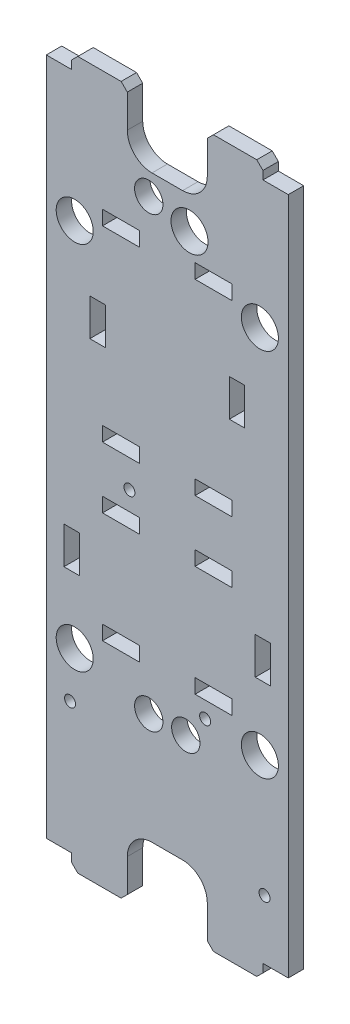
ISO-10303-21;
HEADER;
FILE_DESCRIPTION(('STEP AP214'),'2;1');
FILE_NAME('part.step','',(''),(''),'','','');
FILE_SCHEMA(('AUTOMOTIVE_DESIGN { 1 0 10303 214 1 1 1 1 }'));
ENDSEC;
DATA;
#1=APPLICATION_CONTEXT('core data for automotive mechanical design processes');
#2=APPLICATION_PROTOCOL_DEFINITION('international standard','automotive_design',2000,#1);
#3=PRODUCT_CONTEXT('',#1,'mechanical');
#4=PRODUCT('Part','Part','',(#3));
#5=PRODUCT_RELATED_PRODUCT_CATEGORY('part','',(#4));
#6=PRODUCT_DEFINITION_FORMATION('','',#4);
#7=PRODUCT_DEFINITION_CONTEXT('part definition',#1,'design');
#8=PRODUCT_DEFINITION('design','',#6,#7);
#9=PRODUCT_DEFINITION_SHAPE('','',#8);
#10=(LENGTH_UNIT() NAMED_UNIT(*) SI_UNIT(.MILLI.,.METRE.));
#11=(NAMED_UNIT(*) PLANE_ANGLE_UNIT() SI_UNIT($,.RADIAN.));
#12=(NAMED_UNIT(*) SI_UNIT($,.STERADIAN.) SOLID_ANGLE_UNIT());
#13=UNCERTAINTY_MEASURE_WITH_UNIT(LENGTH_MEASURE(1.E-05),#10,'distance_accuracy_value','');
#14=(GEOMETRIC_REPRESENTATION_CONTEXT(3) GLOBAL_UNCERTAINTY_ASSIGNED_CONTEXT((#13)) GLOBAL_UNIT_ASSIGNED_CONTEXT((#10,
#11,#12)) REPRESENTATION_CONTEXT('',''));
#15=CARTESIAN_POINT('',(0.,0.,0.));
#16=DIRECTION('',(0.,0.,1.));
#17=DIRECTION('',(1.,0.,0.));
#18=AXIS2_PLACEMENT_3D('',#15,#16,#17);
#19=CARTESIAN_POINT('',(-24.892,72.771,3.175));
#20=DIRECTION('',(0.,-1.,0.));
#21=DIRECTION('',(0.,0.,-1.));
#22=AXIS2_PLACEMENT_3D('',#19,#20,#21);
#23=PLANE('',#22);
#24=DIRECTION('',(-1.,0.,0.));
#25=VECTOR('',#24,1.);
#26=CARTESIAN_POINT('',(-24.892,72.771,3.175));
#27=LINE('',#26,#25);
#28=CARTESIAN_POINT('',(-9.49959999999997,72.771,3.175));
#29=VERTEX_POINT('',#28);
#30=CARTESIAN_POINT('',(-18.415,72.771,3.175));
#31=VERTEX_POINT('',#30);
#32=EDGE_CURVE('E1353',#29,#31,#27,.T.);
#33=ORIENTED_EDGE('',*,*,#32,.F.);
#34=DIRECTION('',(0.,0.,-1.));
#35=VECTOR('',#34,1.);
#36=CARTESIAN_POINT('',(-9.49959999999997,72.771,3.175));
#37=LINE('',#36,#35);
#38=CARTESIAN_POINT('',(-9.49959999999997,72.771,0.));
#39=VERTEX_POINT('',#38);
#40=EDGE_CURVE('E1412',#29,#39,#37,.T.);
#41=ORIENTED_EDGE('',*,*,#40,.T.);
#42=DIRECTION('',(-1.,0.,0.));
#43=VECTOR('',#42,1.);
#44=CARTESIAN_POINT('',(-24.892,72.771,0.));
#45=LINE('',#44,#43);
#46=CARTESIAN_POINT('',(-18.415,72.771,0.));
#47=VERTEX_POINT('',#46);
#48=EDGE_CURVE('E1371',#39,#47,#45,.T.);
#49=ORIENTED_EDGE('',*,*,#48,.T.);
#50=DIRECTION('',(0.,0.,1.));
#51=VECTOR('',#50,1.);
#52=CARTESIAN_POINT('',(-18.415,72.771,3.175));
#53=LINE('',#52,#51);
#54=EDGE_CURVE('E1408',#47,#31,#53,.T.);
#55=ORIENTED_EDGE('',*,*,#54,.T.);
#56=EDGE_LOOP('',(#33,#41,#49,#55));
#57=FACE_BOUND('',#56,.T.);
#58=ADVANCED_FACE('F44',(#57),#23,.F.);
#59=CARTESIAN_POINT('',(-24.892,-72.771,3.175));
#60=DIRECTION('',(0.,1.,0.));
#61=DIRECTION('',(0.,0.,1.));
#62=AXIS2_PLACEMENT_3D('',#59,#60,#61);
#63=PLANE('',#62);
#64=DIRECTION('',(1.,0.,0.));
#65=VECTOR('',#64,1.);
#66=CARTESIAN_POINT('',(-24.892,-72.771,0.));
#67=LINE('',#66,#65);
#68=CARTESIAN_POINT('',(9.49959999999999,-72.771,0.));
#69=VERTEX_POINT('',#68);
#70=CARTESIAN_POINT('',(18.415,-72.771,0.));
#71=VERTEX_POINT('',#70);
#72=EDGE_CURVE('E1380',#69,#71,#67,.T.);
#73=ORIENTED_EDGE('',*,*,#72,.T.);
#74=DIRECTION('',(0.,0.,1.));
#75=VECTOR('',#74,1.);
#76=CARTESIAN_POINT('',(18.415,-72.771,3.175));
#77=LINE('',#76,#75);
#78=CARTESIAN_POINT('',(18.415,-72.771,3.175));
#79=VERTEX_POINT('',#78);
#80=EDGE_CURVE('E1502',#71,#79,#77,.T.);
#81=ORIENTED_EDGE('',*,*,#80,.T.);
#82=DIRECTION('',(1.,0.,0.));
#83=VECTOR('',#82,1.);
#84=CARTESIAN_POINT('',(-24.892,-72.771,3.175));
#85=LINE('',#84,#83);
#86=CARTESIAN_POINT('',(9.49959999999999,-72.771,3.175));
#87=VERTEX_POINT('',#86);
#88=EDGE_CURVE('E1363',#87,#79,#85,.T.);
#89=ORIENTED_EDGE('',*,*,#88,.F.);
#90=DIRECTION('',(0.,0.,-1.));
#91=VECTOR('',#90,1.);
#92=CARTESIAN_POINT('',(9.49959999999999,-72.771,3.175));
#93=LINE('',#92,#91);
#94=EDGE_CURVE('E1498',#87,#69,#93,.T.);
#95=ORIENTED_EDGE('',*,*,#94,.T.);
#96=EDGE_LOOP('',(#73,#81,#89,#95));
#97=FACE_BOUND('',#96,.T.);
#98=ADVANCED_FACE('F1524',(#97),#63,.F.);
#99=CARTESIAN_POINT('',(24.892,72.771,3.175));
#100=DIRECTION('',(-1.,0.,0.));
#101=DIRECTION('',(0.,-1.,0.));
#102=AXIS2_PLACEMENT_3D('',#99,#100,#101);
#103=PLANE('',#102);
#104=DIRECTION('',(0.,1.,0.));
#105=VECTOR('',#104,1.);
#106=CARTESIAN_POINT('',(24.892,72.771,0.));
#107=LINE('',#106,#105);
#108=CARTESIAN_POINT('',(24.892,-69.7992,0.));
#109=VERTEX_POINT('',#108);
#110=CARTESIAN_POINT('',(24.892,69.7992,0.));
#111=VERTEX_POINT('',#110);
#112=EDGE_CURVE('E1348',#109,#111,#107,.T.);
#113=ORIENTED_EDGE('',*,*,#112,.T.);
#114=DIRECTION('',(0.,0.,1.));
#115=VECTOR('',#114,1.);
#116=CARTESIAN_POINT('',(24.892,69.7992,3.175));
#117=LINE('',#116,#115);
#118=CARTESIAN_POINT('',(24.892,69.7992,3.175));
#119=VERTEX_POINT('',#118);
#120=EDGE_CURVE('E1344',#111,#119,#117,.T.);
#121=ORIENTED_EDGE('',*,*,#120,.T.);
#122=DIRECTION('',(0.,1.,0.));
#123=VECTOR('',#122,1.);
#124=CARTESIAN_POINT('',(24.892,72.771,3.175));
#125=LINE('',#124,#123);
#126=CARTESIAN_POINT('',(24.892,-69.7992,3.175));
#127=VERTEX_POINT('',#126);
#128=EDGE_CURVE('E1349',#127,#119,#125,.T.);
#129=ORIENTED_EDGE('',*,*,#128,.F.);
#130=DIRECTION('',(0.,0.,-1.));
#131=VECTOR('',#130,1.);
#132=CARTESIAN_POINT('',(24.892,-69.7992,3.175));
#133=LINE('',#132,#131);
#134=EDGE_CURVE('E1329',#127,#109,#133,.T.);
#135=ORIENTED_EDGE('',*,*,#134,.T.);
#136=EDGE_LOOP('',(#113,#121,#129,#135));
#137=FACE_BOUND('',#136,.T.);
#138=ADVANCED_FACE('F1873',(#137),#103,.F.);
#139=CARTESIAN_POINT('',(18.415,72.771,0.));
#140=VERTEX_POINT('',#139);
#141=CARTESIAN_POINT('',(9.49959999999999,72.771,0.));
#142=VERTEX_POINT('',#141);
#143=EDGE_CURVE('E1372',#140,#142,#45,.T.);
#144=ORIENTED_EDGE('',*,*,#143,.T.);
#145=DIRECTION('',(0.,0.,1.));
#146=VECTOR('',#145,1.);
#147=CARTESIAN_POINT('',(9.49959999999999,72.771,3.175));
#148=LINE('',#147,#146);
#149=CARTESIAN_POINT('',(9.49959999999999,72.771,3.175));
#150=VERTEX_POINT('',#149);
#151=EDGE_CURVE('E1474',#142,#150,#148,.T.);
#152=ORIENTED_EDGE('',*,*,#151,.T.);
#153=CARTESIAN_POINT('',(18.415,72.771,3.175));
#154=VERTEX_POINT('',#153);
#155=EDGE_CURVE('E1355',#154,#150,#27,.T.);
#156=ORIENTED_EDGE('',*,*,#155,.F.);
#157=DIRECTION('',(0.,0.,-1.));
#158=VECTOR('',#157,1.);
#159=CARTESIAN_POINT('',(18.415,72.771,3.175));
#160=LINE('',#159,#158);
#161=EDGE_CURVE('E1470',#154,#140,#160,.T.);
#162=ORIENTED_EDGE('',*,*,#161,.T.);
#163=EDGE_LOOP('',(#144,#152,#156,#162));
#164=FACE_BOUND('',#163,.T.);
#165=ADVANCED_FACE('F1869',(#164),#23,.F.);
#166=CARTESIAN_POINT('',(-24.892,72.771,3.175));
#167=DIRECTION('',(1.,0.,0.));
#168=DIRECTION('',(0.,1.,0.));
#169=AXIS2_PLACEMENT_3D('',#166,#167,#168);
#170=PLANE('',#169);
#171=DIRECTION('',(0.,-1.,0.));
#172=VECTOR('',#171,1.);
#173=CARTESIAN_POINT('',(-24.892,72.771,3.175));
#174=LINE('',#173,#172);
#175=CARTESIAN_POINT('',(-24.892,69.7992,3.175));
#176=VERTEX_POINT('',#175);
#177=CARTESIAN_POINT('',(-24.892,-69.7992,3.175));
#178=VERTEX_POINT('',#177);
#179=EDGE_CURVE('E1359',#176,#178,#174,.T.);
#180=ORIENTED_EDGE('',*,*,#179,.F.);
#181=DIRECTION('',(0.,0.,-1.));
#182=VECTOR('',#181,1.);
#183=CARTESIAN_POINT('',(-24.892,69.7992,3.175));
#184=LINE('',#183,#182);
#185=CARTESIAN_POINT('',(-24.892,69.7992,0.));
#186=VERTEX_POINT('',#185);
#187=EDGE_CURVE('E1340',#176,#186,#184,.T.);
#188=ORIENTED_EDGE('',*,*,#187,.T.);
#189=DIRECTION('',(0.,-1.,0.));
#190=VECTOR('',#189,1.);
#191=CARTESIAN_POINT('',(-24.892,72.771,0.));
#192=LINE('',#191,#190);
#193=CARTESIAN_POINT('',(-24.892,-69.7992,0.));
#194=VERTEX_POINT('',#193);
#195=EDGE_CURVE('E1376',#186,#194,#192,.T.);
#196=ORIENTED_EDGE('',*,*,#195,.T.);
#197=DIRECTION('',(0.,0.,1.));
#198=VECTOR('',#197,1.);
#199=CARTESIAN_POINT('',(-24.892,-69.7992,3.175));
#200=LINE('',#199,#198);
#201=EDGE_CURVE('E1336',#194,#178,#200,.T.);
#202=ORIENTED_EDGE('',*,*,#201,.T.);
#203=EDGE_LOOP('',(#180,#188,#196,#202));
#204=FACE_BOUND('',#203,.T.);
#205=ADVANCED_FACE('F1768',(#204),#170,.F.);
#206=CARTESIAN_POINT('',(-18.415,-72.771,3.175));
#207=VERTEX_POINT('',#206);
#208=CARTESIAN_POINT('',(-9.49959999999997,-72.771,3.175));
#209=VERTEX_POINT('',#208);
#210=EDGE_CURVE('E1367',#207,#209,#85,.T.);
#211=ORIENTED_EDGE('',*,*,#210,.F.);
#212=DIRECTION('',(0.,0.,-1.));
#213=VECTOR('',#212,1.);
#214=CARTESIAN_POINT('',(-18.415,-72.771,3.175));
#215=LINE('',#214,#213);
#216=CARTESIAN_POINT('',(-18.415,-72.771,0.));
#217=VERTEX_POINT('',#216);
#218=EDGE_CURVE('E1488',#207,#217,#215,.T.);
#219=ORIENTED_EDGE('',*,*,#218,.T.);
#220=CARTESIAN_POINT('',(-9.49959999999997,-72.771,0.));
#221=VERTEX_POINT('',#220);
#222=EDGE_CURVE('E1354',#217,#221,#67,.T.);
#223=ORIENTED_EDGE('',*,*,#222,.T.);
#224=DIRECTION('',(0.,0.,1.));
#225=VECTOR('',#224,1.);
#226=CARTESIAN_POINT('',(-9.49959999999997,-72.771,3.175));
#227=LINE('',#226,#225);
#228=EDGE_CURVE('E1484',#221,#209,#227,.T.);
#229=ORIENTED_EDGE('',*,*,#228,.T.);
#230=EDGE_LOOP('',(#211,#219,#223,#229));
#231=FACE_BOUND('',#230,.T.);
#232=ADVANCED_FACE('F1785',(#231),#63,.F.);
#233=CARTESIAN_POINT('',(0.,0.,3.175));
#234=DIRECTION('',(0.,0.,1.));
#235=DIRECTION('',(1.,0.,0.));
#236=AXIS2_PLACEMENT_3D('',#233,#234,#235);
#237=PLANE('',#236);
#238=DIRECTION('',(0.,1.,0.));
#239=VECTOR('',#238,1.);
#240=CARTESIAN_POINT('',(15.938253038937,23.712841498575,3.175));
#241=LINE('',#240,#239);
#242=CARTESIAN_POINT('',(15.938253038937,23.712841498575,3.175));
#243=VERTEX_POINT('',#242);
#244=CARTESIAN_POINT('',(15.938253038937,31.332841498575,3.175));
#245=VERTEX_POINT('',#244);
#246=EDGE_CURVE('E61',#243,#245,#241,.T.);
#247=ORIENTED_EDGE('',*,*,#246,.F.);
#248=DIRECTION('',(1.,0.,0.));
#249=VECTOR('',#248,1.);
#250=CARTESIAN_POINT('',(12.763253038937,23.712841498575,3.175));
#251=LINE('',#250,#249);
#252=CARTESIAN_POINT('',(12.763253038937,23.712841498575,3.175));
#253=VERTEX_POINT('',#252);
#254=EDGE_CURVE('E647',#253,#243,#251,.T.);
#255=ORIENTED_EDGE('',*,*,#254,.F.);
#256=DIRECTION('',(0.,-1.,0.));
#257=VECTOR('',#256,1.);
#258=CARTESIAN_POINT('',(12.763253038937,23.712841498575,3.175));
#259=LINE('',#258,#257);
#260=CARTESIAN_POINT('',(12.763253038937,31.332841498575,3.175));
#261=VERTEX_POINT('',#260);
#262=EDGE_CURVE('E666',#261,#253,#259,.T.);
#263=ORIENTED_EDGE('',*,*,#262,.F.);
#264=DIRECTION('',(-1.,0.,0.));
#265=VECTOR('',#264,1.);
#266=CARTESIAN_POINT('',(12.763253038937,31.332841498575,3.175));
#267=LINE('',#266,#265);
#268=EDGE_CURVE('E662',#245,#261,#267,.T.);
#269=ORIENTED_EDGE('',*,*,#268,.F.);
#270=EDGE_LOOP('',(#247,#255,#263,#269));
#271=FACE_BOUND('',#270,.T.);
#272=DIRECTION('',(-1.,0.,0.));
#273=VECTOR('',#272,1.);
#274=CARTESIAN_POINT('',(-13.335,9.55597711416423,3.175));
#275=LINE('',#274,#273);
#276=CARTESIAN_POINT('',(-5.715,9.55597711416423,3.175));
#277=VERTEX_POINT('',#276);
#278=CARTESIAN_POINT('',(-13.335,9.55597711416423,3.175));
#279=VERTEX_POINT('',#278);
#280=EDGE_CURVE('E69',#277,#279,#275,.T.);
#281=ORIENTED_EDGE('',*,*,#280,.F.);
#282=DIRECTION('',(0.,1.,0.));
#283=VECTOR('',#282,1.);
#284=CARTESIAN_POINT('',(-5.715,9.55597711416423,3.175));
#285=LINE('',#284,#283);
#286=CARTESIAN_POINT('',(-5.715,6.58417711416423,3.175));
#287=VERTEX_POINT('',#286);
#288=EDGE_CURVE('E603',#287,#277,#285,.T.);
#289=ORIENTED_EDGE('',*,*,#288,.F.);
#290=DIRECTION('',(1.,0.,0.));
#291=VECTOR('',#290,1.);
#292=CARTESIAN_POINT('',(-13.335,6.58417711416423,3.175));
#293=LINE('',#292,#291);
#294=CARTESIAN_POINT('',(-13.335,6.58417711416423,3.175));
#295=VERTEX_POINT('',#294);
#296=EDGE_CURVE('E623',#295,#287,#293,.T.);
#297=ORIENTED_EDGE('',*,*,#296,.F.);
#298=DIRECTION('',(0.,-1.,0.));
#299=VECTOR('',#298,1.);
#300=CARTESIAN_POINT('',(-13.335,9.55597711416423,3.175));
#301=LINE('',#300,#299);
#302=EDGE_CURVE('E618',#279,#295,#301,.T.);
#303=ORIENTED_EDGE('',*,*,#302,.F.);
#304=EDGE_LOOP('',(#281,#289,#297,#303));
#305=FACE_BOUND('',#304,.T.);
#306=DIRECTION('',(-1.,0.,0.));
#307=VECTOR('',#306,1.);
#308=CARTESIAN_POINT('',(13.335,9.55597711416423,3.175));
#309=LINE('',#308,#307);
#310=CARTESIAN_POINT('',(13.335,9.55597711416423,3.175));
#311=VERTEX_POINT('',#310);
#312=CARTESIAN_POINT('',(5.71499999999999,9.55597711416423,3.175));
#313=VERTEX_POINT('',#312);
#314=EDGE_CURVE('E633',#311,#313,#309,.T.);
#315=ORIENTED_EDGE('',*,*,#314,.F.);
#316=DIRECTION('',(0.,1.,0.));
#317=VECTOR('',#316,1.);
#318=CARTESIAN_POINT('',(13.335,9.55597711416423,3.175));
#319=LINE('',#318,#317);
#320=CARTESIAN_POINT('',(13.335,6.58417711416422,3.175));
#321=VERTEX_POINT('',#320);
#322=EDGE_CURVE('E734',#321,#311,#319,.T.);
#323=ORIENTED_EDGE('',*,*,#322,.F.);
#324=DIRECTION('',(1.,0.,0.));
#325=VECTOR('',#324,1.);
#326=CARTESIAN_POINT('',(13.335,6.58417711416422,3.175));
#327=LINE('',#326,#325);
#328=CARTESIAN_POINT('',(5.71499999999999,6.58417711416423,3.175));
#329=VERTEX_POINT('',#328);
#330=EDGE_CURVE('E753',#329,#321,#327,.T.);
#331=ORIENTED_EDGE('',*,*,#330,.F.);
#332=DIRECTION('',(0.,-1.,0.));
#333=VECTOR('',#332,1.);
#334=CARTESIAN_POINT('',(5.71499999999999,9.55597711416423,3.175));
#335=LINE('',#334,#333);
#336=EDGE_CURVE('E749',#313,#329,#335,.T.);
#337=ORIENTED_EDGE('',*,*,#336,.F.);
#338=EDGE_LOOP('',(#315,#323,#331,#337));
#339=FACE_BOUND('',#338,.T.);
#340=DIRECTION('',(0.,1.,0.));
#341=VECTOR('',#340,1.);
#342=CARTESIAN_POINT('',(13.335,45.1159771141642,3.175));
#343=LINE('',#342,#341);
#344=CARTESIAN_POINT('',(13.335,45.1159771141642,3.175));
#345=VERTEX_POINT('',#344);
#346=CARTESIAN_POINT('',(13.335,48.0877771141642,3.175));
#347=VERTEX_POINT('',#346);
#348=EDGE_CURVE('E701',#345,#347,#343,.T.);
#349=ORIENTED_EDGE('',*,*,#348,.F.);
#350=DIRECTION('',(1.,0.,0.));
#351=VECTOR('',#350,1.);
#352=CARTESIAN_POINT('',(13.335,45.1159771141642,3.175));
#353=LINE('',#352,#351);
#354=CARTESIAN_POINT('',(5.71499999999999,45.1159771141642,3.175));
#355=VERTEX_POINT('',#354);
#356=EDGE_CURVE('E688',#355,#345,#353,.T.);
#357=ORIENTED_EDGE('',*,*,#356,.F.);
#358=DIRECTION('',(0.,-1.,0.));
#359=VECTOR('',#358,1.);
#360=CARTESIAN_POINT('',(5.71499999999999,45.1159771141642,3.175));
#361=LINE('',#360,#359);
#362=CARTESIAN_POINT('',(5.71499999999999,48.0877771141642,3.175));
#363=VERTEX_POINT('',#362);
#364=EDGE_CURVE('E709',#363,#355,#361,.T.);
#365=ORIENTED_EDGE('',*,*,#364,.F.);
#366=DIRECTION('',(-1.,0.,0.));
#367=VECTOR('',#366,1.);
#368=CARTESIAN_POINT('',(13.335,48.0877771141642,3.175));
#369=LINE('',#368,#367);
#370=EDGE_CURVE('E704',#347,#363,#369,.T.);
#371=ORIENTED_EDGE('',*,*,#370,.F.);
#372=EDGE_LOOP('',(#349,#357,#365,#371));
#373=FACE_BOUND('',#372,.T.);
#374=DIRECTION('',(0.,1.,0.));
#375=VECTOR('',#374,1.);
#376=CARTESIAN_POINT('',(-12.763253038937,23.712841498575,3.175));
#377=LINE('',#376,#375);
#378=CARTESIAN_POINT('',(-12.763253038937,23.712841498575,3.175));
#379=VERTEX_POINT('',#378);
#380=CARTESIAN_POINT('',(-12.763253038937,31.332841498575,3.175));
#381=VERTEX_POINT('',#380);
#382=EDGE_CURVE('E549',#379,#381,#377,.T.);
#383=ORIENTED_EDGE('',*,*,#382,.F.);
#384=DIRECTION('',(1.,0.,0.));
#385=VECTOR('',#384,1.);
#386=CARTESIAN_POINT('',(-12.763253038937,23.712841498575,3.175));
#387=LINE('',#386,#385);
#388=CARTESIAN_POINT('',(-15.938253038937,23.712841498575,3.175));
#389=VERTEX_POINT('',#388);
#390=EDGE_CURVE('E570',#389,#379,#387,.T.);
#391=ORIENTED_EDGE('',*,*,#390,.F.);
#392=DIRECTION('',(0.,-1.,0.));
#393=VECTOR('',#392,1.);
#394=CARTESIAN_POINT('',(-15.938253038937,23.712841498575,3.175));
#395=LINE('',#394,#393);
#396=CARTESIAN_POINT('',(-15.938253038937,31.332841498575,3.175));
#397=VERTEX_POINT('',#396);
#398=EDGE_CURVE('E575',#397,#389,#395,.T.);
#399=ORIENTED_EDGE('',*,*,#398,.F.);
#400=DIRECTION('',(-1.,0.,0.));
#401=VECTOR('',#400,1.);
#402=CARTESIAN_POINT('',(-12.763253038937,31.332841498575,3.175));
#403=LINE('',#402,#401);
#404=EDGE_CURVE('E584',#381,#397,#403,.T.);
#405=ORIENTED_EDGE('',*,*,#404,.F.);
#406=EDGE_LOOP('',(#383,#391,#399,#405));
#407=FACE_BOUND('',#406,.T.);
#408=DIRECTION('',(0.,-1.,0.));
#409=VECTOR('',#408,1.);
#410=CARTESIAN_POINT('',(-13.335,45.1159771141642,3.175));
#411=LINE('',#410,#409);
#412=CARTESIAN_POINT('',(-13.335,48.0877771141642,3.175));
#413=VERTEX_POINT('',#412);
#414=CARTESIAN_POINT('',(-13.335,45.1159771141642,3.175));
#415=VERTEX_POINT('',#414);
#416=EDGE_CURVE('E719',#413,#415,#411,.T.);
#417=ORIENTED_EDGE('',*,*,#416,.F.);
#418=DIRECTION('',(-1.,0.,0.));
#419=VECTOR('',#418,1.);
#420=CARTESIAN_POINT('',(-13.335,48.0877771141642,3.175));
#421=LINE('',#420,#419);
#422=CARTESIAN_POINT('',(-5.715,48.0877771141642,3.175));
#423=VERTEX_POINT('',#422);
#424=EDGE_CURVE('E776',#423,#413,#421,.T.);
#425=ORIENTED_EDGE('',*,*,#424,.F.);
#426=DIRECTION('',(0.,1.,0.));
#427=VECTOR('',#426,1.);
#428=CARTESIAN_POINT('',(-5.715,45.1159771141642,3.175));
#429=LINE('',#428,#427);
#430=CARTESIAN_POINT('',(-5.715,45.1159771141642,3.175));
#431=VERTEX_POINT('',#430);
#432=EDGE_CURVE('E795',#431,#423,#429,.T.);
#433=ORIENTED_EDGE('',*,*,#432,.F.);
#434=DIRECTION('',(1.,0.,0.));
#435=VECTOR('',#434,1.);
#436=CARTESIAN_POINT('',(-13.335,45.1159771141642,3.175));
#437=LINE('',#436,#435);
#438=EDGE_CURVE('E791',#415,#431,#437,.T.);
#439=ORIENTED_EDGE('',*,*,#438,.F.);
#440=EDGE_LOOP('',(#417,#425,#433,#439));
#441=FACE_BOUND('',#440,.T.);
#442=CARTESIAN_POINT('',(-7.78509999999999,0.850131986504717,3.175));
#443=DIRECTION('',(0.,0.,1.));
#444=DIRECTION('',(1.,0.,0.));
#445=AXIS2_PLACEMENT_3D('',#442,#443,#444);
#446=CIRCLE('',#445,1.13029999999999);
#447=CARTESIAN_POINT('',(-6.65480000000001,0.850131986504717,3.175));
#448=VERTEX_POINT('',#447);
#449=EDGE_CURVE('E805',#448,#448,#446,.T.);
#450=ORIENTED_EDGE('',*,*,#449,.F.);
#451=EDGE_LOOP('',(#450));
#452=FACE_BOUND('',#451,.T.);
#453=CARTESIAN_POINT('',(7.78510000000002,-32.1698680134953,3.175));
#454=DIRECTION('',(0.,0.,1.));
#455=DIRECTION('',(1.,0.,0.));
#456=AXIS2_PLACEMENT_3D('',#453,#454,#455);
#457=CIRCLE('',#456,1.13029999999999);
#458=CARTESIAN_POINT('',(8.9154,-32.1698680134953,3.175));
#459=VERTEX_POINT('',#458);
#460=EDGE_CURVE('E822',#459,#459,#457,.T.);
#461=ORIENTED_EDGE('',*,*,#460,.F.);
#462=EDGE_LOOP('',(#461));
#463=FACE_BOUND('',#462,.T.);
#464=DIRECTION('',(0.,1.,0.));
#465=VECTOR('',#464,1.);
#466=CARTESIAN_POINT('',(-18.0975,-11.9755642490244,3.175));
#467=LINE('',#466,#465);
#468=CARTESIAN_POINT('',(-18.0975,-19.5955642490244,3.175));
#469=VERTEX_POINT('',#468);
#470=CARTESIAN_POINT('',(-18.0975,-11.9755642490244,3.175));
#471=VERTEX_POINT('',#470);
#472=EDGE_CURVE('E849',#469,#471,#467,.T.);
#473=ORIENTED_EDGE('',*,*,#472,.F.);
#474=DIRECTION('',(1.,0.,0.));
#475=VECTOR('',#474,1.);
#476=CARTESIAN_POINT('',(-21.2725,-19.5955642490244,3.175));
#477=LINE('',#476,#475);
#478=CARTESIAN_POINT('',(-21.2725,-19.5955642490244,3.175));
#479=VERTEX_POINT('',#478);
#480=EDGE_CURVE('E836',#479,#469,#477,.T.);
#481=ORIENTED_EDGE('',*,*,#480,.F.);
#482=DIRECTION('',(0.,-1.,0.));
#483=VECTOR('',#482,1.);
#484=CARTESIAN_POINT('',(-21.2725,-11.9755642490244,3.175));
#485=LINE('',#484,#483);
#486=CARTESIAN_POINT('',(-21.2725,-11.9755642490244,3.175));
#487=VERTEX_POINT('',#486);
#488=EDGE_CURVE('E857',#487,#479,#485,.T.);
#489=ORIENTED_EDGE('',*,*,#488,.F.);
#490=DIRECTION('',(-1.,0.,0.));
#491=VECTOR('',#490,1.);
#492=CARTESIAN_POINT('',(-21.2725,-11.9755642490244,3.175));
#493=LINE('',#492,#491);
#494=EDGE_CURVE('E852',#471,#487,#493,.T.);
#495=ORIENTED_EDGE('',*,*,#494,.F.);
#496=EDGE_LOOP('',(#473,#481,#489,#495));
#497=FACE_BOUND('',#496,.T.);
#498=DIRECTION('',(0.,1.,0.));
#499=VECTOR('',#498,1.);
#500=CARTESIAN_POINT('',(13.335,-3.06008227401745,3.175));
#501=LINE('',#500,#499);
#502=CARTESIAN_POINT('',(13.335,-6.03188227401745,3.175));
#503=VERTEX_POINT('',#502);
#504=CARTESIAN_POINT('',(13.335,-3.06008227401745,3.175));
#505=VERTEX_POINT('',#504);
#506=EDGE_CURVE('E830',#503,#505,#501,.T.);
#507=ORIENTED_EDGE('',*,*,#506,.F.);
#508=DIRECTION('',(1.,0.,0.));
#509=VECTOR('',#508,1.);
#510=CARTESIAN_POINT('',(5.71499999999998,-6.03188227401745,3.175));
#511=LINE('',#510,#509);
#512=CARTESIAN_POINT('',(5.71499999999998,-6.03188227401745,3.175));
#513=VERTEX_POINT('',#512);
#514=EDGE_CURVE('E882',#513,#503,#511,.T.);
#515=ORIENTED_EDGE('',*,*,#514,.F.);
#516=DIRECTION('',(0.,-1.,0.));
#517=VECTOR('',#516,1.);
#518=CARTESIAN_POINT('',(5.71499999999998,-3.06008227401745,3.175));
#519=LINE('',#518,#517);
#520=CARTESIAN_POINT('',(5.71499999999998,-3.06008227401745,3.175));
#521=VERTEX_POINT('',#520);
#522=EDGE_CURVE('E901',#521,#513,#519,.T.);
#523=ORIENTED_EDGE('',*,*,#522,.F.);
#524=DIRECTION('',(-1.,0.,0.));
#525=VECTOR('',#524,1.);
#526=CARTESIAN_POINT('',(5.71499999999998,-3.06008227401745,3.175));
#527=LINE('',#526,#525);
#528=EDGE_CURVE('E897',#505,#521,#527,.T.);
#529=ORIENTED_EDGE('',*,*,#528,.F.);
#530=EDGE_LOOP('',(#507,#515,#523,#529));
#531=FACE_BOUND('',#530,.T.);
#532=DIRECTION('',(0.,1.,0.));
#533=VECTOR('',#532,1.);
#534=CARTESIAN_POINT('',(-5.71499999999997,-3.06008227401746,3.175));
#535=LINE('',#534,#533);
#536=CARTESIAN_POINT('',(-5.71499999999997,-6.03188227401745,3.175));
#537=VERTEX_POINT('',#536);
#538=CARTESIAN_POINT('',(-5.71499999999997,-3.06008227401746,3.175));
#539=VERTEX_POINT('',#538);
#540=EDGE_CURVE('E911',#537,#539,#535,.T.);
#541=ORIENTED_EDGE('',*,*,#540,.F.);
#542=DIRECTION('',(1.,0.,0.));
#543=VECTOR('',#542,1.);
#544=CARTESIAN_POINT('',(-13.335,-6.03188227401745,3.175));
#545=LINE('',#544,#543);
#546=CARTESIAN_POINT('',(-13.335,-6.03188227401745,3.175));
#547=VERTEX_POINT('',#546);
#548=EDGE_CURVE('E1058',#547,#537,#545,.T.);
#549=ORIENTED_EDGE('',*,*,#548,.F.);
#550=DIRECTION('',(0.,-1.,0.));
#551=VECTOR('',#550,1.);
#552=CARTESIAN_POINT('',(-13.335,-3.06008227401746,3.175));
#553=LINE('',#552,#551);
#554=CARTESIAN_POINT('',(-13.335,-3.06008227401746,3.175));
#555=VERTEX_POINT('',#554);
#556=EDGE_CURVE('E1077',#555,#547,#553,.T.);
#557=ORIENTED_EDGE('',*,*,#556,.F.);
#558=DIRECTION('',(-1.,0.,0.));
#559=VECTOR('',#558,1.);
#560=CARTESIAN_POINT('',(-13.335,-3.06008227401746,3.175));
#561=LINE('',#560,#559);
#562=EDGE_CURVE('E1073',#539,#555,#561,.T.);
#563=ORIENTED_EDGE('',*,*,#562,.F.);
#564=EDGE_LOOP('',(#541,#549,#557,#563));
#565=FACE_BOUND('',#564,.T.);
#566=DIRECTION('',(0.,1.,0.));
#567=VECTOR('',#566,1.);
#568=CARTESIAN_POINT('',(21.2725,-11.9755642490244,3.175));
#569=LINE('',#568,#567);
#570=CARTESIAN_POINT('',(21.2725,-19.5955642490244,3.175));
#571=VERTEX_POINT('',#570);
#572=CARTESIAN_POINT('',(21.2725,-11.9755642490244,3.175));
#573=VERTEX_POINT('',#572);
#574=EDGE_CURVE('E1027',#571,#573,#569,.T.);
#575=ORIENTED_EDGE('',*,*,#574,.F.);
#576=DIRECTION('',(1.,0.,0.));
#577=VECTOR('',#576,1.);
#578=CARTESIAN_POINT('',(21.2725,-19.5955642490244,3.175));
#579=LINE('',#578,#577);
#580=CARTESIAN_POINT('',(18.0975,-19.5955642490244,3.175));
#581=VERTEX_POINT('',#580);
#582=EDGE_CURVE('E1014',#581,#571,#579,.T.);
#583=ORIENTED_EDGE('',*,*,#582,.F.);
#584=DIRECTION('',(0.,-1.,0.));
#585=VECTOR('',#584,1.);
#586=CARTESIAN_POINT('',(18.0975,-11.9755642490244,3.175));
#587=LINE('',#586,#585);
#588=CARTESIAN_POINT('',(18.0975,-11.9755642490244,3.175));
#589=VERTEX_POINT('',#588);
#590=EDGE_CURVE('E1035',#589,#581,#587,.T.);
#591=ORIENTED_EDGE('',*,*,#590,.F.);
#592=DIRECTION('',(-1.,0.,0.));
#593=VECTOR('',#592,1.);
#594=CARTESIAN_POINT('',(21.2725,-11.9755642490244,3.175));
#595=LINE('',#594,#593);
#596=EDGE_CURVE('E1030',#573,#589,#595,.T.);
#597=ORIENTED_EDGE('',*,*,#596,.F.);
#598=EDGE_LOOP('',(#575,#583,#591,#597));
#599=FACE_BOUND('',#598,.T.);
#600=DIRECTION('',(0.,1.,0.));
#601=VECTOR('',#600,1.);
#602=CARTESIAN_POINT('',(-5.71499999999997,-25.8500771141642,3.175));
#603=LINE('',#602,#601);
#604=CARTESIAN_POINT('',(-5.71499999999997,-28.8218771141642,3.175));
#605=VERTEX_POINT('',#604);
#606=CARTESIAN_POINT('',(-5.71499999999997,-25.8500771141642,3.175));
#607=VERTEX_POINT('',#606);
#608=EDGE_CURVE('E983',#605,#607,#603,.T.);
#609=ORIENTED_EDGE('',*,*,#608,.F.);
#610=DIRECTION('',(1.,0.,0.));
#611=VECTOR('',#610,1.);
#612=CARTESIAN_POINT('',(-13.335,-28.8218771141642,3.175));
#613=LINE('',#612,#611);
#614=CARTESIAN_POINT('',(-13.335,-28.8218771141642,3.175));
#615=VERTEX_POINT('',#614);
#616=EDGE_CURVE('E970',#615,#605,#613,.T.);
#617=ORIENTED_EDGE('',*,*,#616,.F.);
#618=DIRECTION('',(0.,-1.,0.));
#619=VECTOR('',#618,1.);
#620=CARTESIAN_POINT('',(-13.335,-25.8500771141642,3.175));
#621=LINE('',#620,#619);
#622=CARTESIAN_POINT('',(-13.335,-25.8500771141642,3.175));
#623=VERTEX_POINT('',#622);
#624=EDGE_CURVE('E991',#623,#615,#621,.T.);
#625=ORIENTED_EDGE('',*,*,#624,.F.);
#626=DIRECTION('',(-1.,0.,0.));
#627=VECTOR('',#626,1.);
#628=CARTESIAN_POINT('',(-13.335,-25.8500771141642,3.175));
#629=LINE('',#628,#627);
#630=EDGE_CURVE('E986',#607,#623,#629,.T.);
#631=ORIENTED_EDGE('',*,*,#630,.F.);
#632=EDGE_LOOP('',(#609,#617,#625,#631));
#633=FACE_BOUND('',#632,.T.);
#634=DIRECTION('',(0.,1.,0.));
#635=VECTOR('',#634,1.);
#636=CARTESIAN_POINT('',(13.335,-25.8500771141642,3.175));
#637=LINE('',#636,#635);
#638=CARTESIAN_POINT('',(13.335,-28.8218771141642,3.175));
#639=VERTEX_POINT('',#638);
#640=CARTESIAN_POINT('',(13.335,-25.8500771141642,3.175));
#641=VERTEX_POINT('',#640);
#642=EDGE_CURVE('E939',#639,#641,#637,.T.);
#643=ORIENTED_EDGE('',*,*,#642,.F.);
#644=DIRECTION('',(1.,0.,0.));
#645=VECTOR('',#644,1.);
#646=CARTESIAN_POINT('',(5.71500000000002,-28.8218771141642,3.175));
#647=LINE('',#646,#645);
#648=CARTESIAN_POINT('',(5.71500000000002,-28.8218771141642,3.175));
#649=VERTEX_POINT('',#648);
#650=EDGE_CURVE('E926',#649,#639,#647,.T.);
#651=ORIENTED_EDGE('',*,*,#650,.F.);
#652=DIRECTION('',(0.,-1.,0.));
#653=VECTOR('',#652,1.);
#654=CARTESIAN_POINT('',(5.71500000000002,-25.8500771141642,3.175));
#655=LINE('',#654,#653);
#656=CARTESIAN_POINT('',(5.71500000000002,-25.8500771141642,3.175));
#657=VERTEX_POINT('',#656);
#658=EDGE_CURVE('E947',#657,#649,#655,.T.);
#659=ORIENTED_EDGE('',*,*,#658,.F.);
#660=DIRECTION('',(-1.,0.,0.));
#661=VECTOR('',#660,1.);
#662=CARTESIAN_POINT('',(5.71500000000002,-25.8500771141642,3.175));
#663=LINE('',#662,#661);
#664=EDGE_CURVE('E942',#641,#657,#663,.T.);
#665=ORIENTED_EDGE('',*,*,#664,.F.);
#666=EDGE_LOOP('',(#643,#651,#659,#665));
#667=FACE_BOUND('',#666,.T.);
#668=CARTESIAN_POINT('',(-19.05,43.18,3.175));
#669=DIRECTION('',(0.,0.,1.));
#670=DIRECTION('',(1.,0.,0.));
#671=AXIS2_PLACEMENT_3D('',#668,#669,#670);
#672=CIRCLE('',#671,3.81);
#673=CARTESIAN_POINT('',(-15.24,43.18,3.175));
#674=VERTEX_POINT('',#673);
#675=EDGE_CURVE('E1108',#674,#674,#672,.T.);
#676=ORIENTED_EDGE('',*,*,#675,.F.);
#677=EDGE_LOOP('',(#676));
#678=FACE_BOUND('',#677,.T.);
#679=CARTESIAN_POINT('',(19.05,-33.02,3.175));
#680=DIRECTION('',(0.,0.,1.));
#681=DIRECTION('',(1.,0.,0.));
#682=AXIS2_PLACEMENT_3D('',#679,#680,#681);
#683=CIRCLE('',#682,3.81);
#684=CARTESIAN_POINT('',(22.86,-33.02,3.175));
#685=VERTEX_POINT('',#684);
#686=EDGE_CURVE('E1099',#685,#685,#683,.T.);
#687=ORIENTED_EDGE('',*,*,#686,.F.);
#688=EDGE_LOOP('',(#687));
#689=FACE_BOUND('',#688,.T.);
#690=CARTESIAN_POINT('',(-19.05,-33.02,3.175));
#691=DIRECTION('',(0.,0.,1.));
#692=DIRECTION('',(1.,0.,0.));
#693=AXIS2_PLACEMENT_3D('',#690,#691,#692);
#694=CIRCLE('',#693,3.81);
#695=CARTESIAN_POINT('',(-15.24,-33.02,3.175));
#696=VERTEX_POINT('',#695);
#697=EDGE_CURVE('E867',#696,#696,#694,.T.);
#698=ORIENTED_EDGE('',*,*,#697,.F.);
#699=EDGE_LOOP('',(#698));
#700=FACE_BOUND('',#699,.T.);
#701=CARTESIAN_POINT('',(19.05,43.18,3.175));
#702=DIRECTION('',(0.,0.,1.));
#703=DIRECTION('',(1.,0.,0.));
#704=AXIS2_PLACEMENT_3D('',#701,#702,#703);
#705=CIRCLE('',#704,3.81);
#706=CARTESIAN_POINT('',(22.86,43.18,3.175));
#707=VERTEX_POINT('',#706);
#708=EDGE_CURVE('E1107',#707,#707,#705,.T.);
#709=ORIENTED_EDGE('',*,*,#708,.F.);
#710=EDGE_LOOP('',(#709));
#711=FACE_BOUND('',#710,.T.);
#712=CARTESIAN_POINT('',(-3.81,55.118,3.175));
#713=DIRECTION('',(0.,0.,1.));
#714=DIRECTION('',(1.,0.,0.));
#715=AXIS2_PLACEMENT_3D('',#712,#713,#714);
#716=CIRCLE('',#715,2.921);
#717=CARTESIAN_POINT('',(-0.889,55.118,3.175));
#718=VERTEX_POINT('',#717);
#719=EDGE_CURVE('E1140',#718,#718,#716,.T.);
#720=ORIENTED_EDGE('',*,*,#719,.F.);
#721=EDGE_LOOP('',(#720));
#722=FACE_BOUND('',#721,.T.);
#723=CARTESIAN_POINT('',(3.81000000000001,-37.084,3.175));
#724=DIRECTION('',(0.,0.,1.));
#725=DIRECTION('',(1.,0.,0.));
#726=AXIS2_PLACEMENT_3D('',#723,#724,#725);
#727=CIRCLE('',#726,2.921);
#728=CARTESIAN_POINT('',(6.73100000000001,-37.084,3.175));
#729=VERTEX_POINT('',#728);
#730=EDGE_CURVE('E1131',#729,#729,#727,.T.);
#731=ORIENTED_EDGE('',*,*,#730,.F.);
#732=EDGE_LOOP('',(#731));
#733=FACE_BOUND('',#732,.T.);
#734=CARTESIAN_POINT('',(-3.80999999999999,-37.084,3.175));
#735=DIRECTION('',(0.,0.,1.));
#736=DIRECTION('',(1.,0.,0.));
#737=AXIS2_PLACEMENT_3D('',#734,#735,#736);
#738=CIRCLE('',#737,2.921);
#739=CARTESIAN_POINT('',(-0.888999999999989,-37.084,3.175));
#740=VERTEX_POINT('',#739);
#741=EDGE_CURVE('E1123',#740,#740,#738,.T.);
#742=ORIENTED_EDGE('',*,*,#741,.F.);
#743=EDGE_LOOP('',(#742));
#744=FACE_BOUND('',#743,.T.);
#745=CARTESIAN_POINT('',(4.572,53.086,3.175));
#746=DIRECTION('',(0.,0.,1.));
#747=DIRECTION('',(1.,0.,0.));
#748=AXIS2_PLACEMENT_3D('',#745,#746,#747);
#749=CIRCLE('',#748,3.81);
#750=CARTESIAN_POINT('',(8.382,53.086,3.175));
#751=VERTEX_POINT('',#750);
#752=EDGE_CURVE('E1139',#751,#751,#749,.T.);
#753=ORIENTED_EDGE('',*,*,#752,.F.);
#754=EDGE_LOOP('',(#753));
#755=FACE_BOUND('',#754,.T.);
#756=CARTESIAN_POINT('',(-20.005,-42.91600002,3.175));
#757=DIRECTION('',(0.,0.,1.));
#758=DIRECTION('',(1.,0.,0.));
#759=AXIS2_PLACEMENT_3D('',#756,#757,#758);
#760=CIRCLE('',#759,1.1303);
#761=CARTESIAN_POINT('',(-18.8747,-42.91600002,3.175));
#762=VERTEX_POINT('',#761);
#763=EDGE_CURVE('E1155',#762,#762,#760,.T.);
#764=ORIENTED_EDGE('',*,*,#763,.F.);
#765=EDGE_LOOP('',(#764));
#766=FACE_BOUND('',#765,.T.);
#767=CARTESIAN_POINT('',(20.005,-57.526,3.175));
#768=DIRECTION('',(0.,0.,1.));
#769=DIRECTION('',(1.,0.,0.));
#770=AXIS2_PLACEMENT_3D('',#767,#768,#769);
#771=CIRCLE('',#770,1.1303);
#772=CARTESIAN_POINT('',(21.1353,-57.526,3.175));
#773=VERTEX_POINT('',#772);
#774=EDGE_CURVE('E1166',#773,#773,#771,.T.);
#775=ORIENTED_EDGE('',*,*,#774,.F.);
#776=EDGE_LOOP('',(#775));
#777=FACE_BOUND('',#776,.T.);
#778=DIRECTION('',(0.,1.,0.));
#779=VECTOR('',#778,1.);
#780=CARTESIAN_POINT('',(-8.22959999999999,75.7428,3.175));
#781=LINE('',#780,#779);
#782=CARTESIAN_POINT('',(-8.2296,64.7192,3.175));
#783=VERTEX_POINT('',#782);
#784=CARTESIAN_POINT('',(-8.22959999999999,71.501,3.175));
#785=VERTEX_POINT('',#784);
#786=EDGE_CURVE('E1322',#783,#785,#781,.T.);
#787=ORIENTED_EDGE('',*,*,#786,.T.);
#788=DIRECTION('',(0.707106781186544,-0.707106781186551,0.));
#789=VECTOR('',#788,1.);
#790=CARTESIAN_POINT('',(31.6357,31.6356999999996,3.175));
#791=LINE('',#790,#789);
#792=EDGE_CURVE('E1464',#785,#29,#791,.F.);
#793=ORIENTED_EDGE('',*,*,#792,.T.);
#794=ORIENTED_EDGE('',*,*,#32,.T.);
#795=DIRECTION('',(0.707106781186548,0.707106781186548,0.));
#796=VECTOR('',#795,1.);
#797=CARTESIAN_POINT('',(-45.593,45.593,3.175));
#798=LINE('',#797,#796);
#799=CARTESIAN_POINT('',(-19.685,71.501,3.175));
#800=VERTEX_POINT('',#799);
#801=EDGE_CURVE('E1461',#31,#800,#798,.F.);
#802=ORIENTED_EDGE('',*,*,#801,.T.);
#803=DIRECTION('',(0.,-1.,0.));
#804=VECTOR('',#803,1.);
#805=CARTESIAN_POINT('',(-19.685,75.7428,3.175));
#806=LINE('',#805,#804);
#807=CARTESIAN_POINT('',(-19.685,69.7992,3.175));
#808=VERTEX_POINT('',#807);
#809=EDGE_CURVE('E1280',#800,#808,#806,.T.);
#810=ORIENTED_EDGE('',*,*,#809,.T.);
#811=DIRECTION('',(-1.,0.,0.));
#812=VECTOR('',#811,1.);
#813=CARTESIAN_POINT('',(-30.099,69.7992,3.175));
#814=LINE('',#813,#812);
#815=EDGE_CURVE('E1283',#808,#176,#814,.T.);
#816=ORIENTED_EDGE('',*,*,#815,.T.);
#817=ORIENTED_EDGE('',*,*,#179,.T.);
#818=DIRECTION('',(1.,0.,0.));
#819=VECTOR('',#818,1.);
#820=CARTESIAN_POINT('',(-30.099,-69.7992,3.175));
#821=LINE('',#820,#819);
#822=CARTESIAN_POINT('',(-19.685,-69.7992,3.175));
#823=VERTEX_POINT('',#822);
#824=EDGE_CURVE('E1294',#178,#823,#821,.T.);
#825=ORIENTED_EDGE('',*,*,#824,.T.);
#826=DIRECTION('',(0.,-1.,0.));
#827=VECTOR('',#826,1.);
#828=CARTESIAN_POINT('',(-19.685,-75.7428,3.175));
#829=LINE('',#828,#827);
#830=CARTESIAN_POINT('',(-19.685,-71.501,3.175));
#831=VERTEX_POINT('',#830);
#832=EDGE_CURVE('E1298',#823,#831,#829,.T.);
#833=ORIENTED_EDGE('',*,*,#832,.T.);
#834=DIRECTION('',(-0.707106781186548,0.707106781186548,0.));
#835=VECTOR('',#834,1.);
#836=CARTESIAN_POINT('',(-45.593,-45.593,3.175));
#837=LINE('',#836,#835);
#838=EDGE_CURVE('E1452',#831,#207,#837,.F.);
#839=ORIENTED_EDGE('',*,*,#838,.T.);
#840=ORIENTED_EDGE('',*,*,#210,.T.);
#841=DIRECTION('',(-0.707106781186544,-0.707106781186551,0.));
#842=VECTOR('',#841,1.);
#843=CARTESIAN_POINT('',(31.6357,-31.6356999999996,3.175));
#844=LINE('',#843,#842);
#845=CARTESIAN_POINT('',(-8.22959999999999,-71.501,3.175));
#846=VERTEX_POINT('',#845);
#847=EDGE_CURVE('E1449',#209,#846,#844,.F.);
#848=ORIENTED_EDGE('',*,*,#847,.T.);
#849=DIRECTION('',(0.,1.,0.));
#850=VECTOR('',#849,1.);
#851=CARTESIAN_POINT('',(-8.22959999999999,-75.7428,3.175));
#852=LINE('',#851,#850);
#853=CARTESIAN_POINT('',(-8.2296,-64.7192,3.175));
#854=VERTEX_POINT('',#853);
#855=EDGE_CURVE('E1255',#846,#854,#852,.T.);
#856=ORIENTED_EDGE('',*,*,#855,.T.);
#857=CARTESIAN_POINT('',(-3.1496,-64.7192,3.175));
#858=DIRECTION('',(0.,0.,-1.));
#859=DIRECTION('',(1.,0.,0.));
#860=AXIS2_PLACEMENT_3D('',#857,#858,#859);
#861=CIRCLE('',#860,5.08);
#862=CARTESIAN_POINT('',(-3.1496,-59.6392,3.175));
#863=VERTEX_POINT('',#862);
#864=EDGE_CURVE('E1215',#854,#863,#861,.T.);
#865=ORIENTED_EDGE('',*,*,#864,.T.);
#866=DIRECTION('',(1.,0.,0.));
#867=VECTOR('',#866,1.);
#868=CARTESIAN_POINT('',(3.1496,-59.6392,3.175));
#869=LINE('',#868,#867);
#870=CARTESIAN_POINT('',(3.1496,-59.6392,3.175));
#871=VERTEX_POINT('',#870);
#872=EDGE_CURVE('E1219',#863,#871,#869,.T.);
#873=ORIENTED_EDGE('',*,*,#872,.T.);
#874=CARTESIAN_POINT('',(3.1496,-64.7192,3.175));
#875=DIRECTION('',(0.,0.,-1.));
#876=DIRECTION('',(1.,0.,0.));
#877=AXIS2_PLACEMENT_3D('',#874,#875,#876);
#878=CIRCLE('',#877,5.08);
#879=CARTESIAN_POINT('',(8.2296,-64.7192,3.175));
#880=VERTEX_POINT('',#879);
#881=EDGE_CURVE('E1224',#871,#880,#878,.T.);
#882=ORIENTED_EDGE('',*,*,#881,.T.);
#883=DIRECTION('',(0.,-1.,0.));
#884=VECTOR('',#883,1.);
#885=CARTESIAN_POINT('',(8.22960000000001,-75.7428,3.175));
#886=LINE('',#885,#884);
#887=CARTESIAN_POINT('',(8.22960000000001,-71.501,3.175));
#888=VERTEX_POINT('',#887);
#889=EDGE_CURVE('E1251',#880,#888,#886,.T.);
#890=ORIENTED_EDGE('',*,*,#889,.T.);
#891=DIRECTION('',(-0.707106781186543,0.707106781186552,0.));
#892=VECTOR('',#891,1.);
#893=CARTESIAN_POINT('',(-31.6356999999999,-31.6356999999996,3.175));
#894=LINE('',#893,#892);
#895=EDGE_CURVE('E1443',#888,#87,#894,.F.);
#896=ORIENTED_EDGE('',*,*,#895,.T.);
#897=ORIENTED_EDGE('',*,*,#88,.T.);
#898=DIRECTION('',(-0.707106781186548,-0.707106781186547,0.));
#899=VECTOR('',#898,1.);
#900=CARTESIAN_POINT('',(45.593,-45.5930000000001,3.175));
#901=LINE('',#900,#899);
#902=CARTESIAN_POINT('',(19.685,-71.501,3.175));
#903=VERTEX_POINT('',#902);
#904=EDGE_CURVE('E1446',#79,#903,#901,.F.);
#905=ORIENTED_EDGE('',*,*,#904,.T.);
#906=DIRECTION('',(0.,1.,0.));
#907=VECTOR('',#906,1.);
#908=CARTESIAN_POINT('',(19.685,-75.7428,3.175));
#909=LINE('',#908,#907);
#910=CARTESIAN_POINT('',(19.685,-69.7992,3.175));
#911=VERTEX_POINT('',#910);
#912=EDGE_CURVE('E1310',#903,#911,#909,.T.);
#913=ORIENTED_EDGE('',*,*,#912,.T.);
#914=DIRECTION('',(1.,0.,0.));
#915=VECTOR('',#914,1.);
#916=CARTESIAN_POINT('',(30.099,-69.7992,3.175));
#917=LINE('',#916,#915);
#918=EDGE_CURVE('E1313',#911,#127,#917,.T.);
#919=ORIENTED_EDGE('',*,*,#918,.T.);
#920=ORIENTED_EDGE('',*,*,#128,.T.);
#921=DIRECTION('',(-1.,0.,0.));
#922=VECTOR('',#921,1.);
#923=CARTESIAN_POINT('',(30.099,69.7992,3.175));
#924=LINE('',#923,#922);
#925=CARTESIAN_POINT('',(19.685,69.7992,3.175));
#926=VERTEX_POINT('',#925);
#927=EDGE_CURVE('E1266',#119,#926,#924,.T.);
#928=ORIENTED_EDGE('',*,*,#927,.T.);
#929=DIRECTION('',(0.,1.,0.));
#930=VECTOR('',#929,1.);
#931=CARTESIAN_POINT('',(19.685,75.7428,3.175));
#932=LINE('',#931,#930);
#933=CARTESIAN_POINT('',(19.685,71.501,3.175));
#934=VERTEX_POINT('',#933);
#935=EDGE_CURVE('E1262',#926,#934,#932,.T.);
#936=ORIENTED_EDGE('',*,*,#935,.T.);
#937=DIRECTION('',(0.707106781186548,-0.707106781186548,0.));
#938=VECTOR('',#937,1.);
#939=CARTESIAN_POINT('',(45.593,45.593,3.175));
#940=LINE('',#939,#938);
#941=EDGE_CURVE('E1455',#934,#154,#940,.F.);
#942=ORIENTED_EDGE('',*,*,#941,.T.);
#943=ORIENTED_EDGE('',*,*,#155,.T.);
#944=DIRECTION('',(0.707106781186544,0.707106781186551,0.));
#945=VECTOR('',#944,1.);
#946=CARTESIAN_POINT('',(-31.6357,31.6356999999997,3.175));
#947=LINE('',#946,#945);
#948=CARTESIAN_POINT('',(8.22960000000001,71.501,3.175));
#949=VERTEX_POINT('',#948);
#950=EDGE_CURVE('E1458',#150,#949,#947,.F.);
#951=ORIENTED_EDGE('',*,*,#950,.T.);
#952=DIRECTION('',(0.,-1.,0.));
#953=VECTOR('',#952,1.);
#954=CARTESIAN_POINT('',(8.22960000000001,75.7428,3.175));
#955=LINE('',#954,#953);
#956=CARTESIAN_POINT('',(8.2296,64.7192,3.175));
#957=VERTEX_POINT('',#956);
#958=EDGE_CURVE('E1326',#949,#957,#955,.T.);
#959=ORIENTED_EDGE('',*,*,#958,.T.);
#960=CARTESIAN_POINT('',(3.1496,64.7192,3.175));
#961=DIRECTION('',(0.,0.,-1.));
#962=DIRECTION('',(-1.,0.,0.));
#963=AXIS2_PLACEMENT_3D('',#960,#961,#962);
#964=CIRCLE('',#963,5.08);
#965=CARTESIAN_POINT('',(3.1496,59.6392,3.175));
#966=VERTEX_POINT('',#965);
#967=EDGE_CURVE('E1175',#957,#966,#964,.T.);
#968=ORIENTED_EDGE('',*,*,#967,.T.);
#969=DIRECTION('',(-1.,0.,0.));
#970=VECTOR('',#969,1.);
#971=CARTESIAN_POINT('',(3.1496,59.6392,3.175));
#972=LINE('',#971,#970);
#973=CARTESIAN_POINT('',(-3.1496,59.6392,3.175));
#974=VERTEX_POINT('',#973);
#975=EDGE_CURVE('E1179',#966,#974,#972,.T.);
#976=ORIENTED_EDGE('',*,*,#975,.T.);
#977=CARTESIAN_POINT('',(-3.1496,64.7192,3.175));
#978=DIRECTION('',(0.,0.,-1.));
#979=DIRECTION('',(-1.,0.,0.));
#980=AXIS2_PLACEMENT_3D('',#977,#978,#979);
#981=CIRCLE('',#980,5.08);
#982=EDGE_CURVE('E1184',#974,#783,#981,.T.);
#983=ORIENTED_EDGE('',*,*,#982,.T.);
#984=EDGE_LOOP('',(#787,#793,#794,#802,#810,#816,#817,#825,#833,#839,#840,#848,#856,#865,#873,
#882,#890,#896,#897,#905,#913,#919,#920,#928,#936,#942,#943,#951,#959,#968,#976,#983));
#985=FACE_BOUND('',#984,.T.);
#986=ADVANCED_FACE('F1527',(#271,#305,#339,#373,#407,#441,#452,#463,#497,#531,#565,#599,#633,
#667,#678,#689,#700,#711,#722,#733,#744,#755,#766,#777,#985),#237,.T.);
#987=CARTESIAN_POINT('',(0.,0.,0.));
#988=DIRECTION('',(0.,0.,1.));
#989=DIRECTION('',(1.,0.,0.));
#990=AXIS2_PLACEMENT_3D('',#987,#988,#989);
#991=PLANE('',#990);
#992=DIRECTION('',(1.,0.,0.));
#993=VECTOR('',#992,1.);
#994=CARTESIAN_POINT('',(12.763253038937,23.712841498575,0.));
#995=LINE('',#994,#993);
#996=CARTESIAN_POINT('',(12.763253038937,23.712841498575,0.));
#997=VERTEX_POINT('',#996);
#998=CARTESIAN_POINT('',(15.938253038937,23.712841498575,0.));
#999=VERTEX_POINT('',#998);
#1000=EDGE_CURVE('E655',#997,#999,#995,.T.);
#1001=ORIENTED_EDGE('',*,*,#1000,.T.);
#1002=DIRECTION('',(0.,1.,0.));
#1003=VECTOR('',#1002,1.);
#1004=CARTESIAN_POINT('',(15.938253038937,23.712841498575,0.));
#1005=LINE('',#1004,#1003);
#1006=CARTESIAN_POINT('',(15.938253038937,31.332841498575,0.));
#1007=VERTEX_POINT('',#1006);
#1008=EDGE_CURVE('E642',#999,#1007,#1005,.T.);
#1009=ORIENTED_EDGE('',*,*,#1008,.T.);
#1010=DIRECTION('',(-1.,0.,0.));
#1011=VECTOR('',#1010,1.);
#1012=CARTESIAN_POINT('',(12.763253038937,31.332841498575,0.));
#1013=LINE('',#1012,#1011);
#1014=CARTESIAN_POINT('',(12.763253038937,31.332841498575,0.));
#1015=VERTEX_POINT('',#1014);
#1016=EDGE_CURVE('E646',#1007,#1015,#1013,.T.);
#1017=ORIENTED_EDGE('',*,*,#1016,.T.);
#1018=DIRECTION('',(0.,-1.,0.));
#1019=VECTOR('',#1018,1.);
#1020=CARTESIAN_POINT('',(12.763253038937,23.712841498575,0.));
#1021=LINE('',#1020,#1019);
#1022=EDGE_CURVE('E651',#1015,#997,#1021,.T.);
#1023=ORIENTED_EDGE('',*,*,#1022,.T.);
#1024=EDGE_LOOP('',(#1001,#1009,#1017,#1023));
#1025=FACE_BOUND('',#1024,.T.);
#1026=DIRECTION('',(0.,1.,0.));
#1027=VECTOR('',#1026,1.);
#1028=CARTESIAN_POINT('',(-5.715,9.55597711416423,0.));
#1029=LINE('',#1028,#1027);
#1030=CARTESIAN_POINT('',(-5.715,6.58417711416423,0.));
#1031=VERTEX_POINT('',#1030);
#1032=CARTESIAN_POINT('',(-5.715,9.55597711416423,0.));
#1033=VERTEX_POINT('',#1032);
#1034=EDGE_CURVE('E611',#1031,#1033,#1029,.T.);
#1035=ORIENTED_EDGE('',*,*,#1034,.T.);
#1036=DIRECTION('',(-1.,0.,0.));
#1037=VECTOR('',#1036,1.);
#1038=CARTESIAN_POINT('',(-13.335,9.55597711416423,0.));
#1039=LINE('',#1038,#1037);
#1040=CARTESIAN_POINT('',(-13.335,9.55597711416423,0.));
#1041=VERTEX_POINT('',#1040);
#1042=EDGE_CURVE('E598',#1033,#1041,#1039,.T.);
#1043=ORIENTED_EDGE('',*,*,#1042,.T.);
#1044=DIRECTION('',(0.,-1.,0.));
#1045=VECTOR('',#1044,1.);
#1046=CARTESIAN_POINT('',(-13.335,9.55597711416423,0.));
#1047=LINE('',#1046,#1045);
#1048=CARTESIAN_POINT('',(-13.335,6.58417711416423,0.));
#1049=VERTEX_POINT('',#1048);
#1050=EDGE_CURVE('E602',#1041,#1049,#1047,.T.);
#1051=ORIENTED_EDGE('',*,*,#1050,.T.);
#1052=DIRECTION('',(1.,0.,0.));
#1053=VECTOR('',#1052,1.);
#1054=CARTESIAN_POINT('',(-13.335,6.58417711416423,0.));
#1055=LINE('',#1054,#1053);
#1056=EDGE_CURVE('E607',#1049,#1031,#1055,.T.);
#1057=ORIENTED_EDGE('',*,*,#1056,.T.);
#1058=EDGE_LOOP('',(#1035,#1043,#1051,#1057));
#1059=FACE_BOUND('',#1058,.T.);
#1060=DIRECTION('',(0.,1.,0.));
#1061=VECTOR('',#1060,1.);
#1062=CARTESIAN_POINT('',(13.335,9.55597711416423,0.));
#1063=LINE('',#1062,#1061);
#1064=CARTESIAN_POINT('',(13.335,6.58417711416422,0.));
#1065=VERTEX_POINT('',#1064);
#1066=CARTESIAN_POINT('',(13.335,9.55597711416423,0.));
#1067=VERTEX_POINT('',#1066);
#1068=EDGE_CURVE('E742',#1065,#1067,#1063,.T.);
#1069=ORIENTED_EDGE('',*,*,#1068,.T.);
#1070=DIRECTION('',(-1.,0.,0.));
#1071=VECTOR('',#1070,1.);
#1072=CARTESIAN_POINT('',(13.335,9.55597711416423,0.));
#1073=LINE('',#1072,#1071);
#1074=CARTESIAN_POINT('',(5.71499999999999,9.55597711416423,0.));
#1075=VERTEX_POINT('',#1074);
#1076=EDGE_CURVE('E729',#1067,#1075,#1073,.T.);
#1077=ORIENTED_EDGE('',*,*,#1076,.T.);
#1078=DIRECTION('',(0.,-1.,0.));
#1079=VECTOR('',#1078,1.);
#1080=CARTESIAN_POINT('',(5.71499999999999,9.55597711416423,0.));
#1081=LINE('',#1080,#1079);
#1082=CARTESIAN_POINT('',(5.71499999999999,6.58417711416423,0.));
#1083=VERTEX_POINT('',#1082);
#1084=EDGE_CURVE('E733',#1075,#1083,#1081,.T.);
#1085=ORIENTED_EDGE('',*,*,#1084,.T.);
#1086=DIRECTION('',(1.,0.,0.));
#1087=VECTOR('',#1086,1.);
#1088=CARTESIAN_POINT('',(13.335,6.58417711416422,0.));
#1089=LINE('',#1088,#1087);
#1090=EDGE_CURVE('E738',#1083,#1065,#1089,.T.);
#1091=ORIENTED_EDGE('',*,*,#1090,.T.);
#1092=EDGE_LOOP('',(#1069,#1077,#1085,#1091));
#1093=FACE_BOUND('',#1092,.T.);
#1094=DIRECTION('',(1.,0.,0.));
#1095=VECTOR('',#1094,1.);
#1096=CARTESIAN_POINT('',(13.335,45.1159771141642,0.));
#1097=LINE('',#1096,#1095);
#1098=CARTESIAN_POINT('',(5.71499999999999,45.1159771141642,0.));
#1099=VERTEX_POINT('',#1098);
#1100=CARTESIAN_POINT('',(13.335,45.1159771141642,0.));
#1101=VERTEX_POINT('',#1100);
#1102=EDGE_CURVE('E696',#1099,#1101,#1097,.T.);
#1103=ORIENTED_EDGE('',*,*,#1102,.T.);
#1104=DIRECTION('',(0.,1.,0.));
#1105=VECTOR('',#1104,1.);
#1106=CARTESIAN_POINT('',(13.335,45.1159771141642,0.));
#1107=LINE('',#1106,#1105);
#1108=CARTESIAN_POINT('',(13.335,48.0877771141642,0.));
#1109=VERTEX_POINT('',#1108);
#1110=EDGE_CURVE('E683',#1101,#1109,#1107,.T.);
#1111=ORIENTED_EDGE('',*,*,#1110,.T.);
#1112=DIRECTION('',(-1.,0.,0.));
#1113=VECTOR('',#1112,1.);
#1114=CARTESIAN_POINT('',(13.335,48.0877771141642,0.));
#1115=LINE('',#1114,#1113);
#1116=CARTESIAN_POINT('',(5.71499999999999,48.0877771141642,0.));
#1117=VERTEX_POINT('',#1116);
#1118=EDGE_CURVE('E687',#1109,#1117,#1115,.T.);
#1119=ORIENTED_EDGE('',*,*,#1118,.T.);
#1120=DIRECTION('',(0.,-1.,0.));
#1121=VECTOR('',#1120,1.);
#1122=CARTESIAN_POINT('',(5.71499999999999,45.1159771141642,0.));
#1123=LINE('',#1122,#1121);
#1124=EDGE_CURVE('E692',#1117,#1099,#1123,.T.);
#1125=ORIENTED_EDGE('',*,*,#1124,.T.);
#1126=EDGE_LOOP('',(#1103,#1111,#1119,#1125));
#1127=FACE_BOUND('',#1126,.T.);
#1128=DIRECTION('',(1.,0.,0.));
#1129=VECTOR('',#1128,1.);
#1130=CARTESIAN_POINT('',(-12.763253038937,23.712841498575,0.));
#1131=LINE('',#1130,#1129);
#1132=CARTESIAN_POINT('',(-15.938253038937,23.712841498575,0.));
#1133=VERTEX_POINT('',#1132);
#1134=CARTESIAN_POINT('',(-12.763253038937,23.712841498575,0.));
#1135=VERTEX_POINT('',#1134);
#1136=EDGE_CURVE('E555',#1133,#1135,#1131,.T.);
#1137=ORIENTED_EDGE('',*,*,#1136,.T.);
#1138=DIRECTION('',(0.,1.,0.));
#1139=VECTOR('',#1138,1.);
#1140=CARTESIAN_POINT('',(-12.763253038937,23.712841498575,0.));
#1141=LINE('',#1140,#1139);
#1142=CARTESIAN_POINT('',(-12.763253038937,31.332841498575,0.));
#1143=VERTEX_POINT('',#1142);
#1144=EDGE_CURVE('E546',#1135,#1143,#1141,.T.);
#1145=ORIENTED_EDGE('',*,*,#1144,.T.);
#1146=DIRECTION('',(-1.,0.,0.));
#1147=VECTOR('',#1146,1.);
#1148=CARTESIAN_POINT('',(-12.763253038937,31.332841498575,0.));
#1149=LINE('',#1148,#1147);
#1150=CARTESIAN_POINT('',(-15.938253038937,31.332841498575,0.));
#1151=VERTEX_POINT('',#1150);
#1152=EDGE_CURVE('E559',#1143,#1151,#1149,.T.);
#1153=ORIENTED_EDGE('',*,*,#1152,.T.);
#1154=DIRECTION('',(0.,-1.,0.));
#1155=VECTOR('',#1154,1.);
#1156=CARTESIAN_POINT('',(-15.938253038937,23.712841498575,0.));
#1157=LINE('',#1156,#1155);
#1158=EDGE_CURVE('E564',#1151,#1133,#1157,.T.);
#1159=ORIENTED_EDGE('',*,*,#1158,.T.);
#1160=EDGE_LOOP('',(#1137,#1145,#1153,#1159));
#1161=FACE_BOUND('',#1160,.T.);
#1162=DIRECTION('',(-1.,0.,0.));
#1163=VECTOR('',#1162,1.);
#1164=CARTESIAN_POINT('',(-13.335,48.0877771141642,0.));
#1165=LINE('',#1164,#1163);
#1166=CARTESIAN_POINT('',(-5.715,48.0877771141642,0.));
#1167=VERTEX_POINT('',#1166);
#1168=CARTESIAN_POINT('',(-13.335,48.0877771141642,0.));
#1169=VERTEX_POINT('',#1168);
#1170=EDGE_CURVE('E784',#1167,#1169,#1165,.T.);
#1171=ORIENTED_EDGE('',*,*,#1170,.T.);
#1172=DIRECTION('',(0.,-1.,0.));
#1173=VECTOR('',#1172,1.);
#1174=CARTESIAN_POINT('',(-13.335,45.1159771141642,0.));
#1175=LINE('',#1174,#1173);
#1176=CARTESIAN_POINT('',(-13.335,45.1159771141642,0.));
#1177=VERTEX_POINT('',#1176);
#1178=EDGE_CURVE('E771',#1169,#1177,#1175,.T.);
#1179=ORIENTED_EDGE('',*,*,#1178,.T.);
#1180=DIRECTION('',(1.,0.,0.));
#1181=VECTOR('',#1180,1.);
#1182=CARTESIAN_POINT('',(-13.335,45.1159771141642,0.));
#1183=LINE('',#1182,#1181);
#1184=CARTESIAN_POINT('',(-5.715,45.1159771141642,0.));
#1185=VERTEX_POINT('',#1184);
#1186=EDGE_CURVE('E775',#1177,#1185,#1183,.T.);
#1187=ORIENTED_EDGE('',*,*,#1186,.T.);
#1188=DIRECTION('',(0.,1.,0.));
#1189=VECTOR('',#1188,1.);
#1190=CARTESIAN_POINT('',(-5.715,45.1159771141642,0.));
#1191=LINE('',#1190,#1189);
#1192=EDGE_CURVE('E780',#1185,#1167,#1191,.T.);
#1193=ORIENTED_EDGE('',*,*,#1192,.T.);
#1194=EDGE_LOOP('',(#1171,#1179,#1187,#1193));
#1195=FACE_BOUND('',#1194,.T.);
#1196=CARTESIAN_POINT('',(-7.78509999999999,0.850131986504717,0.));
#1197=DIRECTION('',(0.,0.,1.));
#1198=DIRECTION('',(1.,0.,0.));
#1199=AXIS2_PLACEMENT_3D('',#1196,#1197,#1198);
#1200=CIRCLE('',#1199,1.1303);
#1201=CARTESIAN_POINT('',(-6.65479999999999,0.850131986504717,0.));
#1202=VERTEX_POINT('',#1201);
#1203=EDGE_CURVE('E818',#1202,#1202,#1200,.T.);
#1204=ORIENTED_EDGE('',*,*,#1203,.T.);
#1205=EDGE_LOOP('',(#1204));
#1206=FACE_BOUND('',#1205,.T.);
#1207=CARTESIAN_POINT('',(7.78510000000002,-32.1698680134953,0.));
#1208=DIRECTION('',(0.,0.,1.));
#1209=DIRECTION('',(1.,0.,0.));
#1210=AXIS2_PLACEMENT_3D('',#1207,#1208,#1209);
#1211=CIRCLE('',#1210,1.1303);
#1212=CARTESIAN_POINT('',(8.91540000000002,-32.1698680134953,0.));
#1213=VERTEX_POINT('',#1212);
#1214=EDGE_CURVE('E826',#1213,#1213,#1211,.T.);
#1215=ORIENTED_EDGE('',*,*,#1214,.T.);
#1216=EDGE_LOOP('',(#1215));
#1217=FACE_BOUND('',#1216,.T.);
#1218=DIRECTION('',(1.,0.,0.));
#1219=VECTOR('',#1218,1.);
#1220=CARTESIAN_POINT('',(-21.2725,-19.5955642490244,0.));
#1221=LINE('',#1220,#1219);
#1222=CARTESIAN_POINT('',(-21.2725,-19.5955642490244,0.));
#1223=VERTEX_POINT('',#1222);
#1224=CARTESIAN_POINT('',(-18.0975,-19.5955642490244,0.));
#1225=VERTEX_POINT('',#1224);
#1226=EDGE_CURVE('E844',#1223,#1225,#1221,.T.);
#1227=ORIENTED_EDGE('',*,*,#1226,.T.);
#1228=DIRECTION('',(0.,1.,0.));
#1229=VECTOR('',#1228,1.);
#1230=CARTESIAN_POINT('',(-18.0975,-11.9755642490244,0.));
#1231=LINE('',#1230,#1229);
#1232=CARTESIAN_POINT('',(-18.0975,-11.9755642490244,0.));
#1233=VERTEX_POINT('',#1232);
#1234=EDGE_CURVE('E831',#1225,#1233,#1231,.T.);
#1235=ORIENTED_EDGE('',*,*,#1234,.T.);
#1236=DIRECTION('',(-1.,0.,0.));
#1237=VECTOR('',#1236,1.);
#1238=CARTESIAN_POINT('',(-21.2725,-11.9755642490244,0.));
#1239=LINE('',#1238,#1237);
#1240=CARTESIAN_POINT('',(-21.2725,-11.9755642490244,0.));
#1241=VERTEX_POINT('',#1240);
#1242=EDGE_CURVE('E835',#1233,#1241,#1239,.T.);
#1243=ORIENTED_EDGE('',*,*,#1242,.T.);
#1244=DIRECTION('',(0.,-1.,0.));
#1245=VECTOR('',#1244,1.);
#1246=CARTESIAN_POINT('',(-21.2725,-11.9755642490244,0.));
#1247=LINE('',#1246,#1245);
#1248=EDGE_CURVE('E840',#1241,#1223,#1247,.T.);
#1249=ORIENTED_EDGE('',*,*,#1248,.T.);
#1250=EDGE_LOOP('',(#1227,#1235,#1243,#1249));
#1251=FACE_BOUND('',#1250,.T.);
#1252=DIRECTION('',(1.,0.,0.));
#1253=VECTOR('',#1252,1.);
#1254=CARTESIAN_POINT('',(5.71499999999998,-6.03188227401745,0.));
#1255=LINE('',#1254,#1253);
#1256=CARTESIAN_POINT('',(5.71499999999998,-6.03188227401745,0.));
#1257=VERTEX_POINT('',#1256);
#1258=CARTESIAN_POINT('',(13.335,-6.03188227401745,0.));
#1259=VERTEX_POINT('',#1258);
#1260=EDGE_CURVE('E890',#1257,#1259,#1255,.T.);
#1261=ORIENTED_EDGE('',*,*,#1260,.T.);
#1262=DIRECTION('',(0.,1.,0.));
#1263=VECTOR('',#1262,1.);
#1264=CARTESIAN_POINT('',(13.335,-3.06008227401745,0.));
#1265=LINE('',#1264,#1263);
#1266=CARTESIAN_POINT('',(13.335,-3.06008227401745,0.));
#1267=VERTEX_POINT('',#1266);
#1268=EDGE_CURVE('E877',#1259,#1267,#1265,.T.);
#1269=ORIENTED_EDGE('',*,*,#1268,.T.);
#1270=DIRECTION('',(-1.,0.,0.));
#1271=VECTOR('',#1270,1.);
#1272=CARTESIAN_POINT('',(5.71499999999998,-3.06008227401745,0.));
#1273=LINE('',#1272,#1271);
#1274=CARTESIAN_POINT('',(5.71499999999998,-3.06008227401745,0.));
#1275=VERTEX_POINT('',#1274);
#1276=EDGE_CURVE('E881',#1267,#1275,#1273,.T.);
#1277=ORIENTED_EDGE('',*,*,#1276,.T.);
#1278=DIRECTION('',(0.,-1.,0.));
#1279=VECTOR('',#1278,1.);
#1280=CARTESIAN_POINT('',(5.71499999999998,-3.06008227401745,0.));
#1281=LINE('',#1280,#1279);
#1282=EDGE_CURVE('E886',#1275,#1257,#1281,.T.);
#1283=ORIENTED_EDGE('',*,*,#1282,.T.);
#1284=EDGE_LOOP('',(#1261,#1269,#1277,#1283));
#1285=FACE_BOUND('',#1284,.T.);
#1286=DIRECTION('',(1.,0.,0.));
#1287=VECTOR('',#1286,1.);
#1288=CARTESIAN_POINT('',(-13.335,-6.03188227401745,0.));
#1289=LINE('',#1288,#1287);
#1290=CARTESIAN_POINT('',(-13.335,-6.03188227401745,0.));
#1291=VERTEX_POINT('',#1290);
#1292=CARTESIAN_POINT('',(-5.71499999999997,-6.03188227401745,0.));
#1293=VERTEX_POINT('',#1292);
#1294=EDGE_CURVE('E1066',#1291,#1293,#1289,.T.);
#1295=ORIENTED_EDGE('',*,*,#1294,.T.);
#1296=DIRECTION('',(0.,1.,0.));
#1297=VECTOR('',#1296,1.);
#1298=CARTESIAN_POINT('',(-5.71499999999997,-3.06008227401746,0.));
#1299=LINE('',#1298,#1297);
#1300=CARTESIAN_POINT('',(-5.71499999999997,-3.06008227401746,0.));
#1301=VERTEX_POINT('',#1300);
#1302=EDGE_CURVE('E1053',#1293,#1301,#1299,.T.);
#1303=ORIENTED_EDGE('',*,*,#1302,.T.);
#1304=DIRECTION('',(-1.,0.,0.));
#1305=VECTOR('',#1304,1.);
#1306=CARTESIAN_POINT('',(-13.335,-3.06008227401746,0.));
#1307=LINE('',#1306,#1305);
#1308=CARTESIAN_POINT('',(-13.335,-3.06008227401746,0.));
#1309=VERTEX_POINT('',#1308);
#1310=EDGE_CURVE('E1057',#1301,#1309,#1307,.T.);
#1311=ORIENTED_EDGE('',*,*,#1310,.T.);
#1312=DIRECTION('',(0.,-1.,0.));
#1313=VECTOR('',#1312,1.);
#1314=CARTESIAN_POINT('',(-13.335,-3.06008227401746,0.));
#1315=LINE('',#1314,#1313);
#1316=EDGE_CURVE('E1062',#1309,#1291,#1315,.T.);
#1317=ORIENTED_EDGE('',*,*,#1316,.T.);
#1318=EDGE_LOOP('',(#1295,#1303,#1311,#1317));
#1319=FACE_BOUND('',#1318,.T.);
#1320=DIRECTION('',(1.,0.,0.));
#1321=VECTOR('',#1320,1.);
#1322=CARTESIAN_POINT('',(21.2725,-19.5955642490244,0.));
#1323=LINE('',#1322,#1321);
#1324=CARTESIAN_POINT('',(18.0975,-19.5955642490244,0.));
#1325=VERTEX_POINT('',#1324);
#1326=CARTESIAN_POINT('',(21.2725,-19.5955642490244,0.));
#1327=VERTEX_POINT('',#1326);
#1328=EDGE_CURVE('E1022',#1325,#1327,#1323,.T.);
#1329=ORIENTED_EDGE('',*,*,#1328,.T.);
#1330=DIRECTION('',(0.,1.,0.));
#1331=VECTOR('',#1330,1.);
#1332=CARTESIAN_POINT('',(21.2725,-11.9755642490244,0.));
#1333=LINE('',#1332,#1331);
#1334=CARTESIAN_POINT('',(21.2725,-11.9755642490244,0.));
#1335=VERTEX_POINT('',#1334);
#1336=EDGE_CURVE('E1009',#1327,#1335,#1333,.T.);
#1337=ORIENTED_EDGE('',*,*,#1336,.T.);
#1338=DIRECTION('',(-1.,0.,0.));
#1339=VECTOR('',#1338,1.);
#1340=CARTESIAN_POINT('',(21.2725,-11.9755642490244,0.));
#1341=LINE('',#1340,#1339);
#1342=CARTESIAN_POINT('',(18.0975,-11.9755642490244,0.));
#1343=VERTEX_POINT('',#1342);
#1344=EDGE_CURVE('E1013',#1335,#1343,#1341,.T.);
#1345=ORIENTED_EDGE('',*,*,#1344,.T.);
#1346=DIRECTION('',(0.,-1.,0.));
#1347=VECTOR('',#1346,1.);
#1348=CARTESIAN_POINT('',(18.0975,-11.9755642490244,0.));
#1349=LINE('',#1348,#1347);
#1350=EDGE_CURVE('E1018',#1343,#1325,#1349,.T.);
#1351=ORIENTED_EDGE('',*,*,#1350,.T.);
#1352=EDGE_LOOP('',(#1329,#1337,#1345,#1351));
#1353=FACE_BOUND('',#1352,.T.);
#1354=DIRECTION('',(1.,0.,0.));
#1355=VECTOR('',#1354,1.);
#1356=CARTESIAN_POINT('',(-13.335,-28.8218771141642,0.));
#1357=LINE('',#1356,#1355);
#1358=CARTESIAN_POINT('',(-13.335,-28.8218771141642,0.));
#1359=VERTEX_POINT('',#1358);
#1360=CARTESIAN_POINT('',(-5.71499999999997,-28.8218771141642,0.));
#1361=VERTEX_POINT('',#1360);
#1362=EDGE_CURVE('E978',#1359,#1361,#1357,.T.);
#1363=ORIENTED_EDGE('',*,*,#1362,.T.);
#1364=DIRECTION('',(0.,1.,0.));
#1365=VECTOR('',#1364,1.);
#1366=CARTESIAN_POINT('',(-5.71499999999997,-25.8500771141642,0.));
#1367=LINE('',#1366,#1365);
#1368=CARTESIAN_POINT('',(-5.71499999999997,-25.8500771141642,0.));
#1369=VERTEX_POINT('',#1368);
#1370=EDGE_CURVE('E965',#1361,#1369,#1367,.T.);
#1371=ORIENTED_EDGE('',*,*,#1370,.T.);
#1372=DIRECTION('',(-1.,0.,0.));
#1373=VECTOR('',#1372,1.);
#1374=CARTESIAN_POINT('',(-13.335,-25.8500771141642,0.));
#1375=LINE('',#1374,#1373);
#1376=CARTESIAN_POINT('',(-13.335,-25.8500771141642,0.));
#1377=VERTEX_POINT('',#1376);
#1378=EDGE_CURVE('E969',#1369,#1377,#1375,.T.);
#1379=ORIENTED_EDGE('',*,*,#1378,.T.);
#1380=DIRECTION('',(0.,-1.,0.));
#1381=VECTOR('',#1380,1.);
#1382=CARTESIAN_POINT('',(-13.335,-25.8500771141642,0.));
#1383=LINE('',#1382,#1381);
#1384=EDGE_CURVE('E974',#1377,#1359,#1383,.T.);
#1385=ORIENTED_EDGE('',*,*,#1384,.T.);
#1386=EDGE_LOOP('',(#1363,#1371,#1379,#1385));
#1387=FACE_BOUND('',#1386,.T.);
#1388=DIRECTION('',(1.,0.,0.));
#1389=VECTOR('',#1388,1.);
#1390=CARTESIAN_POINT('',(5.71500000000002,-28.8218771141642,0.));
#1391=LINE('',#1390,#1389);
#1392=CARTESIAN_POINT('',(5.71500000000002,-28.8218771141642,0.));
#1393=VERTEX_POINT('',#1392);
#1394=CARTESIAN_POINT('',(13.335,-28.8218771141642,0.));
#1395=VERTEX_POINT('',#1394);
#1396=EDGE_CURVE('E934',#1393,#1395,#1391,.T.);
#1397=ORIENTED_EDGE('',*,*,#1396,.T.);
#1398=DIRECTION('',(0.,1.,0.));
#1399=VECTOR('',#1398,1.);
#1400=CARTESIAN_POINT('',(13.335,-25.8500771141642,0.));
#1401=LINE('',#1400,#1399);
#1402=CARTESIAN_POINT('',(13.335,-25.8500771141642,0.));
#1403=VERTEX_POINT('',#1402);
#1404=EDGE_CURVE('E921',#1395,#1403,#1401,.T.);
#1405=ORIENTED_EDGE('',*,*,#1404,.T.);
#1406=DIRECTION('',(-1.,0.,0.));
#1407=VECTOR('',#1406,1.);
#1408=CARTESIAN_POINT('',(5.71500000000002,-25.8500771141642,0.));
#1409=LINE('',#1408,#1407);
#1410=CARTESIAN_POINT('',(5.71500000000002,-25.8500771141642,0.));
#1411=VERTEX_POINT('',#1410);
#1412=EDGE_CURVE('E925',#1403,#1411,#1409,.T.);
#1413=ORIENTED_EDGE('',*,*,#1412,.T.);
#1414=DIRECTION('',(0.,-1.,0.));
#1415=VECTOR('',#1414,1.);
#1416=CARTESIAN_POINT('',(5.71500000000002,-25.8500771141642,0.));
#1417=LINE('',#1416,#1415);
#1418=EDGE_CURVE('E930',#1411,#1393,#1417,.T.);
#1419=ORIENTED_EDGE('',*,*,#1418,.T.);
#1420=EDGE_LOOP('',(#1397,#1405,#1413,#1419));
#1421=FACE_BOUND('',#1420,.T.);
#1422=CARTESIAN_POINT('',(-19.05,43.18,0.));
#1423=DIRECTION('',(0.,0.,1.));
#1424=DIRECTION('',(1.,0.,0.));
#1425=AXIS2_PLACEMENT_3D('',#1422,#1423,#1424);
#1426=CIRCLE('',#1425,3.81);
#1427=CARTESIAN_POINT('',(-15.24,43.18,0.));
#1428=VERTEX_POINT('',#1427);
#1429=EDGE_CURVE('E1103',#1428,#1428,#1426,.T.);
#1430=ORIENTED_EDGE('',*,*,#1429,.T.);
#1431=EDGE_LOOP('',(#1430));
#1432=FACE_BOUND('',#1431,.T.);
#1433=CARTESIAN_POINT('',(19.05,-33.02,0.));
#1434=DIRECTION('',(0.,0.,1.));
#1435=DIRECTION('',(1.,0.,0.));
#1436=AXIS2_PLACEMENT_3D('',#1433,#1434,#1435);
#1437=CIRCLE('',#1436,3.81);
#1438=CARTESIAN_POINT('',(22.86,-33.02,0.));
#1439=VERTEX_POINT('',#1438);
#1440=EDGE_CURVE('E1112',#1439,#1439,#1437,.T.);
#1441=ORIENTED_EDGE('',*,*,#1440,.T.);
#1442=EDGE_LOOP('',(#1441));
#1443=FACE_BOUND('',#1442,.T.);
#1444=CARTESIAN_POINT('',(-19.05,-33.02,0.));
#1445=DIRECTION('',(0.,0.,1.));
#1446=DIRECTION('',(1.,0.,0.));
#1447=AXIS2_PLACEMENT_3D('',#1444,#1445,#1446);
#1448=CIRCLE('',#1447,3.81);
#1449=CARTESIAN_POINT('',(-15.24,-33.02,0.));
#1450=VERTEX_POINT('',#1449);
#1451=EDGE_CURVE('E1095',#1450,#1450,#1448,.T.);
#1452=ORIENTED_EDGE('',*,*,#1451,.T.);
#1453=EDGE_LOOP('',(#1452));
#1454=FACE_BOUND('',#1453,.T.);
#1455=CARTESIAN_POINT('',(19.05,43.18,0.));
#1456=DIRECTION('',(0.,0.,1.));
#1457=DIRECTION('',(1.,0.,0.));
#1458=AXIS2_PLACEMENT_3D('',#1455,#1456,#1457);
#1459=CIRCLE('',#1458,3.81);
#1460=CARTESIAN_POINT('',(22.86,43.18,0.));
#1461=VERTEX_POINT('',#1460);
#1462=EDGE_CURVE('E1119',#1461,#1461,#1459,.T.);
#1463=ORIENTED_EDGE('',*,*,#1462,.T.);
#1464=EDGE_LOOP('',(#1463));
#1465=FACE_BOUND('',#1464,.T.);
#1466=CARTESIAN_POINT('',(-3.81,55.118,0.));
#1467=DIRECTION('',(0.,0.,1.));
#1468=DIRECTION('',(1.,0.,0.));
#1469=AXIS2_PLACEMENT_3D('',#1466,#1467,#1468);
#1470=CIRCLE('',#1469,2.921);
#1471=CARTESIAN_POINT('',(-0.889,55.118,0.));
#1472=VERTEX_POINT('',#1471);
#1473=EDGE_CURVE('E1135',#1472,#1472,#1470,.T.);
#1474=ORIENTED_EDGE('',*,*,#1473,.T.);
#1475=EDGE_LOOP('',(#1474));
#1476=FACE_BOUND('',#1475,.T.);
#1477=CARTESIAN_POINT('',(3.81000000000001,-37.084,0.));
#1478=DIRECTION('',(0.,0.,1.));
#1479=DIRECTION('',(1.,0.,0.));
#1480=AXIS2_PLACEMENT_3D('',#1477,#1478,#1479);
#1481=CIRCLE('',#1480,2.921);
#1482=CARTESIAN_POINT('',(6.73100000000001,-37.084,0.));
#1483=VERTEX_POINT('',#1482);
#1484=EDGE_CURVE('E1144',#1483,#1483,#1481,.T.);
#1485=ORIENTED_EDGE('',*,*,#1484,.T.);
#1486=EDGE_LOOP('',(#1485));
#1487=FACE_BOUND('',#1486,.T.);
#1488=CARTESIAN_POINT('',(-3.80999999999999,-37.084,0.));
#1489=DIRECTION('',(0.,0.,1.));
#1490=DIRECTION('',(1.,0.,0.));
#1491=AXIS2_PLACEMENT_3D('',#1488,#1489,#1490);
#1492=CIRCLE('',#1491,2.921);
#1493=CARTESIAN_POINT('',(-0.888999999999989,-37.084,0.));
#1494=VERTEX_POINT('',#1493);
#1495=EDGE_CURVE('E1127',#1494,#1494,#1492,.T.);
#1496=ORIENTED_EDGE('',*,*,#1495,.T.);
#1497=EDGE_LOOP('',(#1496));
#1498=FACE_BOUND('',#1497,.T.);
#1499=CARTESIAN_POINT('',(4.572,53.086,0.));
#1500=DIRECTION('',(0.,0.,1.));
#1501=DIRECTION('',(1.,0.,0.));
#1502=AXIS2_PLACEMENT_3D('',#1499,#1500,#1501);
#1503=CIRCLE('',#1502,3.81);
#1504=CARTESIAN_POINT('',(8.382,53.086,0.));
#1505=VERTEX_POINT('',#1504);
#1506=EDGE_CURVE('E1151',#1505,#1505,#1503,.T.);
#1507=ORIENTED_EDGE('',*,*,#1506,.T.);
#1508=EDGE_LOOP('',(#1507));
#1509=FACE_BOUND('',#1508,.T.);
#1510=CARTESIAN_POINT('',(-20.005,-42.91600002,0.));
#1511=DIRECTION('',(0.,0.,1.));
#1512=DIRECTION('',(1.,0.,0.));
#1513=AXIS2_PLACEMENT_3D('',#1510,#1511,#1512);
#1514=CIRCLE('',#1513,1.1303);
#1515=CARTESIAN_POINT('',(-18.8747,-42.91600002,0.));
#1516=VERTEX_POINT('',#1515);
#1517=EDGE_CURVE('E1162',#1516,#1516,#1514,.T.);
#1518=ORIENTED_EDGE('',*,*,#1517,.T.);
#1519=EDGE_LOOP('',(#1518));
#1520=FACE_BOUND('',#1519,.T.);
#1521=CARTESIAN_POINT('',(20.005,-57.526,0.));
#1522=DIRECTION('',(0.,0.,1.));
#1523=DIRECTION('',(1.,0.,0.));
#1524=AXIS2_PLACEMENT_3D('',#1521,#1522,#1523);
#1525=CIRCLE('',#1524,1.1303);
#1526=CARTESIAN_POINT('',(21.1353,-57.526,0.));
#1527=VERTEX_POINT('',#1526);
#1528=EDGE_CURVE('E1170',#1527,#1527,#1525,.T.);
#1529=ORIENTED_EDGE('',*,*,#1528,.T.);
#1530=EDGE_LOOP('',(#1529));
#1531=FACE_BOUND('',#1530,.T.);
#1532=ORIENTED_EDGE('',*,*,#48,.F.);
#1533=DIRECTION('',(-0.707106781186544,0.707106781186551,0.));
#1534=VECTOR('',#1533,1.);
#1535=CARTESIAN_POINT('',(-9.49959999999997,72.771,0.));
#1536=LINE('',#1535,#1534);
#1537=CARTESIAN_POINT('',(-8.22959999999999,71.501,0.));
#1538=VERTEX_POINT('',#1537);
#1539=EDGE_CURVE('E1437',#39,#1538,#1536,.F.);
#1540=ORIENTED_EDGE('',*,*,#1539,.T.);
#1541=DIRECTION('',(0.,1.,0.));
#1542=VECTOR('',#1541,1.);
#1543=CARTESIAN_POINT('',(-8.22959999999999,75.7428,0.));
#1544=LINE('',#1543,#1542);
#1545=CARTESIAN_POINT('',(-8.2296,64.7192,0.));
#1546=VERTEX_POINT('',#1545);
#1547=EDGE_CURVE('E1279',#1546,#1538,#1544,.T.);
#1548=ORIENTED_EDGE('',*,*,#1547,.F.);
#1549=CARTESIAN_POINT('',(-3.1496,64.7192,0.));
#1550=DIRECTION('',(0.,0.,-1.));
#1551=DIRECTION('',(-1.,0.,0.));
#1552=AXIS2_PLACEMENT_3D('',#1549,#1550,#1551);
#1553=CIRCLE('',#1552,5.08);
#1554=CARTESIAN_POINT('',(-3.1496,59.6392,0.));
#1555=VERTEX_POINT('',#1554);
#1556=EDGE_CURVE('E1180',#1555,#1546,#1553,.T.);
#1557=ORIENTED_EDGE('',*,*,#1556,.F.);
#1558=DIRECTION('',(-1.,0.,0.));
#1559=VECTOR('',#1558,1.);
#1560=CARTESIAN_POINT('',(3.1496,59.6392,0.));
#1561=LINE('',#1560,#1559);
#1562=CARTESIAN_POINT('',(3.1496,59.6392,0.));
#1563=VERTEX_POINT('',#1562);
#1564=EDGE_CURVE('E1193',#1563,#1555,#1561,.T.);
#1565=ORIENTED_EDGE('',*,*,#1564,.F.);
#1566=CARTESIAN_POINT('',(3.1496,64.7192,0.));
#1567=DIRECTION('',(0.,0.,-1.));
#1568=DIRECTION('',(-1.,0.,0.));
#1569=AXIS2_PLACEMENT_3D('',#1566,#1567,#1568);
#1570=CIRCLE('',#1569,5.08);
#1571=CARTESIAN_POINT('',(8.2296,64.7192,0.));
#1572=VERTEX_POINT('',#1571);
#1573=EDGE_CURVE('E1189',#1572,#1563,#1570,.T.);
#1574=ORIENTED_EDGE('',*,*,#1573,.F.);
#1575=DIRECTION('',(0.,1.,0.));
#1576=VECTOR('',#1575,1.);
#1577=CARTESIAN_POINT('',(8.22960000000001,0.,0.));
#1578=LINE('',#1577,#1576);
#1579=CARTESIAN_POINT('',(8.22960000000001,71.501,0.));
#1580=VERTEX_POINT('',#1579);
#1581=EDGE_CURVE('E1384',#1572,#1580,#1578,.T.);
#1582=ORIENTED_EDGE('',*,*,#1581,.T.);
#1583=DIRECTION('',(-0.707106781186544,-0.707106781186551,0.));
#1584=VECTOR('',#1583,1.);
#1585=CARTESIAN_POINT('',(9.49959999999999,72.771,0.));
#1586=LINE('',#1585,#1584);
#1587=EDGE_CURVE('E1431',#1580,#142,#1586,.F.);
#1588=ORIENTED_EDGE('',*,*,#1587,.T.);
#1589=ORIENTED_EDGE('',*,*,#143,.F.);
#1590=DIRECTION('',(-0.707106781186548,0.707106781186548,0.));
#1591=VECTOR('',#1590,1.);
#1592=CARTESIAN_POINT('',(18.415,72.771,0.));
#1593=LINE('',#1592,#1591);
#1594=CARTESIAN_POINT('',(19.685,71.501,0.));
#1595=VERTEX_POINT('',#1594);
#1596=EDGE_CURVE('E1428',#140,#1595,#1593,.F.);
#1597=ORIENTED_EDGE('',*,*,#1596,.T.);
#1598=DIRECTION('',(0.,1.,0.));
#1599=VECTOR('',#1598,1.);
#1600=CARTESIAN_POINT('',(19.685,75.7428,0.));
#1601=LINE('',#1600,#1599);
#1602=CARTESIAN_POINT('',(19.685,69.7992,0.));
#1603=VERTEX_POINT('',#1602);
#1604=EDGE_CURVE('E1267',#1603,#1595,#1601,.T.);
#1605=ORIENTED_EDGE('',*,*,#1604,.F.);
#1606=DIRECTION('',(1.,0.,0.));
#1607=VECTOR('',#1606,1.);
#1608=CARTESIAN_POINT('',(0.,69.7992,0.));
#1609=LINE('',#1608,#1607);
#1610=EDGE_CURVE('E1404',#1603,#111,#1609,.T.);
#1611=ORIENTED_EDGE('',*,*,#1610,.T.);
#1612=ORIENTED_EDGE('',*,*,#112,.F.);
#1613=DIRECTION('',(1.,0.,0.));
#1614=VECTOR('',#1613,1.);
#1615=CARTESIAN_POINT('',(30.099,-69.7992,0.));
#1616=LINE('',#1615,#1614);
#1617=CARTESIAN_POINT('',(19.685,-69.7992,0.));
#1618=VERTEX_POINT('',#1617);
#1619=EDGE_CURVE('E1258',#1618,#109,#1616,.T.);
#1620=ORIENTED_EDGE('',*,*,#1619,.F.);
#1621=DIRECTION('',(0.,-1.,0.));
#1622=VECTOR('',#1621,1.);
#1623=CARTESIAN_POINT('',(19.685,0.,0.));
#1624=LINE('',#1623,#1622);
#1625=CARTESIAN_POINT('',(19.685,-71.501,0.));
#1626=VERTEX_POINT('',#1625);
#1627=EDGE_CURVE('E1392',#1618,#1626,#1624,.T.);
#1628=ORIENTED_EDGE('',*,*,#1627,.T.);
#1629=DIRECTION('',(0.707106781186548,0.707106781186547,0.));
#1630=VECTOR('',#1629,1.);
#1631=CARTESIAN_POINT('',(18.415,-72.771,0.));
#1632=LINE('',#1631,#1630);
#1633=EDGE_CURVE('E1419',#1626,#71,#1632,.F.);
#1634=ORIENTED_EDGE('',*,*,#1633,.T.);
#1635=ORIENTED_EDGE('',*,*,#72,.F.);
#1636=DIRECTION('',(0.707106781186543,-0.707106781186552,0.));
#1637=VECTOR('',#1636,1.);
#1638=CARTESIAN_POINT('',(9.49959999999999,-72.771,0.));
#1639=LINE('',#1638,#1637);
#1640=CARTESIAN_POINT('',(8.22960000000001,-71.501,0.));
#1641=VERTEX_POINT('',#1640);
#1642=EDGE_CURVE('E1416',#69,#1641,#1639,.F.);
#1643=ORIENTED_EDGE('',*,*,#1642,.T.);
#1644=DIRECTION('',(0.,-1.,0.));
#1645=VECTOR('',#1644,1.);
#1646=CARTESIAN_POINT('',(8.22960000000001,-75.7428,0.));
#1647=LINE('',#1646,#1645);
#1648=CARTESIAN_POINT('',(8.2296,-64.7192,0.));
#1649=VERTEX_POINT('',#1648);
#1650=EDGE_CURVE('E1205',#1649,#1641,#1647,.T.);
#1651=ORIENTED_EDGE('',*,*,#1650,.F.);
#1652=CARTESIAN_POINT('',(3.1496,-64.7192,0.));
#1653=DIRECTION('',(0.,0.,-1.));
#1654=DIRECTION('',(1.,0.,0.));
#1655=AXIS2_PLACEMENT_3D('',#1652,#1653,#1654);
#1656=CIRCLE('',#1655,5.08);
#1657=CARTESIAN_POINT('',(3.1496,-59.6392,0.));
#1658=VERTEX_POINT('',#1657);
#1659=EDGE_CURVE('E1220',#1658,#1649,#1656,.T.);
#1660=ORIENTED_EDGE('',*,*,#1659,.F.);
#1661=DIRECTION('',(1.,0.,0.));
#1662=VECTOR('',#1661,1.);
#1663=CARTESIAN_POINT('',(3.1496,-59.6392,0.));
#1664=LINE('',#1663,#1662);
#1665=CARTESIAN_POINT('',(-3.1496,-59.6392,0.));
#1666=VERTEX_POINT('',#1665);
#1667=EDGE_CURVE('E1232',#1666,#1658,#1664,.T.);
#1668=ORIENTED_EDGE('',*,*,#1667,.F.);
#1669=CARTESIAN_POINT('',(-3.1496,-64.7192,0.));
#1670=DIRECTION('',(0.,0.,-1.));
#1671=DIRECTION('',(1.,0.,0.));
#1672=AXIS2_PLACEMENT_3D('',#1669,#1670,#1671);
#1673=CIRCLE('',#1672,5.08);
#1674=CARTESIAN_POINT('',(-8.2296,-64.7192,0.));
#1675=VERTEX_POINT('',#1674);
#1676=EDGE_CURVE('E1174',#1675,#1666,#1673,.T.);
#1677=ORIENTED_EDGE('',*,*,#1676,.F.);
#1678=DIRECTION('',(0.,-1.,0.));
#1679=VECTOR('',#1678,1.);
#1680=CARTESIAN_POINT('',(-8.22959999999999,0.,0.));
#1681=LINE('',#1680,#1679);
#1682=CARTESIAN_POINT('',(-8.22959999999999,-71.501,0.));
#1683=VERTEX_POINT('',#1682);
#1684=EDGE_CURVE('E1388',#1675,#1683,#1681,.T.);
#1685=ORIENTED_EDGE('',*,*,#1684,.T.);
#1686=DIRECTION('',(0.707106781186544,0.707106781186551,0.));
#1687=VECTOR('',#1686,1.);
#1688=CARTESIAN_POINT('',(-9.49959999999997,-72.771,0.));
#1689=LINE('',#1688,#1687);
#1690=EDGE_CURVE('E1422',#1683,#221,#1689,.F.);
#1691=ORIENTED_EDGE('',*,*,#1690,.T.);
#1692=ORIENTED_EDGE('',*,*,#222,.F.);
#1693=DIRECTION('',(0.707106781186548,-0.707106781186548,0.));
#1694=VECTOR('',#1693,1.);
#1695=CARTESIAN_POINT('',(-18.415,-72.771,0.));
#1696=LINE('',#1695,#1694);
#1697=CARTESIAN_POINT('',(-19.685,-71.501,0.));
#1698=VERTEX_POINT('',#1697);
#1699=EDGE_CURVE('E1425',#217,#1698,#1696,.F.);
#1700=ORIENTED_EDGE('',*,*,#1699,.T.);
#1701=DIRECTION('',(0.,-1.,0.));
#1702=VECTOR('',#1701,1.);
#1703=CARTESIAN_POINT('',(-19.685,-75.7428,0.));
#1704=LINE('',#1703,#1702);
#1705=CARTESIAN_POINT('',(-19.685,-69.7992,0.));
#1706=VERTEX_POINT('',#1705);
#1707=EDGE_CURVE('E1299',#1706,#1698,#1704,.T.);
#1708=ORIENTED_EDGE('',*,*,#1707,.F.);
#1709=DIRECTION('',(-1.,0.,0.));
#1710=VECTOR('',#1709,1.);
#1711=CARTESIAN_POINT('',(0.,-69.7992,0.));
#1712=LINE('',#1711,#1710);
#1713=EDGE_CURVE('E1396',#1706,#194,#1712,.T.);
#1714=ORIENTED_EDGE('',*,*,#1713,.T.);
#1715=ORIENTED_EDGE('',*,*,#195,.F.);
#1716=DIRECTION('',(-1.,0.,0.));
#1717=VECTOR('',#1716,1.);
#1718=CARTESIAN_POINT('',(-30.099,69.7992,0.));
#1719=LINE('',#1718,#1717);
#1720=CARTESIAN_POINT('',(-19.685,69.7992,0.));
#1721=VERTEX_POINT('',#1720);
#1722=EDGE_CURVE('E1284',#1721,#186,#1719,.T.);
#1723=ORIENTED_EDGE('',*,*,#1722,.F.);
#1724=DIRECTION('',(0.,1.,0.));
#1725=VECTOR('',#1724,1.);
#1726=CARTESIAN_POINT('',(-19.685,0.,0.));
#1727=LINE('',#1726,#1725);
#1728=CARTESIAN_POINT('',(-19.685,71.501,0.));
#1729=VERTEX_POINT('',#1728);
#1730=EDGE_CURVE('E1400',#1721,#1729,#1727,.T.);
#1731=ORIENTED_EDGE('',*,*,#1730,.T.);
#1732=DIRECTION('',(-0.707106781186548,-0.707106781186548,0.));
#1733=VECTOR('',#1732,1.);
#1734=CARTESIAN_POINT('',(-18.415,72.771,0.));
#1735=LINE('',#1734,#1733);
#1736=EDGE_CURVE('E1434',#1729,#47,#1735,.F.);
#1737=ORIENTED_EDGE('',*,*,#1736,.T.);
#1738=EDGE_LOOP('',(#1532,#1540,#1548,#1557,#1565,#1574,#1582,#1588,#1589,#1597,#1605,#1611,
#1612,#1620,#1628,#1634,#1635,#1643,#1651,#1660,#1668,#1677,#1685,#1691,#1692,#1700,#1708,#1714,
#1715,#1723,#1731,#1737));
#1739=FACE_BOUND('',#1738,.T.);
#1740=ADVANCED_FACE('F566',(#1025,#1059,#1093,#1127,#1161,#1195,#1206,#1217,#1251,#1285,#1319,
#1353,#1387,#1421,#1432,#1443,#1454,#1465,#1476,#1487,#1498,#1509,#1520,#1531,#1739),#991,.F.);
#1741=CARTESIAN_POINT('',(-8.22959999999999,75.7428,3.175));
#1742=DIRECTION('',(-1.,0.,0.));
#1743=DIRECTION('',(0.,0.,1.));
#1744=AXIS2_PLACEMENT_3D('',#1741,#1742,#1743);
#1745=PLANE('',#1744);
#1746=ORIENTED_EDGE('',*,*,#1547,.T.);
#1747=DIRECTION('',(0.,0.,1.));
#1748=VECTOR('',#1747,1.);
#1749=CARTESIAN_POINT('',(-8.22959999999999,71.501,3.175));
#1750=LINE('',#1749,#1748);
#1751=EDGE_CURVE('E1440',#1538,#785,#1750,.T.);
#1752=ORIENTED_EDGE('',*,*,#1751,.T.);
#1753=ORIENTED_EDGE('',*,*,#786,.F.);
#1754=DIRECTION('',(0.,0.,-1.));
#1755=VECTOR('',#1754,1.);
#1756=CARTESIAN_POINT('',(-8.2296,64.7192,3.175));
#1757=LINE('',#1756,#1755);
#1758=EDGE_CURVE('E1201',#783,#1546,#1757,.T.);
#1759=ORIENTED_EDGE('',*,*,#1758,.T.);
#1760=EDGE_LOOP('',(#1746,#1752,#1753,#1759));
#1761=FACE_BOUND('',#1760,.T.);
#1762=ADVANCED_FACE('F1863',(#1761),#1745,.F.);
#1763=CARTESIAN_POINT('',(8.22960000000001,75.7428,3.175));
#1764=DIRECTION('',(1.,0.,0.));
#1765=DIRECTION('',(0.,0.,-1.));
#1766=AXIS2_PLACEMENT_3D('',#1763,#1764,#1765);
#1767=PLANE('',#1766);
#1768=ORIENTED_EDGE('',*,*,#958,.F.);
#1769=DIRECTION('',(0.,0.,-1.));
#1770=VECTOR('',#1769,1.);
#1771=CARTESIAN_POINT('',(8.22960000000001,71.501,3.175));
#1772=LINE('',#1771,#1770);
#1773=EDGE_CURVE('E1478',#949,#1580,#1772,.T.);
#1774=ORIENTED_EDGE('',*,*,#1773,.T.);
#1775=ORIENTED_EDGE('',*,*,#1581,.F.);
#1776=DIRECTION('',(0.,0.,-1.));
#1777=VECTOR('',#1776,1.);
#1778=CARTESIAN_POINT('',(8.2296,64.7192,3.175));
#1779=LINE('',#1778,#1777);
#1780=EDGE_CURVE('E1188',#957,#1572,#1779,.T.);
#1781=ORIENTED_EDGE('',*,*,#1780,.F.);
#1782=EDGE_LOOP('',(#1768,#1774,#1775,#1781));
#1783=FACE_BOUND('',#1782,.T.);
#1784=ADVANCED_FACE('F1855',(#1783),#1767,.F.);
#1785=CARTESIAN_POINT('',(8.22960000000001,-75.7428,3.175));
#1786=DIRECTION('',(1.,0.,0.));
#1787=DIRECTION('',(0.,0.,-1.));
#1788=AXIS2_PLACEMENT_3D('',#1785,#1786,#1787);
#1789=PLANE('',#1788);
#1790=ORIENTED_EDGE('',*,*,#1650,.T.);
#1791=DIRECTION('',(0.,0.,1.));
#1792=VECTOR('',#1791,1.);
#1793=CARTESIAN_POINT('',(8.22960000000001,-71.501,3.175));
#1794=LINE('',#1793,#1792);
#1795=EDGE_CURVE('E11',#1641,#888,#1794,.T.);
#1796=ORIENTED_EDGE('',*,*,#1795,.T.);
#1797=ORIENTED_EDGE('',*,*,#889,.F.);
#1798=DIRECTION('',(0.,0.,-1.));
#1799=VECTOR('',#1798,1.);
#1800=CARTESIAN_POINT('',(8.2296,-64.7192,3.175));
#1801=LINE('',#1800,#1799);
#1802=EDGE_CURVE('E1194',#880,#1649,#1801,.T.);
#1803=ORIENTED_EDGE('',*,*,#1802,.T.);
#1804=EDGE_LOOP('',(#1790,#1796,#1797,#1803));
#1805=FACE_BOUND('',#1804,.T.);
#1806=ADVANCED_FACE('F1853',(#1805),#1789,.F.);
#1807=CARTESIAN_POINT('',(-8.22959999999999,-75.7428,3.175));
#1808=DIRECTION('',(-1.,0.,0.));
#1809=DIRECTION('',(0.,0.,1.));
#1810=AXIS2_PLACEMENT_3D('',#1807,#1808,#1809);
#1811=PLANE('',#1810);
#1812=ORIENTED_EDGE('',*,*,#855,.F.);
#1813=DIRECTION('',(0.,0.,-1.));
#1814=VECTOR('',#1813,1.);
#1815=CARTESIAN_POINT('',(-8.22959999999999,-71.501,3.175));
#1816=LINE('',#1815,#1814);
#1817=EDGE_CURVE('E1495',#846,#1683,#1816,.T.);
#1818=ORIENTED_EDGE('',*,*,#1817,.T.);
#1819=ORIENTED_EDGE('',*,*,#1684,.F.);
#1820=DIRECTION('',(0.,0.,-1.));
#1821=VECTOR('',#1820,1.);
#1822=CARTESIAN_POINT('',(-8.2296,-64.7192,3.175));
#1823=LINE('',#1822,#1821);
#1824=EDGE_CURVE('E1228',#854,#1675,#1823,.T.);
#1825=ORIENTED_EDGE('',*,*,#1824,.F.);
#1826=EDGE_LOOP('',(#1812,#1818,#1819,#1825));
#1827=FACE_BOUND('',#1826,.T.);
#1828=ADVANCED_FACE('F1838',(#1827),#1811,.F.);
#1829=CARTESIAN_POINT('',(30.099,-69.7992,3.175));
#1830=DIRECTION('',(0.,1.,0.));
#1831=DIRECTION('',(0.,0.,1.));
#1832=AXIS2_PLACEMENT_3D('',#1829,#1830,#1831);
#1833=PLANE('',#1832);
#1834=ORIENTED_EDGE('',*,*,#918,.F.);
#1835=DIRECTION('',(0.,0.,-1.));
#1836=VECTOR('',#1835,1.);
#1837=CARTESIAN_POINT('',(19.685,-69.7992,3.175));
#1838=LINE('',#1837,#1836);
#1839=EDGE_CURVE('E1306',#911,#1618,#1838,.T.);
#1840=ORIENTED_EDGE('',*,*,#1839,.T.);
#1841=ORIENTED_EDGE('',*,*,#1619,.T.);
#1842=ORIENTED_EDGE('',*,*,#134,.F.);
#1843=EDGE_LOOP('',(#1834,#1840,#1841,#1842));
#1844=FACE_BOUND('',#1843,.T.);
#1845=ADVANCED_FACE('F1861',(#1844),#1833,.F.);
#1846=CARTESIAN_POINT('',(19.685,-75.7428,3.175));
#1847=DIRECTION('',(-1.,0.,0.));
#1848=DIRECTION('',(0.,0.,1.));
#1849=AXIS2_PLACEMENT_3D('',#1846,#1847,#1848);
#1850=PLANE('',#1849);
#1851=ORIENTED_EDGE('',*,*,#912,.F.);
#1852=DIRECTION('',(0.,0.,-1.));
#1853=VECTOR('',#1852,1.);
#1854=CARTESIAN_POINT('',(19.685,-71.501,3.175));
#1855=LINE('',#1854,#1853);
#1856=EDGE_CURVE('E54',#903,#1626,#1855,.T.);
#1857=ORIENTED_EDGE('',*,*,#1856,.T.);
#1858=ORIENTED_EDGE('',*,*,#1627,.F.);
#1859=ORIENTED_EDGE('',*,*,#1839,.F.);
#1860=EDGE_LOOP('',(#1851,#1857,#1858,#1859));
#1861=FACE_BOUND('',#1860,.T.);
#1862=ADVANCED_FACE('F1510',(#1861),#1850,.F.);
#1863=CARTESIAN_POINT('',(-19.685,-75.7428,3.175));
#1864=DIRECTION('',(1.,0.,0.));
#1865=DIRECTION('',(0.,0.,-1.));
#1866=AXIS2_PLACEMENT_3D('',#1863,#1864,#1865);
#1867=PLANE('',#1866);
#1868=ORIENTED_EDGE('',*,*,#1707,.T.);
#1869=DIRECTION('',(0.,0.,1.));
#1870=VECTOR('',#1869,1.);
#1871=CARTESIAN_POINT('',(-19.685,-71.501,3.175));
#1872=LINE('',#1871,#1870);
#1873=EDGE_CURVE('E1492',#1698,#831,#1872,.T.);
#1874=ORIENTED_EDGE('',*,*,#1873,.T.);
#1875=ORIENTED_EDGE('',*,*,#832,.F.);
#1876=DIRECTION('',(0.,0.,-1.));
#1877=VECTOR('',#1876,1.);
#1878=CARTESIAN_POINT('',(-19.685,-69.7992,3.175));
#1879=LINE('',#1878,#1877);
#1880=EDGE_CURVE('E1290',#823,#1706,#1879,.T.);
#1881=ORIENTED_EDGE('',*,*,#1880,.T.);
#1882=EDGE_LOOP('',(#1868,#1874,#1875,#1881));
#1883=FACE_BOUND('',#1882,.T.);
#1884=ADVANCED_FACE('F1776',(#1883),#1867,.F.);
#1885=CARTESIAN_POINT('',(-30.099,-69.7992,3.175));
#1886=DIRECTION('',(0.,1.,0.));
#1887=DIRECTION('',(0.,0.,1.));
#1888=AXIS2_PLACEMENT_3D('',#1885,#1886,#1887);
#1889=PLANE('',#1888);
#1890=ORIENTED_EDGE('',*,*,#1713,.F.);
#1891=ORIENTED_EDGE('',*,*,#1880,.F.);
#1892=ORIENTED_EDGE('',*,*,#824,.F.);
#1893=ORIENTED_EDGE('',*,*,#201,.F.);
#1894=EDGE_LOOP('',(#1890,#1891,#1892,#1893));
#1895=FACE_BOUND('',#1894,.T.);
#1896=ADVANCED_FACE('F1771',(#1895),#1889,.F.);
#1897=CARTESIAN_POINT('',(-30.099,69.7992,3.175));
#1898=DIRECTION('',(0.,-1.,0.));
#1899=DIRECTION('',(0.,0.,-1.));
#1900=AXIS2_PLACEMENT_3D('',#1897,#1898,#1899);
#1901=PLANE('',#1900);
#1902=ORIENTED_EDGE('',*,*,#815,.F.);
#1903=DIRECTION('',(0.,0.,-1.));
#1904=VECTOR('',#1903,1.);
#1905=CARTESIAN_POINT('',(-19.685,69.7992,3.175));
#1906=LINE('',#1905,#1904);
#1907=EDGE_CURVE('E1275',#808,#1721,#1906,.T.);
#1908=ORIENTED_EDGE('',*,*,#1907,.T.);
#1909=ORIENTED_EDGE('',*,*,#1722,.T.);
#1910=ORIENTED_EDGE('',*,*,#187,.F.);
#1911=EDGE_LOOP('',(#1902,#1908,#1909,#1910));
#1912=FACE_BOUND('',#1911,.T.);
#1913=ADVANCED_FACE('F1765',(#1912),#1901,.F.);
#1914=CARTESIAN_POINT('',(-19.685,75.7428,3.175));
#1915=DIRECTION('',(1.,0.,0.));
#1916=DIRECTION('',(0.,0.,-1.));
#1917=AXIS2_PLACEMENT_3D('',#1914,#1915,#1916);
#1918=PLANE('',#1917);
#1919=ORIENTED_EDGE('',*,*,#809,.F.);
#1920=DIRECTION('',(0.,0.,-1.));
#1921=VECTOR('',#1920,1.);
#1922=CARTESIAN_POINT('',(-19.685,71.501,3.175));
#1923=LINE('',#1922,#1921);
#1924=EDGE_CURVE('E1467',#800,#1729,#1923,.T.);
#1925=ORIENTED_EDGE('',*,*,#1924,.T.);
#1926=ORIENTED_EDGE('',*,*,#1730,.F.);
#1927=ORIENTED_EDGE('',*,*,#1907,.F.);
#1928=EDGE_LOOP('',(#1919,#1925,#1926,#1927));
#1929=FACE_BOUND('',#1928,.T.);
#1930=ADVANCED_FACE('F1761',(#1929),#1918,.F.);
#1931=CARTESIAN_POINT('',(19.685,75.7428,3.175));
#1932=DIRECTION('',(-1.,0.,0.));
#1933=DIRECTION('',(0.,0.,1.));
#1934=AXIS2_PLACEMENT_3D('',#1931,#1932,#1933);
#1935=PLANE('',#1934);
#1936=ORIENTED_EDGE('',*,*,#1604,.T.);
#1937=DIRECTION('',(0.,0.,1.));
#1938=VECTOR('',#1937,1.);
#1939=CARTESIAN_POINT('',(19.685,71.501,3.175));
#1940=LINE('',#1939,#1938);
#1941=EDGE_CURVE('E1481',#1595,#934,#1940,.T.);
#1942=ORIENTED_EDGE('',*,*,#1941,.T.);
#1943=ORIENTED_EDGE('',*,*,#935,.F.);
#1944=DIRECTION('',(0.,0.,-1.));
#1945=VECTOR('',#1944,1.);
#1946=CARTESIAN_POINT('',(19.685,69.7992,3.175));
#1947=LINE('',#1946,#1945);
#1948=EDGE_CURVE('E1271',#926,#1603,#1947,.T.);
#1949=ORIENTED_EDGE('',*,*,#1948,.T.);
#1950=EDGE_LOOP('',(#1936,#1942,#1943,#1949));
#1951=FACE_BOUND('',#1950,.T.);
#1952=ADVANCED_FACE('F2837',(#1951),#1935,.F.);
#1953=CARTESIAN_POINT('',(30.099,69.7992,3.175));
#1954=DIRECTION('',(0.,-1.,0.));
#1955=DIRECTION('',(0.,0.,-1.));
#1956=AXIS2_PLACEMENT_3D('',#1953,#1954,#1955);
#1957=PLANE('',#1956);
#1958=ORIENTED_EDGE('',*,*,#1610,.F.);
#1959=ORIENTED_EDGE('',*,*,#1948,.F.);
#1960=ORIENTED_EDGE('',*,*,#927,.F.);
#1961=ORIENTED_EDGE('',*,*,#120,.F.);
#1962=EDGE_LOOP('',(#1958,#1959,#1960,#1961));
#1963=FACE_BOUND('',#1962,.T.);
#1964=ADVANCED_FACE('F2114',(#1963),#1957,.F.);
#1965=CARTESIAN_POINT('',(3.1496,-64.7192,3.175));
#1966=DIRECTION('',(0.,0.,-1.));
#1967=DIRECTION('',(-1.,0.,0.));
#1968=AXIS2_PLACEMENT_3D('',#1965,#1966,#1967);
#1969=CYLINDRICAL_SURFACE('',#1968,5.08);
#1970=ORIENTED_EDGE('',*,*,#1659,.T.);
#1971=ORIENTED_EDGE('',*,*,#1802,.F.);
#1972=ORIENTED_EDGE('',*,*,#881,.F.);
#1973=DIRECTION('',(0.,0.,-1.));
#1974=VECTOR('',#1973,1.);
#1975=CARTESIAN_POINT('',(3.1496,-59.6392,3.175));
#1976=LINE('',#1975,#1974);
#1977=EDGE_CURVE('E1242',#871,#1658,#1976,.T.);
#1978=ORIENTED_EDGE('',*,*,#1977,.T.);
#1979=EDGE_LOOP('',(#1970,#1971,#1972,#1978));
#1980=FACE_BOUND('',#1979,.T.);
#1981=ADVANCED_FACE('F1851',(#1980),#1969,.F.);
#1982=CARTESIAN_POINT('',(3.1496,-59.6392,3.175));
#1983=DIRECTION('',(0.,1.,0.));
#1984=DIRECTION('',(0.,0.,1.));
#1985=AXIS2_PLACEMENT_3D('',#1982,#1983,#1984);
#1986=PLANE('',#1985);
#1987=ORIENTED_EDGE('',*,*,#1667,.T.);
#1988=ORIENTED_EDGE('',*,*,#1977,.F.);
#1989=ORIENTED_EDGE('',*,*,#872,.F.);
#1990=DIRECTION('',(0.,0.,-1.));
#1991=VECTOR('',#1990,1.);
#1992=CARTESIAN_POINT('',(-3.1496,-59.6392,3.175));
#1993=LINE('',#1992,#1991);
#1994=EDGE_CURVE('E1245',#863,#1666,#1993,.T.);
#1995=ORIENTED_EDGE('',*,*,#1994,.T.);
#1996=EDGE_LOOP('',(#1987,#1988,#1989,#1995));
#1997=FACE_BOUND('',#1996,.T.);
#1998=ADVANCED_FACE('F1846',(#1997),#1986,.F.);
#1999=CARTESIAN_POINT('',(-3.1496,-64.7192,3.175));
#2000=DIRECTION('',(0.,0.,-1.));
#2001=DIRECTION('',(-1.,0.,0.));
#2002=AXIS2_PLACEMENT_3D('',#1999,#2000,#2001);
#2003=CYLINDRICAL_SURFACE('',#2002,5.08);
#2004=ORIENTED_EDGE('',*,*,#1676,.T.);
#2005=ORIENTED_EDGE('',*,*,#1994,.F.);
#2006=ORIENTED_EDGE('',*,*,#864,.F.);
#2007=ORIENTED_EDGE('',*,*,#1824,.T.);
#2008=EDGE_LOOP('',(#2004,#2005,#2006,#2007));
#2009=FACE_BOUND('',#2008,.T.);
#2010=ADVANCED_FACE('F1842',(#2009),#2003,.F.);
#2011=CARTESIAN_POINT('',(-3.1496,64.7192,3.175));
#2012=DIRECTION('',(0.,0.,-1.));
#2013=DIRECTION('',(-1.,0.,0.));
#2014=AXIS2_PLACEMENT_3D('',#2011,#2012,#2013);
#2015=CYLINDRICAL_SURFACE('',#2014,5.08);
#2016=ORIENTED_EDGE('',*,*,#1556,.T.);
#2017=ORIENTED_EDGE('',*,*,#1758,.F.);
#2018=ORIENTED_EDGE('',*,*,#982,.F.);
#2019=DIRECTION('',(0.,0.,-1.));
#2020=VECTOR('',#2019,1.);
#2021=CARTESIAN_POINT('',(-3.1496,59.6392,3.175));
#2022=LINE('',#2021,#2020);
#2023=EDGE_CURVE('E1206',#974,#1555,#2022,.T.);
#2024=ORIENTED_EDGE('',*,*,#2023,.T.);
#2025=EDGE_LOOP('',(#2016,#2017,#2018,#2024));
#2026=FACE_BOUND('',#2025,.T.);
#2027=ADVANCED_FACE('F1906',(#2026),#2015,.F.);
#2028=CARTESIAN_POINT('',(3.1496,59.6392,3.175));
#2029=DIRECTION('',(0.,-1.,0.));
#2030=DIRECTION('',(0.,0.,-1.));
#2031=AXIS2_PLACEMENT_3D('',#2028,#2029,#2030);
#2032=PLANE('',#2031);
#2033=ORIENTED_EDGE('',*,*,#1564,.T.);
#2034=ORIENTED_EDGE('',*,*,#2023,.F.);
#2035=ORIENTED_EDGE('',*,*,#975,.F.);
#2036=DIRECTION('',(0.,0.,-1.));
#2037=VECTOR('',#2036,1.);
#2038=CARTESIAN_POINT('',(3.1496,59.6392,3.175));
#2039=LINE('',#2038,#2037);
#2040=EDGE_CURVE('E1209',#966,#1563,#2039,.T.);
#2041=ORIENTED_EDGE('',*,*,#2040,.T.);
#2042=EDGE_LOOP('',(#2033,#2034,#2035,#2041));
#2043=FACE_BOUND('',#2042,.T.);
#2044=ADVANCED_FACE('F1901',(#2043),#2032,.F.);
#2045=CARTESIAN_POINT('',(3.1496,64.7192,3.175));
#2046=DIRECTION('',(0.,0.,-1.));
#2047=DIRECTION('',(-1.,0.,0.));
#2048=AXIS2_PLACEMENT_3D('',#2045,#2046,#2047);
#2049=CYLINDRICAL_SURFACE('',#2048,5.08);
#2050=ORIENTED_EDGE('',*,*,#1573,.T.);
#2051=ORIENTED_EDGE('',*,*,#2040,.F.);
#2052=ORIENTED_EDGE('',*,*,#967,.F.);
#2053=ORIENTED_EDGE('',*,*,#1780,.T.);
#2054=EDGE_LOOP('',(#2050,#2051,#2052,#2053));
#2055=FACE_BOUND('',#2054,.T.);
#2056=ADVANCED_FACE('F1897',(#2055),#2049,.F.);
#2057=CARTESIAN_POINT('',(20.005,-57.526,3.175));
#2058=DIRECTION('',(0.,0.,1.));
#2059=DIRECTION('',(1.,0.,0.));
#2060=AXIS2_PLACEMENT_3D('',#2057,#2058,#2059);
#2061=CYLINDRICAL_SURFACE('',#2060,1.1303);
#2062=ORIENTED_EDGE('',*,*,#1528,.F.);
#2063=EDGE_LOOP('',(#2062));
#2064=FACE_BOUND('',#2063,.T.);
#2065=ORIENTED_EDGE('',*,*,#774,.T.);
#2066=EDGE_LOOP('',(#2065));
#2067=FACE_BOUND('',#2066,.T.);
#2068=ADVANCED_FACE('F2101',(#2064,#2067),#2061,.F.);
#2069=CARTESIAN_POINT('',(-20.005,-42.91600002,3.175));
#2070=DIRECTION('',(0.,0.,1.));
#2071=DIRECTION('',(1.,0.,0.));
#2072=AXIS2_PLACEMENT_3D('',#2069,#2070,#2071);
#2073=CYLINDRICAL_SURFACE('',#2072,1.1303);
#2074=ORIENTED_EDGE('',*,*,#1517,.F.);
#2075=EDGE_LOOP('',(#2074));
#2076=FACE_BOUND('',#2075,.T.);
#2077=ORIENTED_EDGE('',*,*,#763,.T.);
#2078=EDGE_LOOP('',(#2077));
#2079=FACE_BOUND('',#2078,.T.);
#2080=ADVANCED_FACE('F2097',(#2076,#2079),#2073,.F.);
#2081=CARTESIAN_POINT('',(4.572,53.086,0.));
#2082=DIRECTION('',(0.,0.,1.));
#2083=DIRECTION('',(1.,0.,0.));
#2084=AXIS2_PLACEMENT_3D('',#2081,#2082,#2083);
#2085=CYLINDRICAL_SURFACE('',#2084,3.81);
#2086=ORIENTED_EDGE('',*,*,#1506,.F.);
#2087=EDGE_LOOP('',(#2086));
#2088=FACE_BOUND('',#2087,.T.);
#2089=ORIENTED_EDGE('',*,*,#752,.T.);
#2090=EDGE_LOOP('',(#2089));
#2091=FACE_BOUND('',#2090,.T.);
#2092=ADVANCED_FACE('F2087',(#2088,#2091),#2085,.F.);
#2093=CARTESIAN_POINT('',(-3.80999999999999,-37.084,0.));
#2094=DIRECTION('',(0.,0.,1.));
#2095=DIRECTION('',(1.,0.,0.));
#2096=AXIS2_PLACEMENT_3D('',#2093,#2094,#2095);
#2097=CYLINDRICAL_SURFACE('',#2096,2.921);
#2098=ORIENTED_EDGE('',*,*,#1495,.F.);
#2099=EDGE_LOOP('',(#2098));
#2100=FACE_BOUND('',#2099,.T.);
#2101=ORIENTED_EDGE('',*,*,#741,.T.);
#2102=EDGE_LOOP('',(#2101));
#2103=FACE_BOUND('',#2102,.T.);
#2104=ADVANCED_FACE('F2083',(#2100,#2103),#2097,.F.);
#2105=CARTESIAN_POINT('',(3.81000000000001,-37.084,0.));
#2106=DIRECTION('',(0.,0.,1.));
#2107=DIRECTION('',(1.,0.,0.));
#2108=AXIS2_PLACEMENT_3D('',#2105,#2106,#2107);
#2109=CYLINDRICAL_SURFACE('',#2108,2.921);
#2110=ORIENTED_EDGE('',*,*,#1484,.F.);
#2111=EDGE_LOOP('',(#2110));
#2112=FACE_BOUND('',#2111,.T.);
#2113=ORIENTED_EDGE('',*,*,#730,.T.);
#2114=EDGE_LOOP('',(#2113));
#2115=FACE_BOUND('',#2114,.T.);
#2116=ADVANCED_FACE('F2086',(#2112,#2115),#2109,.F.);
#2117=CARTESIAN_POINT('',(-3.81,55.118,0.));
#2118=DIRECTION('',(0.,0.,1.));
#2119=DIRECTION('',(1.,0.,0.));
#2120=AXIS2_PLACEMENT_3D('',#2117,#2118,#2119);
#2121=CYLINDRICAL_SURFACE('',#2120,2.921);
#2122=ORIENTED_EDGE('',*,*,#1473,.F.);
#2123=EDGE_LOOP('',(#2122));
#2124=FACE_BOUND('',#2123,.T.);
#2125=ORIENTED_EDGE('',*,*,#719,.T.);
#2126=EDGE_LOOP('',(#2125));
#2127=FACE_BOUND('',#2126,.T.);
#2128=ADVANCED_FACE('F2081',(#2124,#2127),#2121,.F.);
#2129=CARTESIAN_POINT('',(19.05,43.18,0.));
#2130=DIRECTION('',(0.,0.,1.));
#2131=DIRECTION('',(1.,0.,0.));
#2132=AXIS2_PLACEMENT_3D('',#2129,#2130,#2131);
#2133=CYLINDRICAL_SURFACE('',#2132,3.81);
#2134=ORIENTED_EDGE('',*,*,#1462,.F.);
#2135=EDGE_LOOP('',(#2134));
#2136=FACE_BOUND('',#2135,.T.);
#2137=ORIENTED_EDGE('',*,*,#708,.T.);
#2138=EDGE_LOOP('',(#2137));
#2139=FACE_BOUND('',#2138,.T.);
#2140=ADVANCED_FACE('F2071',(#2136,#2139),#2133,.F.);
#2141=CARTESIAN_POINT('',(-19.05,-33.02,0.));
#2142=DIRECTION('',(0.,0.,1.));
#2143=DIRECTION('',(1.,0.,0.));
#2144=AXIS2_PLACEMENT_3D('',#2141,#2142,#2143);
#2145=CYLINDRICAL_SURFACE('',#2144,3.81);
#2146=ORIENTED_EDGE('',*,*,#1451,.F.);
#2147=EDGE_LOOP('',(#2146));
#2148=FACE_BOUND('',#2147,.T.);
#2149=ORIENTED_EDGE('',*,*,#697,.T.);
#2150=EDGE_LOOP('',(#2149));
#2151=FACE_BOUND('',#2150,.T.);
#2152=ADVANCED_FACE('F2067',(#2148,#2151),#2145,.F.);
#2153=CARTESIAN_POINT('',(19.05,-33.02,0.));
#2154=DIRECTION('',(0.,0.,1.));
#2155=DIRECTION('',(1.,0.,0.));
#2156=AXIS2_PLACEMENT_3D('',#2153,#2154,#2155);
#2157=CYLINDRICAL_SURFACE('',#2156,3.81);
#2158=ORIENTED_EDGE('',*,*,#1440,.F.);
#2159=EDGE_LOOP('',(#2158));
#2160=FACE_BOUND('',#2159,.T.);
#2161=ORIENTED_EDGE('',*,*,#686,.T.);
#2162=EDGE_LOOP('',(#2161));
#2163=FACE_BOUND('',#2162,.T.);
#2164=ADVANCED_FACE('F2070',(#2160,#2163),#2157,.F.);
#2165=CARTESIAN_POINT('',(-19.05,43.18,0.));
#2166=DIRECTION('',(0.,0.,1.));
#2167=DIRECTION('',(1.,0.,0.));
#2168=AXIS2_PLACEMENT_3D('',#2165,#2166,#2167);
#2169=CYLINDRICAL_SURFACE('',#2168,3.81);
#2170=ORIENTED_EDGE('',*,*,#1429,.F.);
#2171=EDGE_LOOP('',(#2170));
#2172=FACE_BOUND('',#2171,.T.);
#2173=ORIENTED_EDGE('',*,*,#675,.T.);
#2174=EDGE_LOOP('',(#2173));
#2175=FACE_BOUND('',#2174,.T.);
#2176=ADVANCED_FACE('F2019',(#2172,#2175),#2169,.F.);
#2177=CARTESIAN_POINT('',(13.335,-25.8500771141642,0.));
#2178=DIRECTION('',(1.,0.,0.));
#2179=DIRECTION('',(0.,0.,-1.));
#2180=AXIS2_PLACEMENT_3D('',#2177,#2178,#2179);
#2181=PLANE('',#2180);
#2182=ORIENTED_EDGE('',*,*,#642,.T.);
#2183=DIRECTION('',(0.,0.,1.));
#2184=VECTOR('',#2183,1.);
#2185=CARTESIAN_POINT('',(13.335,-25.8500771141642,0.));
#2186=LINE('',#2185,#2184);
#2187=EDGE_CURVE('E938',#1403,#641,#2186,.T.);
#2188=ORIENTED_EDGE('',*,*,#2187,.F.);
#2189=ORIENTED_EDGE('',*,*,#1404,.F.);
#2190=DIRECTION('',(0.,0.,1.));
#2191=VECTOR('',#2190,1.);
#2192=CARTESIAN_POINT('',(13.335,-28.8218771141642,0.));
#2193=LINE('',#2192,#2191);
#2194=EDGE_CURVE('E853',#1395,#639,#2193,.T.);
#2195=ORIENTED_EDGE('',*,*,#2194,.T.);
#2196=EDGE_LOOP('',(#2182,#2188,#2189,#2195));
#2197=FACE_BOUND('',#2196,.T.);
#2198=ADVANCED_FACE('F2007',(#2197),#2181,.F.);
#2199=CARTESIAN_POINT('',(5.71500000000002,-28.8218771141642,0.));
#2200=DIRECTION('',(0.,-1.,0.));
#2201=DIRECTION('',(0.,0.,-1.));
#2202=AXIS2_PLACEMENT_3D('',#2199,#2200,#2201);
#2203=PLANE('',#2202);
#2204=ORIENTED_EDGE('',*,*,#650,.T.);
#2205=ORIENTED_EDGE('',*,*,#2194,.F.);
#2206=ORIENTED_EDGE('',*,*,#1396,.F.);
#2207=DIRECTION('',(0.,0.,1.));
#2208=VECTOR('',#2207,1.);
#2209=CARTESIAN_POINT('',(5.71500000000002,-28.8218771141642,0.));
#2210=LINE('',#2209,#2208);
#2211=EDGE_CURVE('E956',#1393,#649,#2210,.T.);
#2212=ORIENTED_EDGE('',*,*,#2211,.T.);
#2213=EDGE_LOOP('',(#2204,#2205,#2206,#2212));
#2214=FACE_BOUND('',#2213,.T.);
#2215=ADVANCED_FACE('F2003',(#2214),#2203,.F.);
#2216=CARTESIAN_POINT('',(5.71500000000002,-25.8500771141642,0.));
#2217=DIRECTION('',(-1.,0.,0.));
#2218=DIRECTION('',(0.,-1.,0.));
#2219=AXIS2_PLACEMENT_3D('',#2216,#2217,#2218);
#2220=PLANE('',#2219);
#2221=ORIENTED_EDGE('',*,*,#658,.T.);
#2222=ORIENTED_EDGE('',*,*,#2211,.F.);
#2223=ORIENTED_EDGE('',*,*,#1418,.F.);
#2224=DIRECTION('',(0.,0.,1.));
#2225=VECTOR('',#2224,1.);
#2226=CARTESIAN_POINT('',(5.71500000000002,-25.8500771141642,0.));
#2227=LINE('',#2226,#2225);
#2228=EDGE_CURVE('E959',#1411,#657,#2227,.T.);
#2229=ORIENTED_EDGE('',*,*,#2228,.T.);
#2230=EDGE_LOOP('',(#2221,#2222,#2223,#2229));
#2231=FACE_BOUND('',#2230,.T.);
#2232=ADVANCED_FACE('F2006',(#2231),#2220,.F.);
#2233=CARTESIAN_POINT('',(5.71500000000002,-25.8500771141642,0.));
#2234=DIRECTION('',(0.,1.,0.));
#2235=DIRECTION('',(0.,0.,1.));
#2236=AXIS2_PLACEMENT_3D('',#2233,#2234,#2235);
#2237=PLANE('',#2236);
#2238=ORIENTED_EDGE('',*,*,#664,.T.);
#2239=ORIENTED_EDGE('',*,*,#2228,.F.);
#2240=ORIENTED_EDGE('',*,*,#1412,.F.);
#2241=ORIENTED_EDGE('',*,*,#2187,.T.);
#2242=EDGE_LOOP('',(#2238,#2239,#2240,#2241));
#2243=FACE_BOUND('',#2242,.T.);
#2244=ADVANCED_FACE('F2011',(#2243),#2237,.F.);
#2245=CARTESIAN_POINT('',(-5.71499999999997,-25.8500771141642,0.));
#2246=DIRECTION('',(1.,0.,0.));
#2247=DIRECTION('',(0.,1.,0.));
#2248=AXIS2_PLACEMENT_3D('',#2245,#2246,#2247);
#2249=PLANE('',#2248);
#2250=ORIENTED_EDGE('',*,*,#608,.T.);
#2251=DIRECTION('',(0.,0.,1.));
#2252=VECTOR('',#2251,1.);
#2253=CARTESIAN_POINT('',(-5.71499999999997,-25.8500771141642,0.));
#2254=LINE('',#2253,#2252);
#2255=EDGE_CURVE('E982',#1369,#607,#2254,.T.);
#2256=ORIENTED_EDGE('',*,*,#2255,.F.);
#2257=ORIENTED_EDGE('',*,*,#1370,.F.);
#2258=DIRECTION('',(0.,0.,1.));
#2259=VECTOR('',#2258,1.);
#2260=CARTESIAN_POINT('',(-5.71499999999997,-28.8218771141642,0.));
#2261=LINE('',#2260,#2259);
#2262=EDGE_CURVE('E943',#1361,#605,#2261,.T.);
#2263=ORIENTED_EDGE('',*,*,#2262,.T.);
#2264=EDGE_LOOP('',(#2250,#2256,#2257,#2263));
#2265=FACE_BOUND('',#2264,.T.);
#2266=ADVANCED_FACE('F2015',(#2265),#2249,.F.);
#2267=CARTESIAN_POINT('',(-13.335,-28.8218771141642,0.));
#2268=DIRECTION('',(0.,-1.,0.));
#2269=DIRECTION('',(0.,0.,-1.));
#2270=AXIS2_PLACEMENT_3D('',#2267,#2268,#2269);
#2271=PLANE('',#2270);
#2272=ORIENTED_EDGE('',*,*,#616,.T.);
#2273=ORIENTED_EDGE('',*,*,#2262,.F.);
#2274=ORIENTED_EDGE('',*,*,#1362,.F.);
#2275=DIRECTION('',(0.,0.,1.));
#2276=VECTOR('',#2275,1.);
#2277=CARTESIAN_POINT('',(-13.335,-28.8218771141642,0.));
#2278=LINE('',#2277,#2276);
#2279=EDGE_CURVE('E1000',#1359,#615,#2278,.T.);
#2280=ORIENTED_EDGE('',*,*,#2279,.T.);
#2281=EDGE_LOOP('',(#2272,#2273,#2274,#2280));
#2282=FACE_BOUND('',#2281,.T.);
#2283=ADVANCED_FACE('F2021',(#2282),#2271,.F.);
#2284=CARTESIAN_POINT('',(-13.335,-25.8500771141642,0.));
#2285=DIRECTION('',(-1.,0.,0.));
#2286=DIRECTION('',(0.,0.,1.));
#2287=AXIS2_PLACEMENT_3D('',#2284,#2285,#2286);
#2288=PLANE('',#2287);
#2289=ORIENTED_EDGE('',*,*,#624,.T.);
#2290=ORIENTED_EDGE('',*,*,#2279,.F.);
#2291=ORIENTED_EDGE('',*,*,#1384,.F.);
#2292=DIRECTION('',(0.,0.,1.));
#2293=VECTOR('',#2292,1.);
#2294=CARTESIAN_POINT('',(-13.335,-25.8500771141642,0.));
#2295=LINE('',#2294,#2293);
#2296=EDGE_CURVE('E1003',#1377,#623,#2295,.T.);
#2297=ORIENTED_EDGE('',*,*,#2296,.T.);
#2298=EDGE_LOOP('',(#2289,#2290,#2291,#2297));
#2299=FACE_BOUND('',#2298,.T.);
#2300=ADVANCED_FACE('F2024',(#2299),#2288,.F.);
#2301=CARTESIAN_POINT('',(-13.335,-25.8500771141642,0.));
#2302=DIRECTION('',(0.,1.,0.));
#2303=DIRECTION('',(0.,0.,1.));
#2304=AXIS2_PLACEMENT_3D('',#2301,#2302,#2303);
#2305=PLANE('',#2304);
#2306=ORIENTED_EDGE('',*,*,#630,.T.);
#2307=ORIENTED_EDGE('',*,*,#2296,.F.);
#2308=ORIENTED_EDGE('',*,*,#1378,.F.);
#2309=ORIENTED_EDGE('',*,*,#2255,.T.);
#2310=EDGE_LOOP('',(#2306,#2307,#2308,#2309));
#2311=FACE_BOUND('',#2310,.T.);
#2312=ADVANCED_FACE('F2028',(#2311),#2305,.F.);
#2313=CARTESIAN_POINT('',(21.2725,-11.9755642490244,0.));
#2314=DIRECTION('',(1.,0.,0.));
#2315=DIRECTION('',(0.,0.,-1.));
#2316=AXIS2_PLACEMENT_3D('',#2313,#2314,#2315);
#2317=PLANE('',#2316);
#2318=ORIENTED_EDGE('',*,*,#574,.T.);
#2319=DIRECTION('',(0.,0.,1.));
#2320=VECTOR('',#2319,1.);
#2321=CARTESIAN_POINT('',(21.2725,-11.9755642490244,0.));
#2322=LINE('',#2321,#2320);
#2323=EDGE_CURVE('E1026',#1335,#573,#2322,.T.);
#2324=ORIENTED_EDGE('',*,*,#2323,.F.);
#2325=ORIENTED_EDGE('',*,*,#1336,.F.);
#2326=DIRECTION('',(0.,0.,1.));
#2327=VECTOR('',#2326,1.);
#2328=CARTESIAN_POINT('',(21.2725,-19.5955642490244,0.));
#2329=LINE('',#2328,#2327);
#2330=EDGE_CURVE('E987',#1327,#571,#2329,.T.);
#2331=ORIENTED_EDGE('',*,*,#2330,.T.);
#2332=EDGE_LOOP('',(#2318,#2324,#2325,#2331));
#2333=FACE_BOUND('',#2332,.T.);
#2334=ADVANCED_FACE('F2032',(#2333),#2317,.F.);
#2335=CARTESIAN_POINT('',(21.2725,-19.5955642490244,0.));
#2336=DIRECTION('',(0.,-1.,0.));
#2337=DIRECTION('',(0.,0.,-1.));
#2338=AXIS2_PLACEMENT_3D('',#2335,#2336,#2337);
#2339=PLANE('',#2338);
#2340=ORIENTED_EDGE('',*,*,#582,.T.);
#2341=ORIENTED_EDGE('',*,*,#2330,.F.);
#2342=ORIENTED_EDGE('',*,*,#1328,.F.);
#2343=DIRECTION('',(0.,0.,1.));
#2344=VECTOR('',#2343,1.);
#2345=CARTESIAN_POINT('',(18.0975,-19.5955642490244,0.));
#2346=LINE('',#2345,#2344);
#2347=EDGE_CURVE('E1044',#1325,#581,#2346,.T.);
#2348=ORIENTED_EDGE('',*,*,#2347,.T.);
#2349=EDGE_LOOP('',(#2340,#2341,#2342,#2348));
#2350=FACE_BOUND('',#2349,.T.);
#2351=ADVANCED_FACE('F2037',(#2350),#2339,.F.);
#2352=CARTESIAN_POINT('',(18.0975,-11.9755642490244,0.));
#2353=DIRECTION('',(-1.,0.,0.));
#2354=DIRECTION('',(0.,-1.,0.));
#2355=AXIS2_PLACEMENT_3D('',#2352,#2353,#2354);
#2356=PLANE('',#2355);
#2357=ORIENTED_EDGE('',*,*,#590,.T.);
#2358=ORIENTED_EDGE('',*,*,#2347,.F.);
#2359=ORIENTED_EDGE('',*,*,#1350,.F.);
#2360=DIRECTION('',(0.,0.,1.));
#2361=VECTOR('',#2360,1.);
#2362=CARTESIAN_POINT('',(18.0975,-11.9755642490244,0.));
#2363=LINE('',#2362,#2361);
#2364=EDGE_CURVE('E1047',#1343,#589,#2363,.T.);
#2365=ORIENTED_EDGE('',*,*,#2364,.T.);
#2366=EDGE_LOOP('',(#2357,#2358,#2359,#2365));
#2367=FACE_BOUND('',#2366,.T.);
#2368=ADVANCED_FACE('F2040',(#2367),#2356,.F.);
#2369=CARTESIAN_POINT('',(21.2725,-11.9755642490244,0.));
#2370=DIRECTION('',(0.,1.,0.));
#2371=DIRECTION('',(0.,0.,1.));
#2372=AXIS2_PLACEMENT_3D('',#2369,#2370,#2371);
#2373=PLANE('',#2372);
#2374=ORIENTED_EDGE('',*,*,#596,.T.);
#2375=ORIENTED_EDGE('',*,*,#2364,.F.);
#2376=ORIENTED_EDGE('',*,*,#1344,.F.);
#2377=ORIENTED_EDGE('',*,*,#2323,.T.);
#2378=EDGE_LOOP('',(#2374,#2375,#2376,#2377));
#2379=FACE_BOUND('',#2378,.T.);
#2380=ADVANCED_FACE('F2044',(#2379),#2373,.F.);
#2381=CARTESIAN_POINT('',(-5.71499999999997,-3.06008227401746,0.));
#2382=DIRECTION('',(1.,0.,0.));
#2383=DIRECTION('',(0.,0.,-1.));
#2384=AXIS2_PLACEMENT_3D('',#2381,#2382,#2383);
#2385=PLANE('',#2384);
#2386=ORIENTED_EDGE('',*,*,#540,.T.);
#2387=DIRECTION('',(0.,0.,1.));
#2388=VECTOR('',#2387,1.);
#2389=CARTESIAN_POINT('',(-5.71499999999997,-3.06008227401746,0.));
#2390=LINE('',#2389,#2388);
#2391=EDGE_CURVE('E1070',#1301,#539,#2390,.T.);
#2392=ORIENTED_EDGE('',*,*,#2391,.F.);
#2393=ORIENTED_EDGE('',*,*,#1302,.F.);
#2394=DIRECTION('',(0.,0.,1.));
#2395=VECTOR('',#2394,1.);
#2396=CARTESIAN_POINT('',(-5.71499999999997,-6.03188227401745,0.));
#2397=LINE('',#2396,#2395);
#2398=EDGE_CURVE('E1031',#1293,#537,#2397,.T.);
#2399=ORIENTED_EDGE('',*,*,#2398,.T.);
#2400=EDGE_LOOP('',(#2386,#2392,#2393,#2399));
#2401=FACE_BOUND('',#2400,.T.);
#2402=ADVANCED_FACE('F2048',(#2401),#2385,.F.);
#2403=CARTESIAN_POINT('',(-13.335,-6.03188227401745,0.));
#2404=DIRECTION('',(0.,-1.,0.));
#2405=DIRECTION('',(0.,0.,-1.));
#2406=AXIS2_PLACEMENT_3D('',#2403,#2404,#2405);
#2407=PLANE('',#2406);
#2408=ORIENTED_EDGE('',*,*,#548,.T.);
#2409=ORIENTED_EDGE('',*,*,#2398,.F.);
#2410=ORIENTED_EDGE('',*,*,#1294,.F.);
#2411=DIRECTION('',(0.,0.,1.));
#2412=VECTOR('',#2411,1.);
#2413=CARTESIAN_POINT('',(-13.335,-6.03188227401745,0.));
#2414=LINE('',#2413,#2412);
#2415=EDGE_CURVE('E1086',#1291,#547,#2414,.T.);
#2416=ORIENTED_EDGE('',*,*,#2415,.T.);
#2417=EDGE_LOOP('',(#2408,#2409,#2410,#2416));
#2418=FACE_BOUND('',#2417,.T.);
#2419=ADVANCED_FACE('F2053',(#2418),#2407,.F.);
#2420=CARTESIAN_POINT('',(-13.335,-3.06008227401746,0.));
#2421=DIRECTION('',(-1.,0.,0.));
#2422=DIRECTION('',(0.,0.,1.));
#2423=AXIS2_PLACEMENT_3D('',#2420,#2421,#2422);
#2424=PLANE('',#2423);
#2425=ORIENTED_EDGE('',*,*,#556,.T.);
#2426=ORIENTED_EDGE('',*,*,#2415,.F.);
#2427=ORIENTED_EDGE('',*,*,#1316,.F.);
#2428=DIRECTION('',(0.,0.,1.));
#2429=VECTOR('',#2428,1.);
#2430=CARTESIAN_POINT('',(-13.335,-3.06008227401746,0.));
#2431=LINE('',#2430,#2429);
#2432=EDGE_CURVE('E1089',#1309,#555,#2431,.T.);
#2433=ORIENTED_EDGE('',*,*,#2432,.T.);
#2434=EDGE_LOOP('',(#2425,#2426,#2427,#2433));
#2435=FACE_BOUND('',#2434,.T.);
#2436=ADVANCED_FACE('F2056',(#2435),#2424,.F.);
#2437=CARTESIAN_POINT('',(-13.335,-3.06008227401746,0.));
#2438=DIRECTION('',(0.,1.,0.));
#2439=DIRECTION('',(0.,0.,1.));
#2440=AXIS2_PLACEMENT_3D('',#2437,#2438,#2439);
#2441=PLANE('',#2440);
#2442=ORIENTED_EDGE('',*,*,#562,.T.);
#2443=ORIENTED_EDGE('',*,*,#2432,.F.);
#2444=ORIENTED_EDGE('',*,*,#1310,.F.);
#2445=ORIENTED_EDGE('',*,*,#2391,.T.);
#2446=EDGE_LOOP('',(#2442,#2443,#2444,#2445));
#2447=FACE_BOUND('',#2446,.T.);
#2448=ADVANCED_FACE('F2001',(#2447),#2441,.F.);
#2449=CARTESIAN_POINT('',(13.335,-3.06008227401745,0.));
#2450=DIRECTION('',(1.,0.,0.));
#2451=DIRECTION('',(0.,0.,-1.));
#2452=AXIS2_PLACEMENT_3D('',#2449,#2450,#2451);
#2453=PLANE('',#2452);
#2454=ORIENTED_EDGE('',*,*,#506,.T.);
#2455=DIRECTION('',(0.,0.,1.));
#2456=VECTOR('',#2455,1.);
#2457=CARTESIAN_POINT('',(13.335,-3.06008227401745,0.));
#2458=LINE('',#2457,#2456);
#2459=EDGE_CURVE('E894',#1267,#505,#2458,.T.);
#2460=ORIENTED_EDGE('',*,*,#2459,.F.);
#2461=ORIENTED_EDGE('',*,*,#1268,.F.);
#2462=DIRECTION('',(0.,0.,1.));
#2463=VECTOR('',#2462,1.);
#2464=CARTESIAN_POINT('',(13.335,-6.03188227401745,0.));
#2465=LINE('',#2464,#2463);
#2466=EDGE_CURVE('E908',#1259,#503,#2465,.T.);
#2467=ORIENTED_EDGE('',*,*,#2466,.T.);
#2468=EDGE_LOOP('',(#2454,#2460,#2461,#2467));
#2469=FACE_BOUND('',#2468,.T.);
#2470=ADVANCED_FACE('F1991',(#2469),#2453,.F.);
#2471=CARTESIAN_POINT('',(5.71499999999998,-6.03188227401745,0.));
#2472=DIRECTION('',(0.,-1.,0.));
#2473=DIRECTION('',(0.,0.,-1.));
#2474=AXIS2_PLACEMENT_3D('',#2471,#2472,#2473);
#2475=PLANE('',#2474);
#2476=ORIENTED_EDGE('',*,*,#514,.T.);
#2477=ORIENTED_EDGE('',*,*,#2466,.F.);
#2478=ORIENTED_EDGE('',*,*,#1260,.F.);
#2479=DIRECTION('',(0.,0.,1.));
#2480=VECTOR('',#2479,1.);
#2481=CARTESIAN_POINT('',(5.71499999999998,-6.03188227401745,0.));
#2482=LINE('',#2481,#2480);
#2483=EDGE_CURVE('E912',#1257,#513,#2482,.T.);
#2484=ORIENTED_EDGE('',*,*,#2483,.T.);
#2485=EDGE_LOOP('',(#2476,#2477,#2478,#2484));
#2486=FACE_BOUND('',#2485,.T.);
#2487=ADVANCED_FACE('F1987',(#2486),#2475,.F.);
#2488=CARTESIAN_POINT('',(5.71499999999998,-3.06008227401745,0.));
#2489=DIRECTION('',(-1.,0.,0.));
#2490=DIRECTION('',(0.,-1.,0.));
#2491=AXIS2_PLACEMENT_3D('',#2488,#2489,#2490);
#2492=PLANE('',#2491);
#2493=ORIENTED_EDGE('',*,*,#522,.T.);
#2494=ORIENTED_EDGE('',*,*,#2483,.F.);
#2495=ORIENTED_EDGE('',*,*,#1282,.F.);
#2496=DIRECTION('',(0.,0.,1.));
#2497=VECTOR('',#2496,1.);
#2498=CARTESIAN_POINT('',(5.71499999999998,-3.06008227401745,0.));
#2499=LINE('',#2498,#2497);
#2500=EDGE_CURVE('E915',#1275,#521,#2499,.T.);
#2501=ORIENTED_EDGE('',*,*,#2500,.T.);
#2502=EDGE_LOOP('',(#2493,#2494,#2495,#2501));
#2503=FACE_BOUND('',#2502,.T.);
#2504=ADVANCED_FACE('F1990',(#2503),#2492,.F.);
#2505=CARTESIAN_POINT('',(5.71499999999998,-3.06008227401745,0.));
#2506=DIRECTION('',(0.,1.,0.));
#2507=DIRECTION('',(0.,0.,1.));
#2508=AXIS2_PLACEMENT_3D('',#2505,#2506,#2507);
#2509=PLANE('',#2508);
#2510=ORIENTED_EDGE('',*,*,#528,.T.);
#2511=ORIENTED_EDGE('',*,*,#2500,.F.);
#2512=ORIENTED_EDGE('',*,*,#1276,.F.);
#2513=ORIENTED_EDGE('',*,*,#2459,.T.);
#2514=EDGE_LOOP('',(#2510,#2511,#2512,#2513));
#2515=FACE_BOUND('',#2514,.T.);
#2516=ADVANCED_FACE('F1985',(#2515),#2509,.F.);
#2517=CARTESIAN_POINT('',(-18.0975,-11.9755642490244,0.));
#2518=DIRECTION('',(1.,0.,0.));
#2519=DIRECTION('',(0.,1.,0.));
#2520=AXIS2_PLACEMENT_3D('',#2517,#2518,#2519);
#2521=PLANE('',#2520);
#2522=ORIENTED_EDGE('',*,*,#472,.T.);
#2523=DIRECTION('',(0.,0.,1.));
#2524=VECTOR('',#2523,1.);
#2525=CARTESIAN_POINT('',(-18.0975,-11.9755642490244,0.));
#2526=LINE('',#2525,#2524);
#2527=EDGE_CURVE('E848',#1233,#471,#2526,.T.);
#2528=ORIENTED_EDGE('',*,*,#2527,.F.);
#2529=ORIENTED_EDGE('',*,*,#1234,.F.);
#2530=DIRECTION('',(0.,0.,1.));
#2531=VECTOR('',#2530,1.);
#2532=CARTESIAN_POINT('',(-18.0975,-19.5955642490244,0.));
#2533=LINE('',#2532,#2531);
#2534=EDGE_CURVE('E864',#1225,#469,#2533,.T.);
#2535=ORIENTED_EDGE('',*,*,#2534,.T.);
#2536=EDGE_LOOP('',(#2522,#2528,#2529,#2535));
#2537=FACE_BOUND('',#2536,.T.);
#2538=ADVANCED_FACE('F1978',(#2537),#2521,.F.);
#2539=CARTESIAN_POINT('',(-21.2725,-19.5955642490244,0.));
#2540=DIRECTION('',(0.,-1.,0.));
#2541=DIRECTION('',(0.,0.,-1.));
#2542=AXIS2_PLACEMENT_3D('',#2539,#2540,#2541);
#2543=PLANE('',#2542);
#2544=ORIENTED_EDGE('',*,*,#480,.T.);
#2545=ORIENTED_EDGE('',*,*,#2534,.F.);
#2546=ORIENTED_EDGE('',*,*,#1226,.F.);
#2547=DIRECTION('',(0.,0.,1.));
#2548=VECTOR('',#2547,1.);
#2549=CARTESIAN_POINT('',(-21.2725,-19.5955642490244,0.));
#2550=LINE('',#2549,#2548);
#2551=EDGE_CURVE('E868',#1223,#479,#2550,.T.);
#2552=ORIENTED_EDGE('',*,*,#2551,.T.);
#2553=EDGE_LOOP('',(#2544,#2545,#2546,#2552));
#2554=FACE_BOUND('',#2553,.T.);
#2555=ADVANCED_FACE('F1975',(#2554),#2543,.F.);
#2556=CARTESIAN_POINT('',(-21.2725,-11.9755642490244,0.));
#2557=DIRECTION('',(-1.,0.,0.));
#2558=DIRECTION('',(0.,0.,1.));
#2559=AXIS2_PLACEMENT_3D('',#2556,#2557,#2558);
#2560=PLANE('',#2559);
#2561=ORIENTED_EDGE('',*,*,#488,.T.);
#2562=ORIENTED_EDGE('',*,*,#2551,.F.);
#2563=ORIENTED_EDGE('',*,*,#1248,.F.);
#2564=DIRECTION('',(0.,0.,1.));
#2565=VECTOR('',#2564,1.);
#2566=CARTESIAN_POINT('',(-21.2725,-11.9755642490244,0.));
#2567=LINE('',#2566,#2565);
#2568=EDGE_CURVE('E871',#1241,#487,#2567,.T.);
#2569=ORIENTED_EDGE('',*,*,#2568,.T.);
#2570=EDGE_LOOP('',(#2561,#2562,#2563,#2569));
#2571=FACE_BOUND('',#2570,.T.);
#2572=ADVANCED_FACE('F1920',(#2571),#2560,.F.);
#2573=CARTESIAN_POINT('',(-21.2725,-11.9755642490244,0.));
#2574=DIRECTION('',(0.,1.,0.));
#2575=DIRECTION('',(0.,0.,1.));
#2576=AXIS2_PLACEMENT_3D('',#2573,#2574,#2575);
#2577=PLANE('',#2576);
#2578=ORIENTED_EDGE('',*,*,#494,.T.);
#2579=ORIENTED_EDGE('',*,*,#2568,.F.);
#2580=ORIENTED_EDGE('',*,*,#1242,.F.);
#2581=ORIENTED_EDGE('',*,*,#2527,.T.);
#2582=EDGE_LOOP('',(#2578,#2579,#2580,#2581));
#2583=FACE_BOUND('',#2582,.T.);
#2584=ADVANCED_FACE('F1913',(#2583),#2577,.F.);
#2585=CARTESIAN_POINT('',(-9.49959999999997,72.771,3.175));
#2586=DIRECTION('',(-0.707106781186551,-0.707106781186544,0.));
#2587=DIRECTION('',(0.,0.,-1.));
#2588=AXIS2_PLACEMENT_3D('',#2585,#2586,#2587);
#2589=PLANE('',#2588);
#2590=ORIENTED_EDGE('',*,*,#792,.F.);
#2591=ORIENTED_EDGE('',*,*,#1751,.F.);
#2592=ORIENTED_EDGE('',*,*,#1539,.F.);
#2593=ORIENTED_EDGE('',*,*,#40,.F.);
#2594=EDGE_LOOP('',(#2590,#2591,#2592,#2593));
#2595=FACE_BOUND('',#2594,.T.);
#2596=ADVANCED_FACE('F1911',(#2595),#2589,.F.);
#2597=CARTESIAN_POINT('',(-18.415,72.771,3.175));
#2598=DIRECTION('',(0.707106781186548,-0.707106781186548,0.));
#2599=DIRECTION('',(0.,0.,1.));
#2600=AXIS2_PLACEMENT_3D('',#2597,#2598,#2599);
#2601=PLANE('',#2600);
#2602=ORIENTED_EDGE('',*,*,#1736,.F.);
#2603=ORIENTED_EDGE('',*,*,#1924,.F.);
#2604=ORIENTED_EDGE('',*,*,#801,.F.);
#2605=ORIENTED_EDGE('',*,*,#54,.F.);
#2606=EDGE_LOOP('',(#2602,#2603,#2604,#2605));
#2607=FACE_BOUND('',#2606,.T.);
#2608=ADVANCED_FACE('F1756',(#2607),#2601,.F.);
#2609=CARTESIAN_POINT('',(9.49959999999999,72.771,3.175));
#2610=DIRECTION('',(0.707106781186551,-0.707106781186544,0.));
#2611=DIRECTION('',(0.,0.,1.));
#2612=AXIS2_PLACEMENT_3D('',#2609,#2610,#2611);
#2613=PLANE('',#2612);
#2614=ORIENTED_EDGE('',*,*,#1587,.F.);
#2615=ORIENTED_EDGE('',*,*,#1773,.F.);
#2616=ORIENTED_EDGE('',*,*,#950,.F.);
#2617=ORIENTED_EDGE('',*,*,#151,.F.);
#2618=EDGE_LOOP('',(#2614,#2615,#2616,#2617));
#2619=FACE_BOUND('',#2618,.T.);
#2620=ADVANCED_FACE('F1890',(#2619),#2613,.F.);
#2621=CARTESIAN_POINT('',(18.415,72.771,3.175));
#2622=DIRECTION('',(-0.707106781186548,-0.707106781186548,0.));
#2623=DIRECTION('',(0.,0.,-1.));
#2624=AXIS2_PLACEMENT_3D('',#2621,#2622,#2623);
#2625=PLANE('',#2624);
#2626=ORIENTED_EDGE('',*,*,#941,.F.);
#2627=ORIENTED_EDGE('',*,*,#1941,.F.);
#2628=ORIENTED_EDGE('',*,*,#1596,.F.);
#2629=ORIENTED_EDGE('',*,*,#161,.F.);
#2630=EDGE_LOOP('',(#2626,#2627,#2628,#2629));
#2631=FACE_BOUND('',#2630,.T.);
#2632=ADVANCED_FACE('F1936',(#2631),#2625,.F.);
#2633=CARTESIAN_POINT('',(-18.415,-72.771,3.175));
#2634=DIRECTION('',(0.707106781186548,0.707106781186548,0.));
#2635=DIRECTION('',(0.,0.,-1.));
#2636=AXIS2_PLACEMENT_3D('',#2633,#2634,#2635);
#2637=PLANE('',#2636);
#2638=ORIENTED_EDGE('',*,*,#838,.F.);
#2639=ORIENTED_EDGE('',*,*,#1873,.F.);
#2640=ORIENTED_EDGE('',*,*,#1699,.F.);
#2641=ORIENTED_EDGE('',*,*,#218,.F.);
#2642=EDGE_LOOP('',(#2638,#2639,#2640,#2641));
#2643=FACE_BOUND('',#2642,.T.);
#2644=ADVANCED_FACE('F1780',(#2643),#2637,.F.);
#2645=CARTESIAN_POINT('',(-9.49959999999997,-72.771,3.175));
#2646=DIRECTION('',(-0.707106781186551,0.707106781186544,0.));
#2647=DIRECTION('',(0.,0.,1.));
#2648=AXIS2_PLACEMENT_3D('',#2645,#2646,#2647);
#2649=PLANE('',#2648);
#2650=ORIENTED_EDGE('',*,*,#1690,.F.);
#2651=ORIENTED_EDGE('',*,*,#1817,.F.);
#2652=ORIENTED_EDGE('',*,*,#847,.F.);
#2653=ORIENTED_EDGE('',*,*,#228,.F.);
#2654=EDGE_LOOP('',(#2650,#2651,#2652,#2653));
#2655=FACE_BOUND('',#2654,.T.);
#2656=ADVANCED_FACE('F1833',(#2655),#2649,.F.);
#2657=CARTESIAN_POINT('',(18.415,-72.771,3.175));
#2658=DIRECTION('',(-0.707106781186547,0.707106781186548,0.));
#2659=DIRECTION('',(0.,0.,1.));
#2660=AXIS2_PLACEMENT_3D('',#2657,#2658,#2659);
#2661=PLANE('',#2660);
#2662=ORIENTED_EDGE('',*,*,#1633,.F.);
#2663=ORIENTED_EDGE('',*,*,#1856,.F.);
#2664=ORIENTED_EDGE('',*,*,#904,.F.);
#2665=ORIENTED_EDGE('',*,*,#80,.F.);
#2666=EDGE_LOOP('',(#2662,#2663,#2664,#2665));
#2667=FACE_BOUND('',#2666,.T.);
#2668=ADVANCED_FACE('F1521',(#2667),#2661,.F.);
#2669=CARTESIAN_POINT('',(9.49959999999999,-72.771,3.175));
#2670=DIRECTION('',(0.707106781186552,0.707106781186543,0.));
#2671=DIRECTION('',(0.,0.,-1.));
#2672=AXIS2_PLACEMENT_3D('',#2669,#2670,#2671);
#2673=PLANE('',#2672);
#2674=ORIENTED_EDGE('',*,*,#895,.F.);
#2675=ORIENTED_EDGE('',*,*,#1795,.F.);
#2676=ORIENTED_EDGE('',*,*,#1642,.F.);
#2677=ORIENTED_EDGE('',*,*,#94,.F.);
#2678=EDGE_LOOP('',(#2674,#2675,#2676,#2677));
#2679=FACE_BOUND('',#2678,.T.);
#2680=ADVANCED_FACE('F47',(#2679),#2673,.F.);
#2681=CARTESIAN_POINT('',(7.78510000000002,-32.1698680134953,3.175));
#2682=DIRECTION('',(0.,0.,1.));
#2683=DIRECTION('',(1.,0.,0.));
#2684=AXIS2_PLACEMENT_3D('',#2681,#2682,#2683);
#2685=CYLINDRICAL_SURFACE('',#2684,1.13029999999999);
#2686=ORIENTED_EDGE('',*,*,#1214,.F.);
#2687=EDGE_LOOP('',(#2686));
#2688=FACE_BOUND('',#2687,.T.);
#2689=ORIENTED_EDGE('',*,*,#460,.T.);
#2690=EDGE_LOOP('',(#2689));
#2691=FACE_BOUND('',#2690,.T.);
#2692=ADVANCED_FACE('F1958',(#2688,#2691),#2685,.F.);
#2693=CARTESIAN_POINT('',(-7.78509999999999,0.850131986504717,3.175));
#2694=DIRECTION('',(0.,0.,1.));
#2695=DIRECTION('',(1.,0.,0.));
#2696=AXIS2_PLACEMENT_3D('',#2693,#2694,#2695);
#2697=CYLINDRICAL_SURFACE('',#2696,1.13029999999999);
#2698=ORIENTED_EDGE('',*,*,#1203,.F.);
#2699=EDGE_LOOP('',(#2698));
#2700=FACE_BOUND('',#2699,.T.);
#2701=ORIENTED_EDGE('',*,*,#449,.T.);
#2702=EDGE_LOOP('',(#2701));
#2703=FACE_BOUND('',#2702,.T.);
#2704=ADVANCED_FACE('F1962',(#2700,#2703),#2697,.F.);
#2705=CARTESIAN_POINT('',(-13.335,45.1159771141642,0.));
#2706=DIRECTION('',(-1.,0.,0.));
#2707=DIRECTION('',(0.,0.,1.));
#2708=AXIS2_PLACEMENT_3D('',#2705,#2706,#2707);
#2709=PLANE('',#2708);
#2710=ORIENTED_EDGE('',*,*,#416,.T.);
#2711=DIRECTION('',(0.,0.,1.));
#2712=VECTOR('',#2711,1.);
#2713=CARTESIAN_POINT('',(-13.335,45.1159771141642,0.));
#2714=LINE('',#2713,#2712);
#2715=EDGE_CURVE('E788',#1177,#415,#2714,.T.);
#2716=ORIENTED_EDGE('',*,*,#2715,.F.);
#2717=ORIENTED_EDGE('',*,*,#1178,.F.);
#2718=DIRECTION('',(0.,0.,1.));
#2719=VECTOR('',#2718,1.);
#2720=CARTESIAN_POINT('',(-13.335,48.0877771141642,0.));
#2721=LINE('',#2720,#2719);
#2722=EDGE_CURVE('E802',#1169,#413,#2721,.T.);
#2723=ORIENTED_EDGE('',*,*,#2722,.T.);
#2724=EDGE_LOOP('',(#2710,#2716,#2717,#2723));
#2725=FACE_BOUND('',#2724,.T.);
#2726=ADVANCED_FACE('F1968',(#2725),#2709,.F.);
#2727=CARTESIAN_POINT('',(-13.335,48.0877771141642,0.));
#2728=DIRECTION('',(0.,1.,0.));
#2729=DIRECTION('',(0.,0.,1.));
#2730=AXIS2_PLACEMENT_3D('',#2727,#2728,#2729);
#2731=PLANE('',#2730);
#2732=ORIENTED_EDGE('',*,*,#424,.T.);
#2733=ORIENTED_EDGE('',*,*,#2722,.F.);
#2734=ORIENTED_EDGE('',*,*,#1170,.F.);
#2735=DIRECTION('',(0.,0.,1.));
#2736=VECTOR('',#2735,1.);
#2737=CARTESIAN_POINT('',(-5.715,48.0877771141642,0.));
#2738=LINE('',#2737,#2736);
#2739=EDGE_CURVE('E806',#1167,#423,#2738,.T.);
#2740=ORIENTED_EDGE('',*,*,#2739,.T.);
#2741=EDGE_LOOP('',(#2732,#2733,#2734,#2740));
#2742=FACE_BOUND('',#2741,.T.);
#2743=ADVANCED_FACE('F2333',(#2742),#2731,.F.);
#2744=CARTESIAN_POINT('',(-5.715,45.1159771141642,0.));
#2745=DIRECTION('',(1.,0.,0.));
#2746=DIRECTION('',(0.,0.,-1.));
#2747=AXIS2_PLACEMENT_3D('',#2744,#2745,#2746);
#2748=PLANE('',#2747);
#2749=ORIENTED_EDGE('',*,*,#432,.T.);
#2750=ORIENTED_EDGE('',*,*,#2739,.F.);
#2751=ORIENTED_EDGE('',*,*,#1192,.F.);
#2752=DIRECTION('',(0.,0.,1.));
#2753=VECTOR('',#2752,1.);
#2754=CARTESIAN_POINT('',(-5.715,45.1159771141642,0.));
#2755=LINE('',#2754,#2753);
#2756=EDGE_CURVE('E809',#1185,#431,#2755,.T.);
#2757=ORIENTED_EDGE('',*,*,#2756,.T.);
#2758=EDGE_LOOP('',(#2749,#2750,#2751,#2757));
#2759=FACE_BOUND('',#2758,.T.);
#2760=ADVANCED_FACE('F2343',(#2759),#2748,.F.);
#2761=CARTESIAN_POINT('',(-13.335,45.1159771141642,0.));
#2762=DIRECTION('',(0.,-1.,0.));
#2763=DIRECTION('',(0.,0.,-1.));
#2764=AXIS2_PLACEMENT_3D('',#2761,#2762,#2763);
#2765=PLANE('',#2764);
#2766=ORIENTED_EDGE('',*,*,#438,.T.);
#2767=ORIENTED_EDGE('',*,*,#2756,.F.);
#2768=ORIENTED_EDGE('',*,*,#1186,.F.);
#2769=ORIENTED_EDGE('',*,*,#2715,.T.);
#2770=EDGE_LOOP('',(#2766,#2767,#2768,#2769));
#2771=FACE_BOUND('',#2770,.T.);
#2772=ADVANCED_FACE('F2353',(#2771),#2765,.F.);
#2773=CARTESIAN_POINT('',(-12.763253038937,23.712841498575,0.));
#2774=DIRECTION('',(1.,0.,0.));
#2775=DIRECTION('',(0.,1.,0.));
#2776=AXIS2_PLACEMENT_3D('',#2773,#2774,#2775);
#2777=PLANE('',#2776);
#2778=ORIENTED_EDGE('',*,*,#382,.T.);
#2779=DIRECTION('',(0.,0.,1.));
#2780=VECTOR('',#2779,1.);
#2781=CARTESIAN_POINT('',(-12.763253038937,31.332841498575,0.));
#2782=LINE('',#2781,#2780);
#2783=EDGE_CURVE('E542',#1143,#381,#2782,.T.);
#2784=ORIENTED_EDGE('',*,*,#2783,.F.);
#2785=ORIENTED_EDGE('',*,*,#1144,.F.);
#2786=DIRECTION('',(0.,0.,1.));
#2787=VECTOR('',#2786,1.);
#2788=CARTESIAN_POINT('',(-12.763253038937,23.712841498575,0.));
#2789=LINE('',#2788,#2787);
#2790=EDGE_CURVE('E590',#1135,#379,#2789,.T.);
#2791=ORIENTED_EDGE('',*,*,#2790,.T.);
#2792=EDGE_LOOP('',(#2778,#2784,#2785,#2791));
#2793=FACE_BOUND('',#2792,.T.);
#2794=ADVANCED_FACE('F544',(#2793),#2777,.F.);
#2795=CARTESIAN_POINT('',(-12.763253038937,23.712841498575,0.));
#2796=DIRECTION('',(0.,-1.,0.));
#2797=DIRECTION('',(0.,0.,-1.));
#2798=AXIS2_PLACEMENT_3D('',#2795,#2796,#2797);
#2799=PLANE('',#2798);
#2800=ORIENTED_EDGE('',*,*,#390,.T.);
#2801=ORIENTED_EDGE('',*,*,#2790,.F.);
#2802=ORIENTED_EDGE('',*,*,#1136,.F.);
#2803=DIRECTION('',(0.,0.,1.));
#2804=VECTOR('',#2803,1.);
#2805=CARTESIAN_POINT('',(-15.938253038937,23.712841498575,0.));
#2806=LINE('',#2805,#2804);
#2807=EDGE_CURVE('E593',#1133,#389,#2806,.T.);
#2808=ORIENTED_EDGE('',*,*,#2807,.T.);
#2809=EDGE_LOOP('',(#2800,#2801,#2802,#2808));
#2810=FACE_BOUND('',#2809,.T.);
#2811=ADVANCED_FACE('F2372',(#2810),#2799,.F.);
#2812=CARTESIAN_POINT('',(-15.938253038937,23.712841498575,0.));
#2813=DIRECTION('',(-1.,0.,0.));
#2814=DIRECTION('',(0.,-1.,0.));
#2815=AXIS2_PLACEMENT_3D('',#2812,#2813,#2814);
#2816=PLANE('',#2815);
#2817=ORIENTED_EDGE('',*,*,#398,.T.);
#2818=ORIENTED_EDGE('',*,*,#2807,.F.);
#2819=ORIENTED_EDGE('',*,*,#1158,.F.);
#2820=DIRECTION('',(0.,0.,1.));
#2821=VECTOR('',#2820,1.);
#2822=CARTESIAN_POINT('',(-15.938253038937,31.332841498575,0.));
#2823=LINE('',#2822,#2821);
#2824=EDGE_CURVE('E554',#1151,#397,#2823,.T.);
#2825=ORIENTED_EDGE('',*,*,#2824,.T.);
#2826=EDGE_LOOP('',(#2817,#2818,#2819,#2825));
#2827=FACE_BOUND('',#2826,.T.);
#2828=ADVANCED_FACE('F2381',(#2827),#2816,.F.);
#2829=CARTESIAN_POINT('',(-12.763253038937,31.332841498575,0.));
#2830=DIRECTION('',(0.,1.,0.));
#2831=DIRECTION('',(-1.,0.,0.));
#2832=AXIS2_PLACEMENT_3D('',#2829,#2830,#2831);
#2833=PLANE('',#2832);
#2834=ORIENTED_EDGE('',*,*,#404,.T.);
#2835=ORIENTED_EDGE('',*,*,#2824,.F.);
#2836=ORIENTED_EDGE('',*,*,#1152,.F.);
#2837=ORIENTED_EDGE('',*,*,#2783,.T.);
#2838=EDGE_LOOP('',(#2834,#2835,#2836,#2837));
#2839=FACE_BOUND('',#2838,.T.);
#2840=ADVANCED_FACE('F560',(#2839),#2833,.F.);
#2841=CARTESIAN_POINT('',(13.335,45.1159771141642,0.));
#2842=DIRECTION('',(1.,0.,0.));
#2843=DIRECTION('',(0.,1.,0.));
#2844=AXIS2_PLACEMENT_3D('',#2841,#2842,#2843);
#2845=PLANE('',#2844);
#2846=ORIENTED_EDGE('',*,*,#348,.T.);
#2847=DIRECTION('',(0.,0.,1.));
#2848=VECTOR('',#2847,1.);
#2849=CARTESIAN_POINT('',(13.335,48.0877771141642,0.));
#2850=LINE('',#2849,#2848);
#2851=EDGE_CURVE('E700',#1109,#347,#2850,.T.);
#2852=ORIENTED_EDGE('',*,*,#2851,.F.);
#2853=ORIENTED_EDGE('',*,*,#1110,.F.);
#2854=DIRECTION('',(0.,0.,1.));
#2855=VECTOR('',#2854,1.);
#2856=CARTESIAN_POINT('',(13.335,45.1159771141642,0.));
#2857=LINE('',#2856,#2855);
#2858=EDGE_CURVE('E716',#1101,#345,#2857,.T.);
#2859=ORIENTED_EDGE('',*,*,#2858,.T.);
#2860=EDGE_LOOP('',(#2846,#2852,#2853,#2859));
#2861=FACE_BOUND('',#2860,.T.);
#2862=ADVANCED_FACE('F2400',(#2861),#2845,.F.);
#2863=CARTESIAN_POINT('',(13.335,45.1159771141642,0.));
#2864=DIRECTION('',(0.,-1.,0.));
#2865=DIRECTION('',(1.,0.,0.));
#2866=AXIS2_PLACEMENT_3D('',#2863,#2864,#2865);
#2867=PLANE('',#2866);
#2868=ORIENTED_EDGE('',*,*,#356,.T.);
#2869=ORIENTED_EDGE('',*,*,#2858,.F.);
#2870=ORIENTED_EDGE('',*,*,#1102,.F.);
#2871=DIRECTION('',(0.,0.,1.));
#2872=VECTOR('',#2871,1.);
#2873=CARTESIAN_POINT('',(5.71499999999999,45.1159771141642,0.));
#2874=LINE('',#2873,#2872);
#2875=EDGE_CURVE('E720',#1099,#355,#2874,.T.);
#2876=ORIENTED_EDGE('',*,*,#2875,.T.);
#2877=EDGE_LOOP('',(#2868,#2869,#2870,#2876));
#2878=FACE_BOUND('',#2877,.T.);
#2879=ADVANCED_FACE('F2409',(#2878),#2867,.F.);
#2880=CARTESIAN_POINT('',(5.71499999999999,45.1159771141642,0.));
#2881=DIRECTION('',(-1.,0.,0.));
#2882=DIRECTION('',(0.,-1.,0.));
#2883=AXIS2_PLACEMENT_3D('',#2880,#2881,#2882);
#2884=PLANE('',#2883);
#2885=ORIENTED_EDGE('',*,*,#364,.T.);
#2886=ORIENTED_EDGE('',*,*,#2875,.F.);
#2887=ORIENTED_EDGE('',*,*,#1124,.F.);
#2888=DIRECTION('',(0.,0.,1.));
#2889=VECTOR('',#2888,1.);
#2890=CARTESIAN_POINT('',(5.71499999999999,48.0877771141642,0.));
#2891=LINE('',#2890,#2889);
#2892=EDGE_CURVE('E723',#1117,#363,#2891,.T.);
#2893=ORIENTED_EDGE('',*,*,#2892,.T.);
#2894=EDGE_LOOP('',(#2885,#2886,#2887,#2893));
#2895=FACE_BOUND('',#2894,.T.);
#2896=ADVANCED_FACE('F2419',(#2895),#2884,.F.);
#2897=CARTESIAN_POINT('',(13.335,48.0877771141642,0.));
#2898=DIRECTION('',(0.,1.,0.));
#2899=DIRECTION('',(-1.,0.,0.));
#2900=AXIS2_PLACEMENT_3D('',#2897,#2898,#2899);
#2901=PLANE('',#2900);
#2902=ORIENTED_EDGE('',*,*,#370,.T.);
#2903=ORIENTED_EDGE('',*,*,#2892,.F.);
#2904=ORIENTED_EDGE('',*,*,#1118,.F.);
#2905=ORIENTED_EDGE('',*,*,#2851,.T.);
#2906=EDGE_LOOP('',(#2902,#2903,#2904,#2905));
#2907=FACE_BOUND('',#2906,.T.);
#2908=ADVANCED_FACE('F2429',(#2907),#2901,.F.);
#2909=CARTESIAN_POINT('',(13.335,9.55597711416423,0.));
#2910=DIRECTION('',(0.,1.,0.));
#2911=DIRECTION('',(-1.,0.,0.));
#2912=AXIS2_PLACEMENT_3D('',#2909,#2910,#2911);
#2913=PLANE('',#2912);
#2914=ORIENTED_EDGE('',*,*,#314,.T.);
#2915=DIRECTION('',(0.,0.,1.));
#2916=VECTOR('',#2915,1.);
#2917=CARTESIAN_POINT('',(5.71499999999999,9.55597711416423,0.));
#2918=LINE('',#2917,#2916);
#2919=EDGE_CURVE('E746',#1075,#313,#2918,.T.);
#2920=ORIENTED_EDGE('',*,*,#2919,.F.);
#2921=ORIENTED_EDGE('',*,*,#1076,.F.);
#2922=DIRECTION('',(0.,0.,1.));
#2923=VECTOR('',#2922,1.);
#2924=CARTESIAN_POINT('',(13.335,9.55597711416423,0.));
#2925=LINE('',#2924,#2923);
#2926=EDGE_CURVE('E705',#1067,#311,#2925,.T.);
#2927=ORIENTED_EDGE('',*,*,#2926,.T.);
#2928=EDGE_LOOP('',(#2914,#2920,#2921,#2927));
#2929=FACE_BOUND('',#2928,.T.);
#2930=ADVANCED_FACE('F2439',(#2929),#2913,.F.);
#2931=CARTESIAN_POINT('',(13.335,9.55597711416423,0.));
#2932=DIRECTION('',(1.,0.,0.));
#2933=DIRECTION('',(0.,1.,0.));
#2934=AXIS2_PLACEMENT_3D('',#2931,#2932,#2933);
#2935=PLANE('',#2934);
#2936=ORIENTED_EDGE('',*,*,#322,.T.);
#2937=ORIENTED_EDGE('',*,*,#2926,.F.);
#2938=ORIENTED_EDGE('',*,*,#1068,.F.);
#2939=DIRECTION('',(0.,0.,1.));
#2940=VECTOR('',#2939,1.);
#2941=CARTESIAN_POINT('',(13.335,6.58417711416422,0.));
#2942=LINE('',#2941,#2940);
#2943=EDGE_CURVE('E762',#1065,#321,#2942,.T.);
#2944=ORIENTED_EDGE('',*,*,#2943,.T.);
#2945=EDGE_LOOP('',(#2936,#2937,#2938,#2944));
#2946=FACE_BOUND('',#2945,.T.);
#2947=ADVANCED_FACE('F2449',(#2946),#2935,.F.);
#2948=CARTESIAN_POINT('',(13.335,6.58417711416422,0.));
#2949=DIRECTION('',(0.,-1.,0.));
#2950=DIRECTION('',(1.,0.,0.));
#2951=AXIS2_PLACEMENT_3D('',#2948,#2949,#2950);
#2952=PLANE('',#2951);
#2953=ORIENTED_EDGE('',*,*,#330,.T.);
#2954=ORIENTED_EDGE('',*,*,#2943,.F.);
#2955=ORIENTED_EDGE('',*,*,#1090,.F.);
#2956=DIRECTION('',(0.,0.,1.));
#2957=VECTOR('',#2956,1.);
#2958=CARTESIAN_POINT('',(5.71499999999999,6.58417711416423,0.));
#2959=LINE('',#2958,#2957);
#2960=EDGE_CURVE('E765',#1083,#329,#2959,.T.);
#2961=ORIENTED_EDGE('',*,*,#2960,.T.);
#2962=EDGE_LOOP('',(#2953,#2954,#2955,#2961));
#2963=FACE_BOUND('',#2962,.T.);
#2964=ADVANCED_FACE('F2459',(#2963),#2952,.F.);
#2965=CARTESIAN_POINT('',(5.71499999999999,9.55597711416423,0.));
#2966=DIRECTION('',(-1.,0.,0.));
#2967=DIRECTION('',(0.,-1.,0.));
#2968=AXIS2_PLACEMENT_3D('',#2965,#2966,#2967);
#2969=PLANE('',#2968);
#2970=ORIENTED_EDGE('',*,*,#336,.T.);
#2971=ORIENTED_EDGE('',*,*,#2960,.F.);
#2972=ORIENTED_EDGE('',*,*,#1084,.F.);
#2973=ORIENTED_EDGE('',*,*,#2919,.T.);
#2974=EDGE_LOOP('',(#2970,#2971,#2972,#2973));
#2975=FACE_BOUND('',#2974,.T.);
#2976=ADVANCED_FACE('F2469',(#2975),#2969,.F.);
#2977=CARTESIAN_POINT('',(-13.335,9.55597711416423,0.));
#2978=DIRECTION('',(0.,1.,0.));
#2979=DIRECTION('',(0.,0.,1.));
#2980=AXIS2_PLACEMENT_3D('',#2977,#2978,#2979);
#2981=PLANE('',#2980);
#2982=ORIENTED_EDGE('',*,*,#280,.T.);
#2983=DIRECTION('',(0.,0.,1.));
#2984=VECTOR('',#2983,1.);
#2985=CARTESIAN_POINT('',(-13.335,9.55597711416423,0.));
#2986=LINE('',#2985,#2984);
#2987=EDGE_CURVE('E615',#1041,#279,#2986,.T.);
#2988=ORIENTED_EDGE('',*,*,#2987,.F.);
#2989=ORIENTED_EDGE('',*,*,#1042,.F.);
#2990=DIRECTION('',(0.,0.,1.));
#2991=VECTOR('',#2990,1.);
#2992=CARTESIAN_POINT('',(-5.715,9.55597711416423,0.));
#2993=LINE('',#2992,#2991);
#2994=EDGE_CURVE('E630',#1033,#277,#2993,.T.);
#2995=ORIENTED_EDGE('',*,*,#2994,.T.);
#2996=EDGE_LOOP('',(#2982,#2988,#2989,#2995));
#2997=FACE_BOUND('',#2996,.T.);
#2998=ADVANCED_FACE('F2479',(#2997),#2981,.F.);
#2999=CARTESIAN_POINT('',(-5.715,9.55597711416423,0.));
#3000=DIRECTION('',(1.,0.,0.));
#3001=DIRECTION('',(0.,0.,-1.));
#3002=AXIS2_PLACEMENT_3D('',#2999,#3000,#3001);
#3003=PLANE('',#3002);
#3004=ORIENTED_EDGE('',*,*,#288,.T.);
#3005=ORIENTED_EDGE('',*,*,#2994,.F.);
#3006=ORIENTED_EDGE('',*,*,#1034,.F.);
#3007=DIRECTION('',(0.,0.,1.));
#3008=VECTOR('',#3007,1.);
#3009=CARTESIAN_POINT('',(-5.715,6.58417711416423,0.));
#3010=LINE('',#3009,#3008);
#3011=EDGE_CURVE('E634',#1031,#287,#3010,.T.);
#3012=ORIENTED_EDGE('',*,*,#3011,.T.);
#3013=EDGE_LOOP('',(#3004,#3005,#3006,#3012));
#3014=FACE_BOUND('',#3013,.T.);
#3015=ADVANCED_FACE('F2489',(#3014),#3003,.F.);
#3016=CARTESIAN_POINT('',(-13.335,6.58417711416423,0.));
#3017=DIRECTION('',(0.,-1.,0.));
#3018=DIRECTION('',(0.,0.,-1.));
#3019=AXIS2_PLACEMENT_3D('',#3016,#3017,#3018);
#3020=PLANE('',#3019);
#3021=ORIENTED_EDGE('',*,*,#296,.T.);
#3022=ORIENTED_EDGE('',*,*,#3011,.F.);
#3023=ORIENTED_EDGE('',*,*,#1056,.F.);
#3024=DIRECTION('',(0.,0.,1.));
#3025=VECTOR('',#3024,1.);
#3026=CARTESIAN_POINT('',(-13.335,6.58417711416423,0.));
#3027=LINE('',#3026,#3025);
#3028=EDGE_CURVE('E637',#1049,#295,#3027,.T.);
#3029=ORIENTED_EDGE('',*,*,#3028,.T.);
#3030=EDGE_LOOP('',(#3021,#3022,#3023,#3029));
#3031=FACE_BOUND('',#3030,.T.);
#3032=ADVANCED_FACE('F2498',(#3031),#3020,.F.);
#3033=CARTESIAN_POINT('',(-13.335,9.55597711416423,0.));
#3034=DIRECTION('',(-1.,0.,0.));
#3035=DIRECTION('',(0.,0.,1.));
#3036=AXIS2_PLACEMENT_3D('',#3033,#3034,#3035);
#3037=PLANE('',#3036);
#3038=ORIENTED_EDGE('',*,*,#302,.T.);
#3039=ORIENTED_EDGE('',*,*,#3028,.F.);
#3040=ORIENTED_EDGE('',*,*,#1050,.F.);
#3041=ORIENTED_EDGE('',*,*,#2987,.T.);
#3042=EDGE_LOOP('',(#3038,#3039,#3040,#3041));
#3043=FACE_BOUND('',#3042,.T.);
#3044=ADVANCED_FACE('F2508',(#3043),#3037,.F.);
#3045=CARTESIAN_POINT('',(15.938253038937,23.712841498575,0.));
#3046=DIRECTION('',(1.,0.,0.));
#3047=DIRECTION('',(0.,0.,-1.));
#3048=AXIS2_PLACEMENT_3D('',#3045,#3046,#3047);
#3049=PLANE('',#3048);
#3050=ORIENTED_EDGE('',*,*,#246,.T.);
#3051=DIRECTION('',(0.,0.,1.));
#3052=VECTOR('',#3051,1.);
#3053=CARTESIAN_POINT('',(15.938253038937,31.332841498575,0.));
#3054=LINE('',#3053,#3052);
#3055=EDGE_CURVE('E659',#1007,#245,#3054,.T.);
#3056=ORIENTED_EDGE('',*,*,#3055,.F.);
#3057=ORIENTED_EDGE('',*,*,#1008,.F.);
#3058=DIRECTION('',(0.,0.,1.));
#3059=VECTOR('',#3058,1.);
#3060=CARTESIAN_POINT('',(15.938253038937,23.712841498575,0.));
#3061=LINE('',#3060,#3059);
#3062=EDGE_CURVE('E619',#999,#243,#3061,.T.);
#3063=ORIENTED_EDGE('',*,*,#3062,.T.);
#3064=EDGE_LOOP('',(#3050,#3056,#3057,#3063));
#3065=FACE_BOUND('',#3064,.T.);
#3066=ADVANCED_FACE('F2518',(#3065),#3049,.F.);
#3067=CARTESIAN_POINT('',(12.763253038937,23.712841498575,0.));
#3068=DIRECTION('',(0.,-1.,0.));
#3069=DIRECTION('',(0.,0.,-1.));
#3070=AXIS2_PLACEMENT_3D('',#3067,#3068,#3069);
#3071=PLANE('',#3070);
#3072=ORIENTED_EDGE('',*,*,#254,.T.);
#3073=ORIENTED_EDGE('',*,*,#3062,.F.);
#3074=ORIENTED_EDGE('',*,*,#1000,.F.);
#3075=DIRECTION('',(0.,0.,1.));
#3076=VECTOR('',#3075,1.);
#3077=CARTESIAN_POINT('',(12.763253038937,23.712841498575,0.));
#3078=LINE('',#3077,#3076);
#3079=EDGE_CURVE('E675',#997,#253,#3078,.T.);
#3080=ORIENTED_EDGE('',*,*,#3079,.T.);
#3081=EDGE_LOOP('',(#3072,#3073,#3074,#3080));
#3082=FACE_BOUND('',#3081,.T.);
#3083=ADVANCED_FACE('F2528',(#3082),#3071,.F.);
#3084=CARTESIAN_POINT('',(12.763253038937,23.712841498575,0.));
#3085=DIRECTION('',(-1.,0.,0.));
#3086=DIRECTION('',(0.,0.,1.));
#3087=AXIS2_PLACEMENT_3D('',#3084,#3085,#3086);
#3088=PLANE('',#3087);
#3089=ORIENTED_EDGE('',*,*,#262,.T.);
#3090=ORIENTED_EDGE('',*,*,#3079,.F.);
#3091=ORIENTED_EDGE('',*,*,#1022,.F.);
#3092=DIRECTION('',(0.,0.,1.));
#3093=VECTOR('',#3092,1.);
#3094=CARTESIAN_POINT('',(12.763253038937,31.332841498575,0.));
#3095=LINE('',#3094,#3093);
#3096=EDGE_CURVE('E678',#1015,#261,#3095,.T.);
#3097=ORIENTED_EDGE('',*,*,#3096,.T.);
#3098=EDGE_LOOP('',(#3089,#3090,#3091,#3097));
#3099=FACE_BOUND('',#3098,.T.);
#3100=ADVANCED_FACE('F2537',(#3099),#3088,.F.);
#3101=CARTESIAN_POINT('',(12.763253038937,31.332841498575,0.));
#3102=DIRECTION('',(0.,1.,0.));
#3103=DIRECTION('',(0.,0.,1.));
#3104=AXIS2_PLACEMENT_3D('',#3101,#3102,#3103);
#3105=PLANE('',#3104);
#3106=ORIENTED_EDGE('',*,*,#268,.T.);
#3107=ORIENTED_EDGE('',*,*,#3096,.F.);
#3108=ORIENTED_EDGE('',*,*,#1016,.F.);
#3109=ORIENTED_EDGE('',*,*,#3055,.T.);
#3110=EDGE_LOOP('',(#3106,#3107,#3108,#3109));
#3111=FACE_BOUND('',#3110,.T.);
#3112=ADVANCED_FACE('F2547',(#3111),#3105,.F.);
#3113=CLOSED_SHELL('',(#58,#98,#138,#165,#205,#232,#986,#1740,#1762,#1784,#1806,#1828,#1845,
#1862,#1884,#1896,#1913,#1930,#1952,#1964,#1981,#1998,#2010,#2027,#2044,#2056,#2068,#2080,#2092,
#2104,#2116,#2128,#2140,#2152,#2164,#2176,#2198,#2215,#2232,#2244,#2266,#2283,#2300,#2312,#2334,
#2351,#2368,#2380,#2402,#2419,#2436,#2448,#2470,#2487,#2504,#2516,#2538,#2555,#2572,#2584,#2596,
#2608,#2620,#2632,#2644,#2656,#2668,#2680,#2692,#2704,#2726,#2743,#2760,#2772,#2794,#2811,#2828,
#2840,#2862,#2879,#2896,#2908,#2930,#2947,#2964,#2976,#2998,#3015,#3032,#3044,#3066,#3083,#3100,#3112));
#3114=MANIFOLD_SOLID_BREP('B2',#3113);
#3115=ADVANCED_BREP_SHAPE_REPRESENTATION('',(#18,#3114),#14);
#3116=SHAPE_DEFINITION_REPRESENTATION(#9,#3115);
ENDSEC;
END-ISO-10303-21;
